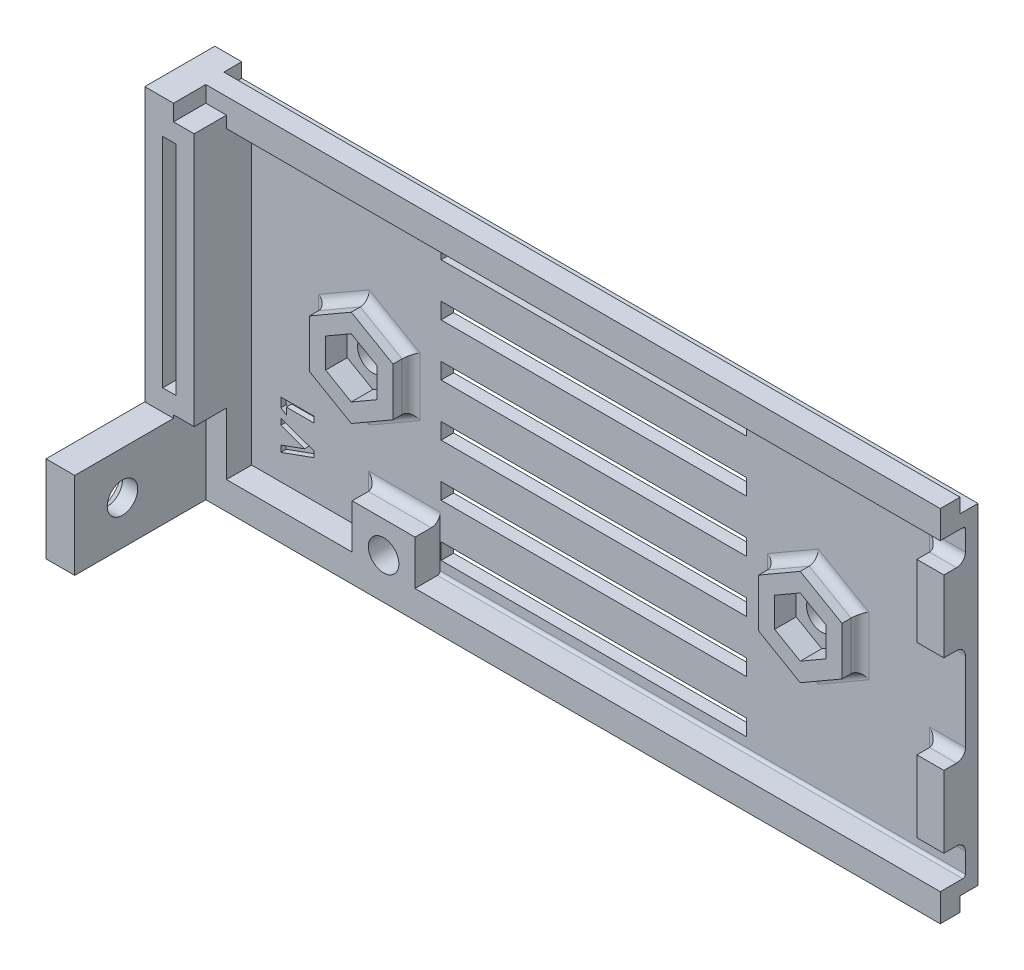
ISO-10303-21;
HEADER;
FILE_DESCRIPTION(('STEP AP214'),'2;1');
FILE_NAME('part.step','',(''),(''),'','','');
FILE_SCHEMA(('AUTOMOTIVE_DESIGN { 1 0 10303 214 1 1 1 1 }'));
ENDSEC;
DATA;
#1=APPLICATION_CONTEXT('core data for automotive mechanical design processes');
#2=APPLICATION_PROTOCOL_DEFINITION('international standard','automotive_design',2000,#1);
#3=PRODUCT_CONTEXT('',#1,'mechanical');
#4=PRODUCT('Part','Part','',(#3));
#5=PRODUCT_RELATED_PRODUCT_CATEGORY('part','',(#4));
#6=PRODUCT_DEFINITION_FORMATION('','',#4);
#7=PRODUCT_DEFINITION_CONTEXT('part definition',#1,'design');
#8=PRODUCT_DEFINITION('design','',#6,#7);
#9=PRODUCT_DEFINITION_SHAPE('','',#8);
#10=(LENGTH_UNIT() NAMED_UNIT(*) SI_UNIT(.MILLI.,.METRE.));
#11=(NAMED_UNIT(*) PLANE_ANGLE_UNIT() SI_UNIT($,.RADIAN.));
#12=(NAMED_UNIT(*) SI_UNIT($,.STERADIAN.) SOLID_ANGLE_UNIT());
#13=UNCERTAINTY_MEASURE_WITH_UNIT(LENGTH_MEASURE(1.E-05),#10,'distance_accuracy_value','');
#14=(GEOMETRIC_REPRESENTATION_CONTEXT(3) GLOBAL_UNCERTAINTY_ASSIGNED_CONTEXT((#13)) GLOBAL_UNIT_ASSIGNED_CONTEXT((#10,
#11,#12)) REPRESENTATION_CONTEXT('',''));
#15=CARTESIAN_POINT('',(0.,0.,0.));
#16=DIRECTION('',(0.,0.,1.));
#17=DIRECTION('',(1.,0.,0.));
#18=AXIS2_PLACEMENT_3D('',#15,#16,#17);
#19=CARTESIAN_POINT('',(0.,0.,1.4));
#20=DIRECTION('',(0.,0.,1.));
#21=DIRECTION('',(1.,0.,0.));
#22=AXIS2_PLACEMENT_3D('',#19,#20,#21);
#23=PLANE('',#22);
#24=DIRECTION('',(0.866025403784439,-0.5,0.));
#25=VECTOR('',#24,1.);
#26=CARTESIAN_POINT('',(45.5,-16.6507041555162,1.4));
#27=LINE('',#26,#25);
#28=CARTESIAN_POINT('',(50.65,-19.6240580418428,1.4));
#29=VERTEX_POINT('',#28);
#30=CARTESIAN_POINT('',(45.,-16.3620290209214,1.4));
#31=VERTEX_POINT('',#30);
#32=EDGE_CURVE('E1906',#29,#31,#27,.F.);
#33=ORIENTED_EDGE('',*,*,#32,.T.);
#34=DIRECTION('',(0.,-1.,0.));
#35=VECTOR('',#34,1.);
#36=CARTESIAN_POINT('',(45.,-10.4153212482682,1.4));
#37=LINE('',#36,#35);
#38=CARTESIAN_POINT('',(45.,-9.83797097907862,1.4));
#39=VERTEX_POINT('',#38);
#40=EDGE_CURVE('E1903',#31,#39,#37,.F.);
#41=ORIENTED_EDGE('',*,*,#40,.T.);
#42=DIRECTION('',(-0.866025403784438,-0.500000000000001,0.));
#43=VECTOR('',#42,1.);
#44=CARTESIAN_POINT('',(50.15,-6.86461709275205,1.4));
#45=LINE('',#44,#43);
#46=CARTESIAN_POINT('',(50.65,-6.57594195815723,1.4));
#47=VERTEX_POINT('',#46);
#48=EDGE_CURVE('E1912',#39,#47,#45,.F.);
#49=ORIENTED_EDGE('',*,*,#48,.T.);
#50=DIRECTION('',(-0.866025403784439,0.5,0.));
#51=VECTOR('',#50,1.);
#52=CARTESIAN_POINT('',(55.8,-9.54929584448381,1.4));
#53=LINE('',#52,#51);
#54=CARTESIAN_POINT('',(56.3,-9.83797097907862,1.4));
#55=VERTEX_POINT('',#54);
#56=EDGE_CURVE('E1914',#47,#55,#53,.F.);
#57=ORIENTED_EDGE('',*,*,#56,.T.);
#58=DIRECTION('',(0.,1.,0.));
#59=VECTOR('',#58,1.);
#60=CARTESIAN_POINT('',(56.3,-15.7846787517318,1.4));
#61=LINE('',#60,#59);
#62=CARTESIAN_POINT('',(56.3,-16.3620290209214,1.4));
#63=VERTEX_POINT('',#62);
#64=EDGE_CURVE('E1910',#55,#63,#61,.F.);
#65=ORIENTED_EDGE('',*,*,#64,.T.);
#66=DIRECTION('',(0.866025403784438,0.5,0.));
#67=VECTOR('',#66,1.);
#68=CARTESIAN_POINT('',(51.15,-19.335382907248,1.4));
#69=LINE('',#68,#67);
#70=EDGE_CURVE('E1908',#63,#29,#69,.F.);
#71=ORIENTED_EDGE('',*,*,#70,.T.);
#72=EDGE_LOOP('',(#33,#41,#49,#57,#65,#71));
#73=FACE_BOUND('',#72,.T.);
#74=DIRECTION('',(0.866025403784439,-0.5,0.));
#75=VECTOR('',#74,1.);
#76=CARTESIAN_POINT('',(-4.5,-16.6507041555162,1.4));
#77=LINE('',#76,#75);
#78=CARTESIAN_POINT('',(0.649999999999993,-19.6240580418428,1.4));
#79=VERTEX_POINT('',#78);
#80=CARTESIAN_POINT('',(-5.,-16.3620290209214,1.4));
#81=VERTEX_POINT('',#80);
#82=EDGE_CURVE('E1927',#79,#81,#77,.F.);
#83=ORIENTED_EDGE('',*,*,#82,.T.);
#84=DIRECTION('',(0.,-1.,0.));
#85=VECTOR('',#84,1.);
#86=CARTESIAN_POINT('',(-5.,-10.4153212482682,1.4));
#87=LINE('',#86,#85);
#88=CARTESIAN_POINT('',(-5.,-9.83797097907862,1.4));
#89=VERTEX_POINT('',#88);
#90=EDGE_CURVE('E1916',#81,#89,#87,.F.);
#91=ORIENTED_EDGE('',*,*,#90,.T.);
#92=DIRECTION('',(-0.866025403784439,-0.5,0.));
#93=VECTOR('',#92,1.);
#94=CARTESIAN_POINT('',(0.149999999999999,-6.86461709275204,1.4));
#95=LINE('',#94,#93);
#96=CARTESIAN_POINT('',(0.65,-6.57594195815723,1.4));
#97=VERTEX_POINT('',#96);
#98=EDGE_CURVE('E1919',#89,#97,#95,.F.);
#99=ORIENTED_EDGE('',*,*,#98,.T.);
#100=DIRECTION('',(-0.866025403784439,0.5,0.));
#101=VECTOR('',#100,1.);
#102=CARTESIAN_POINT('',(5.8,-9.5492958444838,1.4));
#103=LINE('',#102,#101);
#104=CARTESIAN_POINT('',(6.3,-9.83797097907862,1.4));
#105=VERTEX_POINT('',#104);
#106=EDGE_CURVE('E1921',#97,#105,#103,.F.);
#107=ORIENTED_EDGE('',*,*,#106,.T.);
#108=DIRECTION('',(0.,1.,0.));
#109=VECTOR('',#108,1.);
#110=CARTESIAN_POINT('',(6.3,-15.7846787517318,1.4));
#111=LINE('',#110,#109);
#112=CARTESIAN_POINT('',(6.3,-16.3620290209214,1.4));
#113=VERTEX_POINT('',#112);
#114=EDGE_CURVE('E1923',#105,#113,#111,.F.);
#115=ORIENTED_EDGE('',*,*,#114,.T.);
#116=DIRECTION('',(0.866025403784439,0.5,0.));
#117=VECTOR('',#116,1.);
#118=CARTESIAN_POINT('',(1.14999999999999,-19.335382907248,1.4));
#119=LINE('',#118,#117);
#120=EDGE_CURVE('E1925',#113,#79,#119,.F.);
#121=ORIENTED_EDGE('',*,*,#120,.T.);
#122=EDGE_LOOP('',(#83,#91,#99,#107,#115,#121));
#123=FACE_BOUND('',#122,.T.);
#124=DIRECTION('',(-1.,0.,0.));
#125=VECTOR('',#124,1.);
#126=CARTESIAN_POINT('',(0.,-5.475,1.4));
#127=LINE('',#126,#125);
#128=CARTESIAN_POINT('',(42.65,-5.475,1.4));
#129=VERTEX_POINT('',#128);
#130=CARTESIAN_POINT('',(8.65,-5.475,1.4));
#131=VERTEX_POINT('',#130);
#132=EDGE_CURVE('E1506',#129,#131,#127,.T.);
#133=ORIENTED_EDGE('',*,*,#132,.T.);
#134=DIRECTION('',(0.,1.,0.));
#135=VECTOR('',#134,1.);
#136=CARTESIAN_POINT('',(8.65,0.,1.4));
#137=LINE('',#136,#135);
#138=CARTESIAN_POINT('',(8.65,-3.675,1.4));
#139=VERTEX_POINT('',#138);
#140=EDGE_CURVE('E1509',#131,#139,#137,.T.);
#141=ORIENTED_EDGE('',*,*,#140,.T.);
#142=DIRECTION('',(1.,0.,0.));
#143=VECTOR('',#142,1.);
#144=CARTESIAN_POINT('',(0.,-3.675,1.4));
#145=LINE('',#144,#143);
#146=CARTESIAN_POINT('',(42.65,-3.675,1.4));
#147=VERTEX_POINT('',#146);
#148=EDGE_CURVE('E1500',#139,#147,#145,.T.);
#149=ORIENTED_EDGE('',*,*,#148,.T.);
#150=DIRECTION('',(0.,-1.,0.));
#151=VECTOR('',#150,1.);
#152=CARTESIAN_POINT('',(42.65,1.64413236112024E-13,1.4));
#153=LINE('',#152,#151);
#154=EDGE_CURVE('E1503',#147,#129,#153,.T.);
#155=ORIENTED_EDGE('',*,*,#154,.T.);
#156=EDGE_LOOP('',(#133,#141,#149,#155));
#157=FACE_BOUND('',#156,.T.);
#158=DIRECTION('',(1.,0.,0.));
#159=VECTOR('',#158,1.);
#160=CARTESIAN_POINT('',(0.,2.125,1.4));
#161=LINE('',#160,#159);
#162=CARTESIAN_POINT('',(8.65,2.125,1.4));
#163=VERTEX_POINT('',#162);
#164=CARTESIAN_POINT('',(42.65,2.125,1.4));
#165=VERTEX_POINT('',#164);
#166=EDGE_CURVE('E1425',#163,#165,#161,.T.);
#167=ORIENTED_EDGE('',*,*,#166,.T.);
#168=DIRECTION('',(0.,-1.,0.));
#169=VECTOR('',#168,1.);
#170=CARTESIAN_POINT('',(42.65,0.,1.4));
#171=LINE('',#170,#169);
#172=CARTESIAN_POINT('',(42.65,0.325000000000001,1.4));
#173=VERTEX_POINT('',#172);
#174=EDGE_CURVE('E1428',#165,#173,#171,.T.);
#175=ORIENTED_EDGE('',*,*,#174,.T.);
#176=DIRECTION('',(-1.,0.,0.));
#177=VECTOR('',#176,1.);
#178=CARTESIAN_POINT('',(0.,0.324999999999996,1.4));
#179=LINE('',#178,#177);
#180=CARTESIAN_POINT('',(8.65,0.324999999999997,1.4));
#181=VERTEX_POINT('',#180);
#182=EDGE_CURVE('E1400',#173,#181,#179,.T.);
#183=ORIENTED_EDGE('',*,*,#182,.T.);
#184=DIRECTION('',(0.,1.,0.));
#185=VECTOR('',#184,1.);
#186=CARTESIAN_POINT('',(8.65,0.,1.4));
#187=LINE('',#186,#185);
#188=EDGE_CURVE('E1422',#181,#163,#187,.T.);
#189=ORIENTED_EDGE('',*,*,#188,.T.);
#190=EDGE_LOOP('',(#167,#175,#183,#189));
#191=FACE_BOUND('',#190,.T.);
#192=DIRECTION('',(-1.,0.,0.));
#193=VECTOR('',#192,1.);
#194=CARTESIAN_POINT('',(0.,-22.875,1.4));
#195=LINE('',#194,#193);
#196=CARTESIAN_POINT('',(42.65,-22.875,1.4));
#197=VERTEX_POINT('',#196);
#198=CARTESIAN_POINT('',(8.65,-22.875,1.4));
#199=VERTEX_POINT('',#198);
#200=EDGE_CURVE('E1437',#197,#199,#195,.T.);
#201=ORIENTED_EDGE('',*,*,#200,.T.);
#202=DIRECTION('',(0.,1.,0.));
#203=VECTOR('',#202,1.);
#204=CARTESIAN_POINT('',(8.64999999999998,0.,1.4));
#205=LINE('',#204,#203);
#206=CARTESIAN_POINT('',(8.65,-21.075,1.4));
#207=VERTEX_POINT('',#206);
#208=EDGE_CURVE('E1440',#199,#207,#205,.T.);
#209=ORIENTED_EDGE('',*,*,#208,.T.);
#210=DIRECTION('',(1.,0.,0.));
#211=VECTOR('',#210,1.);
#212=CARTESIAN_POINT('',(0.,-21.075,1.4));
#213=LINE('',#212,#211);
#214=CARTESIAN_POINT('',(42.65,-21.075,1.4));
#215=VERTEX_POINT('',#214);
#216=EDGE_CURVE('E1431',#207,#215,#213,.T.);
#217=ORIENTED_EDGE('',*,*,#216,.T.);
#218=DIRECTION('',(0.,-1.,0.));
#219=VECTOR('',#218,1.);
#220=CARTESIAN_POINT('',(42.6500000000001,-1.64413236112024E-13,1.4));
#221=LINE('',#220,#219);
#222=EDGE_CURVE('E1434',#215,#197,#221,.T.);
#223=ORIENTED_EDGE('',*,*,#222,.T.);
#224=EDGE_LOOP('',(#201,#209,#217,#223));
#225=FACE_BOUND('',#224,.T.);
#226=DIRECTION('',(-1.,0.,0.));
#227=VECTOR('',#226,1.);
#228=CARTESIAN_POINT('',(0.,-11.275,1.4));
#229=LINE('',#228,#227);
#230=CARTESIAN_POINT('',(42.65,-11.275,1.4));
#231=VERTEX_POINT('',#230);
#232=CARTESIAN_POINT('',(8.65,-11.275,1.4));
#233=VERTEX_POINT('',#232);
#234=EDGE_CURVE('E1449',#231,#233,#229,.T.);
#235=ORIENTED_EDGE('',*,*,#234,.T.);
#236=DIRECTION('',(0.,1.,0.));
#237=VECTOR('',#236,1.);
#238=CARTESIAN_POINT('',(8.65,0.,1.4));
#239=LINE('',#238,#237);
#240=CARTESIAN_POINT('',(8.65,-9.475,1.4));
#241=VERTEX_POINT('',#240);
#242=EDGE_CURVE('E1452',#233,#241,#239,.T.);
#243=ORIENTED_EDGE('',*,*,#242,.T.);
#244=DIRECTION('',(1.,0.,0.));
#245=VECTOR('',#244,1.);
#246=CARTESIAN_POINT('',(0.,-9.475,1.4));
#247=LINE('',#246,#245);
#248=CARTESIAN_POINT('',(42.65,-9.475,1.4));
#249=VERTEX_POINT('',#248);
#250=EDGE_CURVE('E1443',#241,#249,#247,.T.);
#251=ORIENTED_EDGE('',*,*,#250,.T.);
#252=DIRECTION('',(0.,-1.,0.));
#253=VECTOR('',#252,1.);
#254=CARTESIAN_POINT('',(42.65,0.,1.4));
#255=LINE('',#254,#253);
#256=EDGE_CURVE('E1446',#249,#231,#255,.T.);
#257=ORIENTED_EDGE('',*,*,#256,.T.);
#258=EDGE_LOOP('',(#235,#243,#251,#257));
#259=FACE_BOUND('',#258,.T.);
#260=DIRECTION('',(-1.,0.,0.));
#261=VECTOR('',#260,1.);
#262=CARTESIAN_POINT('',(0.,-17.075,1.4));
#263=LINE('',#262,#261);
#264=CARTESIAN_POINT('',(42.65,-17.075,1.4));
#265=VERTEX_POINT('',#264);
#266=CARTESIAN_POINT('',(8.65,-17.075,1.4));
#267=VERTEX_POINT('',#266);
#268=EDGE_CURVE('E1461',#265,#267,#263,.T.);
#269=ORIENTED_EDGE('',*,*,#268,.T.);
#270=DIRECTION('',(0.,1.,0.));
#271=VECTOR('',#270,1.);
#272=CARTESIAN_POINT('',(8.65,0.,1.4));
#273=LINE('',#272,#271);
#274=CARTESIAN_POINT('',(8.65,-15.275,1.4));
#275=VERTEX_POINT('',#274);
#276=EDGE_CURVE('E1464',#267,#275,#273,.T.);
#277=ORIENTED_EDGE('',*,*,#276,.T.);
#278=DIRECTION('',(1.,0.,0.));
#279=VECTOR('',#278,1.);
#280=CARTESIAN_POINT('',(0.,-15.275,1.4));
#281=LINE('',#280,#279);
#282=CARTESIAN_POINT('',(42.65,-15.275,1.4));
#283=VERTEX_POINT('',#282);
#284=EDGE_CURVE('E1455',#275,#283,#281,.T.);
#285=ORIENTED_EDGE('',*,*,#284,.T.);
#286=DIRECTION('',(0.,-1.,0.));
#287=VECTOR('',#286,1.);
#288=CARTESIAN_POINT('',(42.65,0.,1.4));
#289=LINE('',#288,#287);
#290=EDGE_CURVE('E1458',#283,#265,#289,.T.);
#291=ORIENTED_EDGE('',*,*,#290,.T.);
#292=EDGE_LOOP('',(#269,#277,#285,#291));
#293=FACE_BOUND('',#292,.T.);
#294=DIRECTION('',(1.,0.,0.));
#295=VECTOR('',#294,1.);
#296=CARTESIAN_POINT('',(0.,-26.875,1.4));
#297=LINE('',#296,#295);
#298=CARTESIAN_POINT('',(8.65000000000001,-26.875,1.4));
#299=VERTEX_POINT('',#298);
#300=CARTESIAN_POINT('',(42.65,-26.875,1.4));
#301=VERTEX_POINT('',#300);
#302=EDGE_CURVE('E1473',#299,#301,#297,.T.);
#303=ORIENTED_EDGE('',*,*,#302,.T.);
#304=DIRECTION('',(0.,-1.,0.));
#305=VECTOR('',#304,1.);
#306=CARTESIAN_POINT('',(42.6499999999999,1.64413236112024E-13,1.4));
#307=LINE('',#306,#305);
#308=CARTESIAN_POINT('',(42.65,-28.675,1.4));
#309=VERTEX_POINT('',#308);
#310=EDGE_CURVE('E1476',#301,#309,#307,.T.);
#311=ORIENTED_EDGE('',*,*,#310,.T.);
#312=DIRECTION('',(-1.,0.,0.));
#313=VECTOR('',#312,1.);
#314=CARTESIAN_POINT('',(0.,-28.675,1.4));
#315=LINE('',#314,#313);
#316=CARTESIAN_POINT('',(8.65,-28.675,1.4));
#317=VERTEX_POINT('',#316);
#318=EDGE_CURVE('E1467',#309,#317,#315,.T.);
#319=ORIENTED_EDGE('',*,*,#318,.T.);
#320=DIRECTION('',(0.,1.,0.));
#321=VECTOR('',#320,1.);
#322=CARTESIAN_POINT('',(8.65000000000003,0.,1.4));
#323=LINE('',#322,#321);
#324=EDGE_CURVE('E1470',#317,#299,#323,.T.);
#325=ORIENTED_EDGE('',*,*,#324,.T.);
#326=EDGE_LOOP('',(#303,#311,#319,#325));
#327=FACE_BOUND('',#326,.T.);
#328=DIRECTION('',(0.,-1.,0.));
#329=VECTOR('',#328,1.);
#330=CARTESIAN_POINT('',(63.05,0.,1.4));
#331=LINE('',#330,#329);
#332=CARTESIAN_POINT('',(63.05,-8.675,1.4));
#333=VERTEX_POINT('',#332);
#334=CARTESIAN_POINT('',(63.05,1.325,1.4));
#335=VERTEX_POINT('',#334);
#336=EDGE_CURVE('E1828',#333,#335,#331,.F.);
#337=ORIENTED_EDGE('',*,*,#336,.T.);
#338=DIRECTION('',(-1.,0.,0.));
#339=VECTOR('',#338,1.);
#340=CARTESIAN_POINT('',(0.,1.325,1.4));
#341=LINE('',#340,#339);
#342=CARTESIAN_POINT('',(67.05,1.325,1.4));
#343=VERTEX_POINT('',#342);
#344=EDGE_CURVE('E1824',#335,#343,#341,.F.);
#345=ORIENTED_EDGE('',*,*,#344,.T.);
#346=DIRECTION('',(0.,1.,0.));
#347=VECTOR('',#346,1.);
#348=CARTESIAN_POINT('',(67.05,6.925,1.4));
#349=LINE('',#348,#347);
#350=CARTESIAN_POINT('',(67.05,3.525,1.4));
#351=VERTEX_POINT('',#350);
#352=EDGE_CURVE('E1529',#343,#351,#349,.T.);
#353=ORIENTED_EDGE('',*,*,#352,.T.);
#354=DIRECTION('',(1.,0.,0.));
#355=VECTOR('',#354,1.);
#356=CARTESIAN_POINT('',(0.,3.525,1.4));
#357=LINE('',#356,#355);
#358=CARTESIAN_POINT('',(-12.45,3.525,1.4));
#359=VERTEX_POINT('',#358);
#360=EDGE_CURVE('E1953',#351,#359,#357,.F.);
#361=ORIENTED_EDGE('',*,*,#360,.T.);
#362=DIRECTION('',(0.,1.,0.));
#363=VECTOR('',#362,1.);
#364=CARTESIAN_POINT('',(-12.45,-33.125,1.4));
#365=LINE('',#364,#363);
#366=CARTESIAN_POINT('',(-12.45,-30.025,1.4));
#367=VERTEX_POINT('',#366);
#368=EDGE_CURVE('E1241',#367,#359,#365,.T.);
#369=ORIENTED_EDGE('',*,*,#368,.F.);
#370=DIRECTION('',(-1.,0.,0.));
#371=VECTOR('',#370,1.);
#372=CARTESIAN_POINT('',(-17.95,-30.025,1.4));
#373=LINE('',#372,#371);
#374=CARTESIAN_POINT('',(0.550000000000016,-30.025,1.4));
#375=VERTEX_POINT('',#374);
#376=EDGE_CURVE('E1301',#375,#367,#373,.T.);
#377=ORIENTED_EDGE('',*,*,#376,.F.);
#378=DIRECTION('',(0.,-1.,0.));
#379=VECTOR('',#378,1.);
#380=CARTESIAN_POINT('',(0.550000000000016,0.,1.4));
#381=LINE('',#380,#379);
#382=CARTESIAN_POINT('',(0.550000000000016,-24.075,1.4));
#383=VERTEX_POINT('',#382);
#384=EDGE_CURVE('E1929',#375,#383,#381,.F.);
#385=ORIENTED_EDGE('',*,*,#384,.T.);
#386=DIRECTION('',(-1.,0.,0.));
#387=VECTOR('',#386,1.);
#388=CARTESIAN_POINT('',(0.,-24.075,1.4));
#389=LINE('',#388,#387);
#390=CARTESIAN_POINT('',(8.55000000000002,-24.075,1.4));
#391=VERTEX_POINT('',#390);
#392=EDGE_CURVE('E1931',#383,#391,#389,.F.);
#393=ORIENTED_EDGE('',*,*,#392,.T.);
#394=DIRECTION('',(0.,1.,0.));
#395=VECTOR('',#394,1.);
#396=CARTESIAN_POINT('',(8.55000000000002,-30.525,1.4));
#397=LINE('',#396,#395);
#398=CARTESIAN_POINT('',(8.55000000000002,-29.725,1.4));
#399=VERTEX_POINT('',#398);
#400=EDGE_CURVE('E1212',#399,#391,#397,.T.);
#401=ORIENTED_EDGE('',*,*,#400,.F.);
#402=DIRECTION('',(-1.,0.,0.));
#403=VECTOR('',#402,1.);
#404=CARTESIAN_POINT('',(0.,-29.725,1.4));
#405=LINE('',#404,#403);
#406=CARTESIAN_POINT('',(67.05,-29.725,1.4));
#407=VERTEX_POINT('',#406);
#408=EDGE_CURVE('E1954',#399,#407,#405,.F.);
#409=ORIENTED_EDGE('',*,*,#408,.T.);
#410=CARTESIAN_POINT('',(67.05,-27.525,1.4));
#411=VERTEX_POINT('',#410);
#412=EDGE_CURVE('E1524',#407,#411,#349,.T.);
#413=ORIENTED_EDGE('',*,*,#412,.T.);
#414=DIRECTION('',(1.,0.,0.));
#415=VECTOR('',#414,1.);
#416=CARTESIAN_POINT('',(0.,-27.525,1.4));
#417=LINE('',#416,#415);
#418=CARTESIAN_POINT('',(63.05,-27.525,1.4));
#419=VERTEX_POINT('',#418);
#420=EDGE_CURVE('E1833',#411,#419,#417,.F.);
#421=ORIENTED_EDGE('',*,*,#420,.T.);
#422=DIRECTION('',(0.,-1.,0.));
#423=VECTOR('',#422,1.);
#424=CARTESIAN_POINT('',(63.05,0.,1.4));
#425=LINE('',#424,#423);
#426=CARTESIAN_POINT('',(63.05,-17.525,1.4));
#427=VERTEX_POINT('',#426);
#428=EDGE_CURVE('E1801',#419,#427,#425,.F.);
#429=ORIENTED_EDGE('',*,*,#428,.T.);
#430=DIRECTION('',(-1.,0.,0.));
#431=VECTOR('',#430,1.);
#432=CARTESIAN_POINT('',(0.,-17.525,1.4));
#433=LINE('',#432,#431);
#434=CARTESIAN_POINT('',(67.05,-17.525,1.4));
#435=VERTEX_POINT('',#434);
#436=EDGE_CURVE('E1830',#427,#435,#433,.F.);
#437=ORIENTED_EDGE('',*,*,#436,.T.);
#438=CARTESIAN_POINT('',(67.05,-8.675,1.4));
#439=VERTEX_POINT('',#438);
#440=EDGE_CURVE('E1528',#435,#439,#349,.T.);
#441=ORIENTED_EDGE('',*,*,#440,.T.);
#442=DIRECTION('',(1.,0.,0.));
#443=VECTOR('',#442,1.);
#444=CARTESIAN_POINT('',(0.,-8.675,1.4));
#445=LINE('',#444,#443);
#446=EDGE_CURVE('E1826',#439,#333,#445,.F.);
#447=ORIENTED_EDGE('',*,*,#446,.T.);
#448=EDGE_LOOP('',(#337,#345,#353,#361,#369,#377,#385,#393,#401,#409,#413,#421,#429,#437,#441,#447));
#449=FACE_BOUND('',#448,.T.);
#450=DIRECTION('',(0.,-1.,0.));
#451=VECTOR('',#450,1.);
#452=CARTESIAN_POINT('',(-5.49308165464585,-25.1971693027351,1.4));
#453=LINE('',#452,#451);
#454=CARTESIAN_POINT('',(-5.49308165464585,-25.1971693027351,1.4));
#455=VERTEX_POINT('',#454);
#456=CARTESIAN_POINT('',(-5.49308165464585,-25.8375330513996,1.4));
#457=VERTEX_POINT('',#456);
#458=EDGE_CURVE('E839',#455,#457,#453,.T.);
#459=ORIENTED_EDGE('',*,*,#458,.T.);
#460=DIRECTION('',(-0.940292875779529,-0.340366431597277,0.));
#461=VECTOR('',#460,1.);
#462=CARTESIAN_POINT('',(-5.49308165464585,-25.8375330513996,1.4));
#463=LINE('',#462,#461);
#464=CARTESIAN_POINT('',(-9.19724832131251,-27.178364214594,1.4));
#465=VERTEX_POINT('',#464);
#466=EDGE_CURVE('E130',#457,#465,#463,.T.);
#467=ORIENTED_EDGE('',*,*,#466,.T.);
#468=DIRECTION('',(0.,1.,0.));
#469=VECTOR('',#468,1.);
#470=CARTESIAN_POINT('',(-9.19724832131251,-27.178364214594,1.4));
#471=LINE('',#470,#469);
#472=CARTESIAN_POINT('',(-9.19724832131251,-26.468250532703,1.4));
#473=VERTEX_POINT('',#472);
#474=EDGE_CURVE('E829',#465,#473,#471,.T.);
#475=ORIENTED_EDGE('',*,*,#474,.T.);
#476=DIRECTION('',(0.940341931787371,0.340230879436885,0.));
#477=VECTOR('',#476,1.);
#478=CARTESIAN_POINT('',(-9.19724832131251,-26.468250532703,1.4));
#479=LINE('',#478,#477);
#480=CARTESIAN_POINT('',(-6.5660433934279,-25.516238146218,1.4));
#481=VERTEX_POINT('',#480);
#482=EDGE_CURVE('E854',#473,#481,#479,.T.);
#483=ORIENTED_EDGE('',*,*,#482,.T.);
#484=DIRECTION('',(-0.940087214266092,0.340934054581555,0.));
#485=VECTOR('',#484,1.);
#486=CARTESIAN_POINT('',(-6.5660433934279,-25.516238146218,1.4));
#487=LINE('',#486,#485);
#488=CARTESIAN_POINT('',(-9.19724832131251,-24.5619996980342,1.4));
#489=VERTEX_POINT('',#488);
#490=EDGE_CURVE('E857',#481,#489,#487,.T.);
#491=ORIENTED_EDGE('',*,*,#490,.T.);
#492=DIRECTION('',(0.,1.,0.));
#493=VECTOR('',#492,1.);
#494=CARTESIAN_POINT('',(-9.19724832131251,-24.5619996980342,1.4));
#495=LINE('',#494,#493);
#496=CARTESIAN_POINT('',(-9.19724832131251,-23.8541120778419,1.4));
#497=VERTEX_POINT('',#496);
#498=EDGE_CURVE('E860',#489,#497,#495,.T.);
#499=ORIENTED_EDGE('',*,*,#498,.T.);
#500=DIRECTION('',(0.940111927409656,-0.340865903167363,0.));
#501=VECTOR('',#500,1.);
#502=CARTESIAN_POINT('',(-9.19724832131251,-23.8541120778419,1.4));
#503=LINE('',#502,#501);
#504=EDGE_CURVE('E863',#497,#455,#503,.T.);
#505=ORIENTED_EDGE('',*,*,#504,.T.);
#506=EDGE_LOOP('',(#459,#467,#475,#483,#491,#499,#505));
#507=FACE_BOUND('',#506,.T.);
#508=DIRECTION('',(0.,-1.,0.));
#509=VECTOR('',#508,1.);
#510=CARTESIAN_POINT('',(-8.5798872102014,-22.5006665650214,1.4));
#511=LINE('',#510,#509);
#512=CARTESIAN_POINT('',(-8.5798872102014,-22.5006665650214,1.4));
#513=VERTEX_POINT('',#512);
#514=CARTESIAN_POINT('',(-8.5798872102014,-23.2604956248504,1.4));
#515=VERTEX_POINT('',#514);
#516=EDGE_CURVE('E822',#513,#515,#511,.T.);
#517=ORIENTED_EDGE('',*,*,#516,.T.);
#518=DIRECTION('',(-0.84111277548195,0.540859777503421,0.));
#519=VECTOR('',#518,1.);
#520=CARTESIAN_POINT('',(-8.5798872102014,-23.2604956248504,1.4));
#521=LINE('',#520,#519);
#522=CARTESIAN_POINT('',(-9.19724832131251,-22.8635146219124,1.4));
#523=VERTEX_POINT('',#522);
#524=EDGE_CURVE('E122',#515,#523,#521,.T.);
#525=ORIENTED_EDGE('',*,*,#524,.T.);
#526=DIRECTION('',(0.,1.,0.));
#527=VECTOR('',#526,1.);
#528=CARTESIAN_POINT('',(-9.19724832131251,-22.8635146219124,1.4));
#529=LINE('',#528,#527);
#530=CARTESIAN_POINT('',(-9.19724832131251,-21.835816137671,1.4));
#531=VERTEX_POINT('',#530);
#532=EDGE_CURVE('E826',#523,#531,#529,.T.);
#533=ORIENTED_EDGE('',*,*,#532,.T.);
#534=DIRECTION('',(1.,0.,0.));
#535=VECTOR('',#534,1.);
#536=CARTESIAN_POINT('',(-9.19724832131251,-21.835816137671,1.4));
#537=LINE('',#536,#535);
#538=CARTESIAN_POINT('',(-5.49308165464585,-21.835816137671,1.4));
#539=VERTEX_POINT('',#538);
#540=EDGE_CURVE('E3295',#531,#539,#537,.T.);
#541=ORIENTED_EDGE('',*,*,#540,.T.);
#542=DIRECTION('',(0.,-1.,0.));
#543=VECTOR('',#542,1.);
#544=CARTESIAN_POINT('',(-5.49308165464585,-21.835816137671,1.4));
#545=LINE('',#544,#543);
#546=CARTESIAN_POINT('',(-5.49308165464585,-22.5006665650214,1.4));
#547=VERTEX_POINT('',#546);
#548=EDGE_CURVE('E3292',#539,#547,#545,.T.);
#549=ORIENTED_EDGE('',*,*,#548,.T.);
#550=DIRECTION('',(-1.,0.,0.));
#551=VECTOR('',#550,1.);
#552=CARTESIAN_POINT('',(-5.49308165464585,-22.5006665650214,1.4));
#553=LINE('',#552,#551);
#554=EDGE_CURVE('E3286',#547,#513,#553,.T.);
#555=ORIENTED_EDGE('',*,*,#554,.T.);
#556=EDGE_LOOP('',(#517,#525,#533,#541,#549,#555));
#557=FACE_BOUND('',#556,.T.);
#558=ADVANCED_FACE('F105',(#73,#123,#157,#191,#225,#259,#293,#327,#449,#507,#557),#23,.T.);
#559=CARTESIAN_POINT('',(0.,0.,7.8));
#560=DIRECTION('',(0.,0.,-1.));
#561=DIRECTION('',(-1.,0.,0.));
#562=AXIS2_PLACEMENT_3D('',#559,#560,#561);
#563=PLANE('',#562);
#564=DIRECTION('',(1.,0.,0.));
#565=VECTOR('',#564,1.);
#566=CARTESIAN_POINT('',(-15.95,-21.125,7.8));
#567=LINE('',#566,#565);
#568=CARTESIAN_POINT('',(-15.95,-21.125,7.8));
#569=VERTEX_POINT('',#568);
#570=CARTESIAN_POINT('',(-14.45,-21.125,7.8));
#571=VERTEX_POINT('',#570);
#572=EDGE_CURVE('E1169',#569,#571,#567,.T.);
#573=ORIENTED_EDGE('',*,*,#572,.F.);
#574=DIRECTION('',(0.,-1.,0.));
#575=VECTOR('',#574,1.);
#576=CARTESIAN_POINT('',(-15.95,3.125,7.8));
#577=LINE('',#576,#575);
#578=CARTESIAN_POINT('',(-15.95,3.125,7.8));
#579=VERTEX_POINT('',#578);
#580=EDGE_CURVE('E1159',#579,#569,#577,.T.);
#581=ORIENTED_EDGE('',*,*,#580,.F.);
#582=DIRECTION('',(-1.,0.,0.));
#583=VECTOR('',#582,1.);
#584=CARTESIAN_POINT('',(-15.95,3.125,7.8));
#585=LINE('',#584,#583);
#586=CARTESIAN_POINT('',(-14.45,3.125,7.8));
#587=VERTEX_POINT('',#586);
#588=EDGE_CURVE('E1175',#587,#579,#585,.T.);
#589=ORIENTED_EDGE('',*,*,#588,.F.);
#590=DIRECTION('',(0.,1.,0.));
#591=VECTOR('',#590,1.);
#592=CARTESIAN_POINT('',(-14.45,3.125,7.8));
#593=LINE('',#592,#591);
#594=EDGE_CURVE('E1172',#571,#587,#593,.T.);
#595=ORIENTED_EDGE('',*,*,#594,.F.);
#596=EDGE_LOOP('',(#573,#581,#589,#595));
#597=FACE_BOUND('',#596,.T.);
#598=DIRECTION('',(-1.,0.,0.));
#599=VECTOR('',#598,1.);
#600=CARTESIAN_POINT('',(-14.75,-23.475,7.8));
#601=LINE('',#600,#599);
#602=CARTESIAN_POINT('',(-14.75,-23.475,7.8));
#603=VERTEX_POINT('',#602);
#604=CARTESIAN_POINT('',(-17.95,-23.475,7.8));
#605=VERTEX_POINT('',#604);
#606=EDGE_CURVE('E891',#603,#605,#601,.T.);
#607=ORIENTED_EDGE('',*,*,#606,.F.);
#608=DIRECTION('',(0.,-1.,0.));
#609=VECTOR('',#608,1.);
#610=CARTESIAN_POINT('',(-14.75,-33.125,7.8));
#611=LINE('',#610,#609);
#612=CARTESIAN_POINT('',(-14.75,-23.125,7.8));
#613=VERTEX_POINT('',#612);
#614=EDGE_CURVE('E1196',#613,#603,#611,.T.);
#615=ORIENTED_EDGE('',*,*,#614,.F.);
#616=DIRECTION('',(-1.,0.,0.));
#617=VECTOR('',#616,1.);
#618=CARTESIAN_POINT('',(-12.45,-23.125,7.8));
#619=LINE('',#618,#617);
#620=CARTESIAN_POINT('',(-12.45,-23.125,7.8));
#621=VERTEX_POINT('',#620);
#622=EDGE_CURVE('E1187',#621,#613,#619,.T.);
#623=ORIENTED_EDGE('',*,*,#622,.F.);
#624=DIRECTION('',(0.,-1.,0.));
#625=VECTOR('',#624,1.);
#626=CARTESIAN_POINT('',(-12.45,-33.125,7.8));
#627=LINE('',#626,#625);
#628=CARTESIAN_POINT('',(-12.45,5.125,7.8));
#629=VERTEX_POINT('',#628);
#630=EDGE_CURVE('E1242',#629,#621,#627,.T.);
#631=ORIENTED_EDGE('',*,*,#630,.F.);
#632=DIRECTION('',(1.,0.,0.));
#633=VECTOR('',#632,1.);
#634=CARTESIAN_POINT('',(-12.45,5.125,7.8));
#635=LINE('',#634,#633);
#636=CARTESIAN_POINT('',(-14.75,5.125,7.8));
#637=VERTEX_POINT('',#636);
#638=EDGE_CURVE('E1215',#637,#629,#635,.T.);
#639=ORIENTED_EDGE('',*,*,#638,.F.);
#640=DIRECTION('',(0.,-1.,0.));
#641=VECTOR('',#640,1.);
#642=CARTESIAN_POINT('',(-14.75,5.125,7.8));
#643=LINE('',#642,#641);
#644=CARTESIAN_POINT('',(-14.75,6.925,7.8));
#645=VERTEX_POINT('',#644);
#646=EDGE_CURVE('E1205',#645,#637,#643,.T.);
#647=ORIENTED_EDGE('',*,*,#646,.F.);
#648=DIRECTION('',(-1.,0.,0.));
#649=VECTOR('',#648,1.);
#650=CARTESIAN_POINT('',(-15.75,6.925,7.8));
#651=LINE('',#650,#649);
#652=CARTESIAN_POINT('',(-17.95,6.925,7.8));
#653=VERTEX_POINT('',#652);
#654=EDGE_CURVE('E1513',#645,#653,#651,.T.);
#655=ORIENTED_EDGE('',*,*,#654,.T.);
#656=DIRECTION('',(0.,-1.,0.));
#657=VECTOR('',#656,1.);
#658=CARTESIAN_POINT('',(-17.95,6.925,7.8));
#659=LINE('',#658,#657);
#660=EDGE_CURVE('E1515',#653,#605,#659,.T.);
#661=ORIENTED_EDGE('',*,*,#660,.T.);
#662=EDGE_LOOP('',(#607,#615,#623,#631,#639,#647,#655,#661));
#663=FACE_BOUND('',#662,.T.);
#664=ADVANCED_FACE('F1556',(#597,#663),#563,.F.);
#665=CARTESIAN_POINT('',(-17.95,-31.525,2.));
#666=DIRECTION('',(0.,-1.,0.));
#667=DIRECTION('',(0.,0.,-1.));
#668=AXIS2_PLACEMENT_3D('',#665,#666,#667);
#669=PLANE('',#668);
#670=DIRECTION('',(-1.,0.,0.));
#671=VECTOR('',#670,1.);
#672=CARTESIAN_POINT('',(-17.95,-31.525,2.));
#673=LINE('',#672,#671);
#674=CARTESIAN_POINT('',(67.05,-31.525,2.));
#675=VERTEX_POINT('',#674);
#676=CARTESIAN_POINT('',(-14.95,-31.525,2.));
#677=VERTEX_POINT('',#676);
#678=EDGE_CURVE('E1283',#675,#677,#673,.T.);
#679=ORIENTED_EDGE('',*,*,#678,.T.);
#680=DIRECTION('',(0.,0.,-1.));
#681=VECTOR('',#680,1.);
#682=CARTESIAN_POINT('',(-14.95,-31.525,0.));
#683=LINE('',#682,#681);
#684=CARTESIAN_POINT('',(-14.95,-31.525,0.));
#685=VERTEX_POINT('',#684);
#686=EDGE_CURVE('E916',#677,#685,#683,.T.);
#687=ORIENTED_EDGE('',*,*,#686,.T.);
#688=DIRECTION('',(-1.,0.,0.));
#689=VECTOR('',#688,1.);
#690=CARTESIAN_POINT('',(-17.95,-31.525,0.));
#691=LINE('',#690,#689);
#692=CARTESIAN_POINT('',(4.50456439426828,-31.525,0.));
#693=VERTEX_POINT('',#692);
#694=EDGE_CURVE('E1276',#693,#685,#691,.T.);
#695=ORIENTED_EDGE('',*,*,#694,.F.);
#696=CARTESIAN_POINT('',(0.715124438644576,-31.525,-2.24343838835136));
#697=CARTESIAN_POINT('',(0.80068843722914,-31.525,-2.17270619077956));
#698=CARTESIAN_POINT('',(0.886572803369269,-31.525,-2.10236017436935));
#699=CARTESIAN_POINT('',(1.05909435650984,-31.525,-1.96258612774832));
#700=CARTESIAN_POINT('',(1.14573159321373,-31.525,-1.89315815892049));
#701=CARTESIAN_POINT('',(1.40730990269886,-31.525,-1.68617819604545));
#702=CARTESIAN_POINT('',(1.5835388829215,-31.525,-1.55024532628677));
#703=CARTESIAN_POINT('',(1.94741052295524,-31.525,-1.27938648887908));
#704=CARTESIAN_POINT('',(2.13523199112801,-31.525,-1.14469753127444));
#705=CARTESIAN_POINT('',(2.42198052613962,-31.525,-0.950204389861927));
#706=CARTESIAN_POINT('',(2.5183603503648,-31.525,-0.886653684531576));
#707=CARTESIAN_POINT('',(2.71311334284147,-31.525,-0.762695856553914));
#708=CARTESIAN_POINT('',(2.81148636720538,-31.525,-0.702288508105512));
#709=CARTESIAN_POINT('',(3.02294926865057,-31.525,-0.57816072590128));
#710=CARTESIAN_POINT('',(3.13635026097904,-31.525,-0.514959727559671));
#711=CARTESIAN_POINT('',(3.36653181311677,-31.525,-0.395124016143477));
#712=CARTESIAN_POINT('',(3.48331324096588,-31.525,-0.33849100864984));
#713=CARTESIAN_POINT('',(3.83717259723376,-31.525,-0.182630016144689));
#714=CARTESIAN_POINT('',(4.08040178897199,-31.525,-0.0957860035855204));
#715=CARTESIAN_POINT('',(4.39959256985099,-31.525,-0.0200895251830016));
#716=CARTESIAN_POINT('',(4.46966253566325,-31.525,-0.00573781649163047));
#717=CARTESIAN_POINT('',(4.61059049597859,-31.525,0.0182605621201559));
#718=CARTESIAN_POINT('',(4.68144815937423,-31.525,0.02790913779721));
#719=CARTESIAN_POINT('',(4.82563146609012,-31.525,0.0423732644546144));
#720=CARTESIAN_POINT('',(4.89897132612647,-31.525,0.0470483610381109));
#721=CARTESIAN_POINT('',(5.04579590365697,-31.525,0.0509098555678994));
#722=CARTESIAN_POINT('',(5.1192806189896,-31.525,0.0500963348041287));
#723=CARTESIAN_POINT('',(5.26594781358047,-31.525,0.0430131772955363));
#724=CARTESIAN_POINT('',(5.33913042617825,-31.525,0.0367462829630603));
#725=CARTESIAN_POINT('',(5.48485904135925,-31.525,0.0189992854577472));
#726=CARTESIAN_POINT('',(5.55740495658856,-31.525,0.00751847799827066));
#727=CARTESIAN_POINT('',(5.74385761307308,-31.525,-0.0284256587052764));
#728=CARTESIAN_POINT('',(5.85706559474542,-31.525,-0.0565540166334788));
#729=CARTESIAN_POINT('',(6.08045882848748,-31.525,-0.122968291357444));
#730=CARTESIAN_POINT('',(6.19064198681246,-31.525,-0.161261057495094));
#731=CARTESIAN_POINT('',(6.40920960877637,-31.525,-0.246488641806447));
#732=CARTESIAN_POINT('',(6.51755282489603,-31.525,-0.293528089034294));
#733=CARTESIAN_POINT('',(6.6777179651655,-31.525,-0.368939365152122));
#734=CARTESIAN_POINT('',(6.73070844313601,-31.525,-0.394881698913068));
#735=CARTESIAN_POINT('',(6.83596125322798,-31.525,-0.448202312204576));
#736=CARTESIAN_POINT('',(6.88822360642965,-31.525,-0.475580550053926));
#737=CARTESIAN_POINT('',(7.04020583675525,-31.525,-0.557570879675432));
#738=CARTESIAN_POINT('',(7.13900126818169,-31.525,-0.613898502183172));
#739=CARTESIAN_POINT('',(7.33439645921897,-31.525,-0.730256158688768));
#740=CARTESIAN_POINT('',(7.43099573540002,-31.525,-0.790286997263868));
#741=CARTESIAN_POINT('',(7.62236864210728,-31.525,-0.913336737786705));
#742=CARTESIAN_POINT('',(7.71714083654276,-31.525,-0.97635786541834));
#743=CARTESIAN_POINT('',(7.90506434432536,-31.525,-1.10477757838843));
#744=CARTESIAN_POINT('',(7.99821553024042,-31.525,-1.17017634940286));
#745=CARTESIAN_POINT('',(8.27631813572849,-31.525,-1.3697634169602));
#746=CARTESIAN_POINT('',(8.45918189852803,-31.525,-1.50685881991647));
#747=CARTESIAN_POINT('',(8.82084841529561,-31.525,-1.78630185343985));
#748=CARTESIAN_POINT('',(8.99965060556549,-31.525,-1.92865020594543));
#749=CARTESIAN_POINT('',(9.33767352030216,-31.525,-2.20364531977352));
#750=CARTESIAN_POINT('',(9.49716576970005,-31.525,-2.3359593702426));
#751=CARTESIAN_POINT('',(9.81420399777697,-31.525,-2.60293147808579));
#752=CARTESIAN_POINT('',(9.97174973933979,-31.525,-2.73758981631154));
#753=CARTESIAN_POINT('',(10.2838417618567,-31.525,-3.0074533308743));
#754=CARTESIAN_POINT('',(10.43840230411,-31.525,-3.14264205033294));
#755=CARTESIAN_POINT('',(10.7462464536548,-31.525,-3.41440529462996));
#756=CARTESIAN_POINT('',(10.8995303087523,-31.525,-3.55097953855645));
#757=CARTESIAN_POINT('',(11.052331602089,-31.525,-3.68808527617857));
#758=B_SPLINE_CURVE_WITH_KNOTS('',3,(#696,#697,#698,#699,#700,#701,#702,#703,#704,#705,#706,
#707,#708,#709,#710,#711,#712,#713,#714,#715,#716,#717,#718,#719,#720,#721,#722,#723,#724,#725,
#726,#727,#728,#729,#730,#731,#732,#733,#734,#735,#736,#737,#738,#739,#740,#741,#742,#743,#744,
#745,#746,#747,#748,#749,#750,#751,#752,#753,#754,#755,#756,#757),.UNSPECIFIED.,.F.,.F.,(4,2,2,
2,2,2,2,2,2,2,2,2,2,2,2,2,2,2,2,2,2,2,2,2,2,2,2,2,2,2,4),(0.,0.333043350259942,
0.666108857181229,1.33371757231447,2.02683993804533,2.37312754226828,2.71939023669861,
3.10863205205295,3.49797472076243,4.26736983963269,4.48181703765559,4.69617726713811,
4.91644237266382,5.13670421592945,5.35685535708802,5.57703624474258,5.9263651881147,
6.2759301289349,6.62998249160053,6.80696572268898,6.98394381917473,7.32500571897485,
7.66614198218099,8.0075362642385,8.34895726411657,9.03444071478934,9.72001872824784,
10.3416834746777,10.9634232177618,11.5794371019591,12.1953284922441),.UNSPECIFIED.);
#759=CARTESIAN_POINT('',(5.59543560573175,-31.525,0.));
#760=VERTEX_POINT('',#759);
#761=EDGE_CURVE('E1537',#760,#693,#758,.F.);
#762=ORIENTED_EDGE('',*,*,#761,.F.);
#763=CARTESIAN_POINT('',(67.05,-31.525,0.));
#764=VERTEX_POINT('',#763);
#765=EDGE_CURVE('E1280',#764,#760,#691,.T.);
#766=ORIENTED_EDGE('',*,*,#765,.F.);
#767=DIRECTION('',(0.,0.,-1.));
#768=VECTOR('',#767,1.);
#769=CARTESIAN_POINT('',(67.05,-31.525,2.));
#770=LINE('',#769,#768);
#771=EDGE_CURVE('E1286',#675,#764,#770,.T.);
#772=ORIENTED_EDGE('',*,*,#771,.F.);
#773=EDGE_LOOP('',(#679,#687,#695,#762,#766,#772));
#774=FACE_BOUND('',#773,.T.);
#775=ADVANCED_FACE('F1550',(#774),#669,.T.);
#776=CARTESIAN_POINT('',(0.,0.,2.));
#777=DIRECTION('',(0.,0.,-1.));
#778=DIRECTION('',(-1.,0.,0.));
#779=AXIS2_PLACEMENT_3D('',#776,#777,#778);
#780=PLANE('',#779);
#781=DIRECTION('',(1.,0.,0.));
#782=VECTOR('',#781,1.);
#783=CARTESIAN_POINT('',(-17.95,-33.125,2.));
#784=LINE('',#783,#782);
#785=CARTESIAN_POINT('',(-14.95,-33.125,2.));
#786=VERTEX_POINT('',#785);
#787=CARTESIAN_POINT('',(67.05,-33.125,2.));
#788=VERTEX_POINT('',#787);
#789=EDGE_CURVE('E1277',#786,#788,#784,.T.);
#790=ORIENTED_EDGE('',*,*,#789,.F.);
#791=DIRECTION('',(0.,1.,0.));
#792=VECTOR('',#791,1.);
#793=CARTESIAN_POINT('',(-14.95,-31.525,2.));
#794=LINE('',#793,#792);
#795=EDGE_CURVE('E913',#786,#677,#794,.T.);
#796=ORIENTED_EDGE('',*,*,#795,.T.);
#797=ORIENTED_EDGE('',*,*,#678,.F.);
#798=DIRECTION('',(0.,1.,0.));
#799=VECTOR('',#798,1.);
#800=CARTESIAN_POINT('',(67.05,-33.125,2.));
#801=LINE('',#800,#799);
#802=EDGE_CURVE('E1279',#788,#675,#801,.T.);
#803=ORIENTED_EDGE('',*,*,#802,.F.);
#804=EDGE_LOOP('',(#790,#796,#797,#803));
#805=FACE_BOUND('',#804,.T.);
#806=ADVANCED_FACE('F1555',(#805),#780,.T.);
#807=CARTESIAN_POINT('',(-15.75,-33.125,1.4));
#808=DIRECTION('',(0.,1.,0.));
#809=DIRECTION('',(0.,0.,1.));
#810=AXIS2_PLACEMENT_3D('',#807,#808,#809);
#811=PLANE('',#810);
#812=DIRECTION('',(0.,0.,-1.));
#813=VECTOR('',#812,1.);
#814=CARTESIAN_POINT('',(-17.95,-33.125,7.8));
#815=LINE('',#814,#813);
#816=CARTESIAN_POINT('',(-17.95,-33.125,18.8));
#817=VERTEX_POINT('',#816);
#818=CARTESIAN_POINT('',(-17.95,-33.125,0.));
#819=VERTEX_POINT('',#818);
#820=EDGE_CURVE('E1517',#817,#819,#815,.T.);
#821=ORIENTED_EDGE('',*,*,#820,.T.);
#822=DIRECTION('',(-1.,0.,0.));
#823=VECTOR('',#822,1.);
#824=CARTESIAN_POINT('',(-14.95,-33.125,0.));
#825=LINE('',#824,#823);
#826=CARTESIAN_POINT('',(-14.95,-33.125,0.));
#827=VERTEX_POINT('',#826);
#828=EDGE_CURVE('E919',#827,#819,#825,.T.);
#829=ORIENTED_EDGE('',*,*,#828,.F.);
#830=DIRECTION('',(0.,0.,1.));
#831=VECTOR('',#830,1.);
#832=CARTESIAN_POINT('',(-14.95,-33.125,0.));
#833=LINE('',#832,#831);
#834=EDGE_CURVE('E910',#827,#786,#833,.T.);
#835=ORIENTED_EDGE('',*,*,#834,.T.);
#836=ORIENTED_EDGE('',*,*,#789,.T.);
#837=DIRECTION('',(0.,0.,-1.));
#838=VECTOR('',#837,1.);
#839=CARTESIAN_POINT('',(67.05,-33.125,1.4));
#840=LINE('',#839,#838);
#841=CARTESIAN_POINT('',(67.05,-33.125,4.2));
#842=VERTEX_POINT('',#841);
#843=EDGE_CURVE('E1534',#842,#788,#840,.T.);
#844=ORIENTED_EDGE('',*,*,#843,.F.);
#845=DIRECTION('',(1.,0.,0.));
#846=VECTOR('',#845,1.);
#847=CARTESIAN_POINT('',(-17.95,-33.125,4.2));
#848=LINE('',#847,#846);
#849=CARTESIAN_POINT('',(-14.75,-33.125,4.2));
#850=VERTEX_POINT('',#849);
#851=EDGE_CURVE('E1302',#850,#842,#848,.T.);
#852=ORIENTED_EDGE('',*,*,#851,.F.);
#853=DIRECTION('',(0.,0.,1.));
#854=VECTOR('',#853,1.);
#855=CARTESIAN_POINT('',(-14.75,-33.125,-6.06109155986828));
#856=LINE('',#855,#854);
#857=CARTESIAN_POINT('',(-14.75,-33.125,18.8));
#858=VERTEX_POINT('',#857);
#859=EDGE_CURVE('E1191',#850,#858,#856,.T.);
#860=ORIENTED_EDGE('',*,*,#859,.T.);
#861=DIRECTION('',(1.,0.,0.));
#862=VECTOR('',#861,1.);
#863=CARTESIAN_POINT('',(-14.75,-33.125,18.8));
#864=LINE('',#863,#862);
#865=EDGE_CURVE('E896',#817,#858,#864,.T.);
#866=ORIENTED_EDGE('',*,*,#865,.F.);
#867=EDGE_LOOP('',(#821,#829,#835,#836,#844,#852,#860,#866));
#868=FACE_BOUND('',#867,.T.);
#869=ADVANCED_FACE('F1694',(#868),#811,.F.);
#870=CARTESIAN_POINT('',(-15.75,6.925,1.4));
#871=DIRECTION('',(0.,-1.,0.));
#872=DIRECTION('',(0.,0.,-1.));
#873=AXIS2_PLACEMENT_3D('',#870,#871,#872);
#874=PLANE('',#873);
#875=DIRECTION('',(-1.,0.,0.));
#876=VECTOR('',#875,1.);
#877=CARTESIAN_POINT('',(67.05,6.925,2.));
#878=LINE('',#877,#876);
#879=CARTESIAN_POINT('',(67.05,6.925,2.));
#880=VERTEX_POINT('',#879);
#881=CARTESIAN_POINT('',(-14.95,6.925,2.));
#882=VERTEX_POINT('',#881);
#883=EDGE_CURVE('E1267',#880,#882,#878,.T.);
#884=ORIENTED_EDGE('',*,*,#883,.T.);
#885=DIRECTION('',(0.,0.,-1.));
#886=VECTOR('',#885,1.);
#887=CARTESIAN_POINT('',(-14.95,6.925,0.));
#888=LINE('',#887,#886);
#889=CARTESIAN_POINT('',(-14.95,6.925,0.));
#890=VERTEX_POINT('',#889);
#891=EDGE_CURVE('E931',#882,#890,#888,.T.);
#892=ORIENTED_EDGE('',*,*,#891,.T.);
#893=DIRECTION('',(-1.,0.,0.));
#894=VECTOR('',#893,1.);
#895=CARTESIAN_POINT('',(-14.95,6.925,0.));
#896=LINE('',#895,#894);
#897=CARTESIAN_POINT('',(-17.95,6.925,0.));
#898=VERTEX_POINT('',#897);
#899=EDGE_CURVE('E934',#890,#898,#896,.T.);
#900=ORIENTED_EDGE('',*,*,#899,.T.);
#901=DIRECTION('',(0.,0.,-1.));
#902=VECTOR('',#901,1.);
#903=CARTESIAN_POINT('',(-17.95,6.925,7.8));
#904=LINE('',#903,#902);
#905=EDGE_CURVE('E1521',#653,#898,#904,.T.);
#906=ORIENTED_EDGE('',*,*,#905,.F.);
#907=ORIENTED_EDGE('',*,*,#654,.F.);
#908=DIRECTION('',(0.,0.,1.));
#909=VECTOR('',#908,1.);
#910=CARTESIAN_POINT('',(-14.75,6.925,-6.06109155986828));
#911=LINE('',#910,#909);
#912=CARTESIAN_POINT('',(-14.75,6.925,4.2));
#913=VERTEX_POINT('',#912);
#914=EDGE_CURVE('E1217',#913,#645,#911,.T.);
#915=ORIENTED_EDGE('',*,*,#914,.F.);
#916=DIRECTION('',(-1.,0.,0.));
#917=VECTOR('',#916,1.);
#918=CARTESIAN_POINT('',(-17.95,6.925,4.2));
#919=LINE('',#918,#917);
#920=CARTESIAN_POINT('',(67.05,6.925,4.2));
#921=VERTEX_POINT('',#920);
#922=EDGE_CURVE('E1296',#921,#913,#919,.T.);
#923=ORIENTED_EDGE('',*,*,#922,.F.);
#924=DIRECTION('',(0.,0.,-1.));
#925=VECTOR('',#924,1.);
#926=CARTESIAN_POINT('',(67.05,6.925,1.4));
#927=LINE('',#926,#925);
#928=EDGE_CURVE('E1527',#921,#880,#927,.T.);
#929=ORIENTED_EDGE('',*,*,#928,.T.);
#930=EDGE_LOOP('',(#884,#892,#900,#906,#907,#915,#923,#929));
#931=FACE_BOUND('',#930,.T.);
#932=ADVANCED_FACE('F1577',(#931),#874,.F.);
#933=CARTESIAN_POINT('',(-17.95,-30.025,4.2));
#934=DIRECTION('',(0.,-1.,0.));
#935=DIRECTION('',(0.,0.,-1.));
#936=AXIS2_PLACEMENT_3D('',#933,#934,#935);
#937=PLANE('',#936);
#938=DIRECTION('',(0.,0.,1.));
#939=VECTOR('',#938,1.);
#940=CARTESIAN_POINT('',(1.55000000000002,-30.025,4.2));
#941=LINE('',#940,#939);
#942=CARTESIAN_POINT('',(1.55000000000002,-30.025,2.4));
#943=VERTEX_POINT('',#942);
#944=CARTESIAN_POINT('',(1.55000000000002,-30.025,4.2));
#945=VERTEX_POINT('',#944);
#946=EDGE_CURVE('E1239',#943,#945,#941,.T.);
#947=ORIENTED_EDGE('',*,*,#946,.F.);
#948=CARTESIAN_POINT('',(0.550000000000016,-30.025,2.4));
#949=DIRECTION('',(0.,-1.,0.));
#950=DIRECTION('',(0.,0.,-1.));
#951=AXIS2_PLACEMENT_3D('',#948,#949,#950);
#952=CIRCLE('',#951,1.);
#953=EDGE_CURVE('E1875',#943,#375,#952,.F.);
#954=ORIENTED_EDGE('',*,*,#953,.T.);
#955=ORIENTED_EDGE('',*,*,#376,.T.);
#956=DIRECTION('',(0.,0.,-1.));
#957=VECTOR('',#956,1.);
#958=CARTESIAN_POINT('',(-12.45,-30.025,4.2));
#959=LINE('',#958,#957);
#960=CARTESIAN_POINT('',(-12.45,-30.025,4.2));
#961=VERTEX_POINT('',#960);
#962=EDGE_CURVE('E1252',#961,#367,#959,.T.);
#963=ORIENTED_EDGE('',*,*,#962,.F.);
#964=DIRECTION('',(-1.,0.,0.));
#965=VECTOR('',#964,1.);
#966=CARTESIAN_POINT('',(-17.95,-30.025,4.2));
#967=LINE('',#966,#965);
#968=EDGE_CURVE('E1306',#945,#961,#967,.T.);
#969=ORIENTED_EDGE('',*,*,#968,.F.);
#970=EDGE_LOOP('',(#947,#954,#955,#963,#969));
#971=FACE_BOUND('',#970,.T.);
#972=ADVANCED_FACE('F1573',(#971),#937,.F.);
#973=DIRECTION('',(0.,0.,-1.));
#974=VECTOR('',#973,1.);
#975=CARTESIAN_POINT('',(8.55000000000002,-30.025,4.2));
#976=LINE('',#975,#974);
#977=CARTESIAN_POINT('',(8.55000000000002,-30.025,4.2));
#978=VERTEX_POINT('',#977);
#979=CARTESIAN_POINT('',(8.55000000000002,-30.025,1.7));
#980=VERTEX_POINT('',#979);
#981=EDGE_CURVE('E1237',#978,#980,#976,.T.);
#982=ORIENTED_EDGE('',*,*,#981,.F.);
#983=CARTESIAN_POINT('',(67.05,-30.025,4.2));
#984=VERTEX_POINT('',#983);
#985=EDGE_CURVE('E1307',#984,#978,#967,.T.);
#986=ORIENTED_EDGE('',*,*,#985,.F.);
#987=DIRECTION('',(0.,0.,-1.));
#988=VECTOR('',#987,1.);
#989=CARTESIAN_POINT('',(67.05,-30.025,4.2));
#990=LINE('',#989,#988);
#991=CARTESIAN_POINT('',(67.05,-30.025,1.7));
#992=VERTEX_POINT('',#991);
#993=EDGE_CURVE('E1310',#984,#992,#990,.T.);
#994=ORIENTED_EDGE('',*,*,#993,.T.);
#995=DIRECTION('',(-1.,0.,0.));
#996=VECTOR('',#995,1.);
#997=CARTESIAN_POINT('',(-17.95,-30.025,1.7));
#998=LINE('',#997,#996);
#999=EDGE_CURVE('E1948',#992,#980,#998,.T.);
#1000=ORIENTED_EDGE('',*,*,#999,.T.);
#1001=EDGE_LOOP('',(#982,#986,#994,#1000));
#1002=FACE_BOUND('',#1001,.T.);
#1003=ADVANCED_FACE('F1576',(#1002),#937,.F.);
#1004=CARTESIAN_POINT('',(-17.95,-29.725,1.7));
#1005=DIRECTION('',(-1.,0.,0.));
#1006=DIRECTION('',(0.,0.,1.));
#1007=AXIS2_PLACEMENT_3D('',#1004,#1005,#1006);
#1008=CYLINDRICAL_SURFACE('',#1007,0.3);
#1009=CARTESIAN_POINT('',(8.55000000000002,-29.725,1.7));
#1010=DIRECTION('',(-1.,0.,0.));
#1011=DIRECTION('',(0.,0.,1.));
#1012=AXIS2_PLACEMENT_3D('',#1009,#1010,#1011);
#1013=CIRCLE('',#1012,0.3);
#1014=EDGE_CURVE('E1937',#980,#399,#1013,.F.);
#1015=ORIENTED_EDGE('',*,*,#1014,.F.);
#1016=ORIENTED_EDGE('',*,*,#999,.F.);
#1017=CARTESIAN_POINT('',(67.05,-29.725,1.7));
#1018=DIRECTION('',(-1.,0.,0.));
#1019=DIRECTION('',(0.,0.,1.));
#1020=AXIS2_PLACEMENT_3D('',#1017,#1018,#1019);
#1021=CIRCLE('',#1020,0.3);
#1022=EDGE_CURVE('E1943',#407,#992,#1021,.T.);
#1023=ORIENTED_EDGE('',*,*,#1022,.F.);
#1024=ORIENTED_EDGE('',*,*,#408,.F.);
#1025=EDGE_LOOP('',(#1015,#1016,#1023,#1024));
#1026=FACE_BOUND('',#1025,.T.);
#1027=ADVANCED_FACE('F1571',(#1026),#1008,.F.);
#1028=CARTESIAN_POINT('',(0.,0.,4.2));
#1029=DIRECTION('',(0.,0.,-1.));
#1030=DIRECTION('',(-1.,0.,0.));
#1031=AXIS2_PLACEMENT_3D('',#1028,#1029,#1030);
#1032=PLANE('',#1031);
#1033=DIRECTION('',(0.,-1.,0.));
#1034=VECTOR('',#1033,1.);
#1035=CARTESIAN_POINT('',(1.55000000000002,-30.525,4.2));
#1036=LINE('',#1035,#1034);
#1037=CARTESIAN_POINT('',(1.55000000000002,-25.075,4.2));
#1038=VERTEX_POINT('',#1037);
#1039=EDGE_CURVE('E1223',#1038,#945,#1036,.T.);
#1040=ORIENTED_EDGE('',*,*,#1039,.T.);
#1041=ORIENTED_EDGE('',*,*,#968,.T.);
#1042=DIRECTION('',(0.,-1.,0.));
#1043=VECTOR('',#1042,1.);
#1044=CARTESIAN_POINT('',(-12.45,-33.125,4.2));
#1045=LINE('',#1044,#1043);
#1046=CARTESIAN_POINT('',(-12.45,-23.125,4.2));
#1047=VERTEX_POINT('',#1046);
#1048=EDGE_CURVE('E1190',#1047,#961,#1045,.T.);
#1049=ORIENTED_EDGE('',*,*,#1048,.F.);
#1050=DIRECTION('',(1.,0.,0.));
#1051=VECTOR('',#1050,1.);
#1052=CARTESIAN_POINT('',(-12.45,-23.125,4.2));
#1053=LINE('',#1052,#1051);
#1054=CARTESIAN_POINT('',(-14.75,-23.125,4.2));
#1055=VERTEX_POINT('',#1054);
#1056=EDGE_CURVE('E1193',#1055,#1047,#1053,.T.);
#1057=ORIENTED_EDGE('',*,*,#1056,.F.);
#1058=DIRECTION('',(0.,1.,0.));
#1059=VECTOR('',#1058,1.);
#1060=CARTESIAN_POINT('',(-14.75,-33.125,4.2));
#1061=LINE('',#1060,#1059);
#1062=EDGE_CURVE('E1188',#850,#1055,#1061,.T.);
#1063=ORIENTED_EDGE('',*,*,#1062,.F.);
#1064=ORIENTED_EDGE('',*,*,#851,.T.);
#1065=DIRECTION('',(0.,1.,0.));
#1066=VECTOR('',#1065,1.);
#1067=CARTESIAN_POINT('',(67.05,-33.125,4.2));
#1068=LINE('',#1067,#1066);
#1069=EDGE_CURVE('E1304',#842,#984,#1068,.T.);
#1070=ORIENTED_EDGE('',*,*,#1069,.T.);
#1071=ORIENTED_EDGE('',*,*,#985,.T.);
#1072=DIRECTION('',(0.,1.,0.));
#1073=VECTOR('',#1072,1.);
#1074=CARTESIAN_POINT('',(8.55000000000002,-30.525,4.2));
#1075=LINE('',#1074,#1073);
#1076=CARTESIAN_POINT('',(8.55000000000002,-25.075,4.2));
#1077=VERTEX_POINT('',#1076);
#1078=EDGE_CURVE('E1226',#978,#1077,#1075,.T.);
#1079=ORIENTED_EDGE('',*,*,#1078,.T.);
#1080=DIRECTION('',(-1.,0.,0.));
#1081=VECTOR('',#1080,1.);
#1082=CARTESIAN_POINT('',(1.55000000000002,-25.075,4.2));
#1083=LINE('',#1082,#1081);
#1084=EDGE_CURVE('E1228',#1077,#1038,#1083,.T.);
#1085=ORIENTED_EDGE('',*,*,#1084,.T.);
#1086=EDGE_LOOP('',(#1040,#1041,#1049,#1057,#1063,#1064,#1070,#1071,#1079,#1085));
#1087=FACE_BOUND('',#1086,.T.);
#1088=CARTESIAN_POINT('',(5.05000000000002,-28.575,4.2));
#1089=DIRECTION('',(0.,0.,-1.));
#1090=DIRECTION('',(-1.,0.,0.));
#1091=AXIS2_PLACEMENT_3D('',#1088,#1089,#1090);
#1092=CIRCLE('',#1091,1.7);
#1093=CARTESIAN_POINT('',(3.35000000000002,-28.575,4.2));
#1094=VERTEX_POINT('',#1093);
#1095=EDGE_CURVE('E1260',#1094,#1094,#1092,.T.);
#1096=ORIENTED_EDGE('',*,*,#1095,.T.);
#1097=EDGE_LOOP('',(#1096));
#1098=FACE_BOUND('',#1097,.T.);
#1099=ADVANCED_FACE('F1567',(#1087,#1098),#1032,.F.);
#1100=CARTESIAN_POINT('',(-17.95,3.825,4.2));
#1101=DIRECTION('',(0.,1.,0.));
#1102=DIRECTION('',(0.,0.,1.));
#1103=AXIS2_PLACEMENT_3D('',#1100,#1101,#1102);
#1104=PLANE('',#1103);
#1105=DIRECTION('',(0.,0.,1.));
#1106=VECTOR('',#1105,1.);
#1107=CARTESIAN_POINT('',(-12.45,3.825,4.2));
#1108=LINE('',#1107,#1106);
#1109=CARTESIAN_POINT('',(-12.45,3.825,1.7));
#1110=VERTEX_POINT('',#1109);
#1111=CARTESIAN_POINT('',(-12.45,3.825,4.2));
#1112=VERTEX_POINT('',#1111);
#1113=EDGE_CURVE('E1249',#1110,#1112,#1108,.T.);
#1114=ORIENTED_EDGE('',*,*,#1113,.F.);
#1115=DIRECTION('',(1.,0.,0.));
#1116=VECTOR('',#1115,1.);
#1117=CARTESIAN_POINT('',(-17.95,3.825,1.7));
#1118=LINE('',#1117,#1116);
#1119=CARTESIAN_POINT('',(67.05,3.825,1.7));
#1120=VERTEX_POINT('',#1119);
#1121=EDGE_CURVE('E1544',#1110,#1120,#1118,.T.);
#1122=ORIENTED_EDGE('',*,*,#1121,.T.);
#1123=DIRECTION('',(0.,0.,-1.));
#1124=VECTOR('',#1123,1.);
#1125=CARTESIAN_POINT('',(67.05,3.825,4.2));
#1126=LINE('',#1125,#1124);
#1127=CARTESIAN_POINT('',(67.05,3.825,4.2));
#1128=VERTEX_POINT('',#1127);
#1129=EDGE_CURVE('E1298',#1128,#1120,#1126,.T.);
#1130=ORIENTED_EDGE('',*,*,#1129,.F.);
#1131=DIRECTION('',(1.,0.,0.));
#1132=VECTOR('',#1131,1.);
#1133=CARTESIAN_POINT('',(-17.95,3.825,4.2));
#1134=LINE('',#1133,#1132);
#1135=EDGE_CURVE('E1291',#1112,#1128,#1134,.T.);
#1136=ORIENTED_EDGE('',*,*,#1135,.F.);
#1137=EDGE_LOOP('',(#1114,#1122,#1130,#1136));
#1138=FACE_BOUND('',#1137,.T.);
#1139=ADVANCED_FACE('F1563',(#1138),#1104,.F.);
#1140=CARTESIAN_POINT('',(0.,0.,4.2));
#1141=DIRECTION('',(0.,0.,1.));
#1142=DIRECTION('',(1.,0.,0.));
#1143=AXIS2_PLACEMENT_3D('',#1140,#1141,#1142);
#1144=PLANE('',#1143);
#1145=ORIENTED_EDGE('',*,*,#922,.T.);
#1146=DIRECTION('',(0.,1.,0.));
#1147=VECTOR('',#1146,1.);
#1148=CARTESIAN_POINT('',(-14.75,5.125,4.2));
#1149=LINE('',#1148,#1147);
#1150=CARTESIAN_POINT('',(-14.75,5.125,4.2));
#1151=VERTEX_POINT('',#1150);
#1152=EDGE_CURVE('E1206',#1151,#913,#1149,.T.);
#1153=ORIENTED_EDGE('',*,*,#1152,.F.);
#1154=DIRECTION('',(-1.,0.,0.));
#1155=VECTOR('',#1154,1.);
#1156=CARTESIAN_POINT('',(-12.45,5.125,4.2));
#1157=LINE('',#1156,#1155);
#1158=CARTESIAN_POINT('',(-12.45,5.125,4.2));
#1159=VERTEX_POINT('',#1158);
#1160=EDGE_CURVE('E1209',#1159,#1151,#1157,.T.);
#1161=ORIENTED_EDGE('',*,*,#1160,.F.);
#1162=DIRECTION('',(0.,-1.,0.));
#1163=VECTOR('',#1162,1.);
#1164=CARTESIAN_POINT('',(-12.45,0.,4.2));
#1165=LINE('',#1164,#1163);
#1166=EDGE_CURVE('E1245',#1159,#1112,#1165,.T.);
#1167=ORIENTED_EDGE('',*,*,#1166,.T.);
#1168=ORIENTED_EDGE('',*,*,#1135,.T.);
#1169=DIRECTION('',(0.,1.,0.));
#1170=VECTOR('',#1169,1.);
#1171=CARTESIAN_POINT('',(67.05,6.925,4.2));
#1172=LINE('',#1171,#1170);
#1173=EDGE_CURVE('E1293',#1128,#921,#1172,.T.);
#1174=ORIENTED_EDGE('',*,*,#1173,.T.);
#1175=EDGE_LOOP('',(#1145,#1153,#1161,#1167,#1168,#1174));
#1176=FACE_BOUND('',#1175,.T.);
#1177=ADVANCED_FACE('F1559',(#1176),#1144,.T.);
#1178=CARTESIAN_POINT('',(67.05,5.325,2.));
#1179=DIRECTION('',(0.,1.,0.));
#1180=DIRECTION('',(-1.,0.,0.));
#1181=AXIS2_PLACEMENT_3D('',#1178,#1179,#1180);
#1182=PLANE('',#1181);
#1183=DIRECTION('',(0.,0.,1.));
#1184=VECTOR('',#1183,1.);
#1185=CARTESIAN_POINT('',(-14.95,5.32499999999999,0.));
#1186=LINE('',#1185,#1184);
#1187=CARTESIAN_POINT('',(-14.95,5.32499999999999,0.));
#1188=VERTEX_POINT('',#1187);
#1189=CARTESIAN_POINT('',(-14.95,5.32499999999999,2.));
#1190=VERTEX_POINT('',#1189);
#1191=EDGE_CURVE('E925',#1188,#1190,#1186,.T.);
#1192=ORIENTED_EDGE('',*,*,#1191,.T.);
#1193=DIRECTION('',(1.,0.,0.));
#1194=VECTOR('',#1193,1.);
#1195=CARTESIAN_POINT('',(67.05,5.325,2.));
#1196=LINE('',#1195,#1194);
#1197=CARTESIAN_POINT('',(67.05,5.325,2.));
#1198=VERTEX_POINT('',#1197);
#1199=EDGE_CURVE('E1270',#1190,#1198,#1196,.T.);
#1200=ORIENTED_EDGE('',*,*,#1199,.T.);
#1201=DIRECTION('',(0.,0.,-1.));
#1202=VECTOR('',#1201,1.);
#1203=CARTESIAN_POINT('',(67.05,5.325,2.));
#1204=LINE('',#1203,#1202);
#1205=CARTESIAN_POINT('',(67.05,5.325,0.));
#1206=VERTEX_POINT('',#1205);
#1207=EDGE_CURVE('E1272',#1198,#1206,#1204,.T.);
#1208=ORIENTED_EDGE('',*,*,#1207,.T.);
#1209=DIRECTION('',(1.,0.,0.));
#1210=VECTOR('',#1209,1.);
#1211=CARTESIAN_POINT('',(67.05,5.325,0.));
#1212=LINE('',#1211,#1210);
#1213=EDGE_CURVE('E1263',#1188,#1206,#1212,.T.);
#1214=ORIENTED_EDGE('',*,*,#1213,.F.);
#1215=EDGE_LOOP('',(#1192,#1200,#1208,#1214));
#1216=FACE_BOUND('',#1215,.T.);
#1217=ADVANCED_FACE('F1562',(#1216),#1182,.T.);
#1218=CARTESIAN_POINT('',(0.,0.,2.));
#1219=DIRECTION('',(0.,0.,-1.));
#1220=DIRECTION('',(-1.,0.,0.));
#1221=AXIS2_PLACEMENT_3D('',#1218,#1219,#1220);
#1222=PLANE('',#1221);
#1223=DIRECTION('',(0.,1.,0.));
#1224=VECTOR('',#1223,1.);
#1225=CARTESIAN_POINT('',(-14.95,5.32499999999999,2.));
#1226=LINE('',#1225,#1224);
#1227=EDGE_CURVE('E928',#1190,#882,#1226,.T.);
#1228=ORIENTED_EDGE('',*,*,#1227,.T.);
#1229=ORIENTED_EDGE('',*,*,#883,.F.);
#1230=DIRECTION('',(0.,1.,0.));
#1231=VECTOR('',#1230,1.);
#1232=CARTESIAN_POINT('',(67.05,6.925,2.));
#1233=LINE('',#1232,#1231);
#1234=EDGE_CURVE('E1264',#1198,#880,#1233,.T.);
#1235=ORIENTED_EDGE('',*,*,#1234,.F.);
#1236=ORIENTED_EDGE('',*,*,#1199,.F.);
#1237=EDGE_LOOP('',(#1228,#1229,#1235,#1236));
#1238=FACE_BOUND('',#1237,.T.);
#1239=ADVANCED_FACE('F1690',(#1238),#1222,.T.);
#1240=CARTESIAN_POINT('',(0.,0.,0.));
#1241=DIRECTION('',(0.,0.,1.));
#1242=DIRECTION('',(1.,0.,0.));
#1243=AXIS2_PLACEMENT_3D('',#1240,#1241,#1242);
#1244=PLANE('',#1243);
#1245=CARTESIAN_POINT('',(50.65,-13.1,0.));
#1246=DIRECTION('',(0.,0.,1.));
#1247=DIRECTION('',(1.,0.,0.));
#1248=AXIS2_PLACEMENT_3D('',#1245,#1246,#1247);
#1249=CIRCLE('',#1248,1.7);
#1250=CARTESIAN_POINT('',(52.35,-13.1,0.));
#1251=VERTEX_POINT('',#1250);
#1252=EDGE_CURVE('E1153',#1251,#1251,#1249,.T.);
#1253=ORIENTED_EDGE('',*,*,#1252,.T.);
#1254=EDGE_LOOP('',(#1253));
#1255=FACE_BOUND('',#1254,.T.);
#1256=CARTESIAN_POINT('',(0.649999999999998,-13.1,0.));
#1257=DIRECTION('',(0.,0.,1.));
#1258=DIRECTION('',(1.,0.,0.));
#1259=AXIS2_PLACEMENT_3D('',#1256,#1257,#1258);
#1260=CIRCLE('',#1259,1.7);
#1261=CARTESIAN_POINT('',(2.35,-13.1,0.));
#1262=VERTEX_POINT('',#1261);
#1263=EDGE_CURVE('E1156',#1262,#1262,#1260,.T.);
#1264=ORIENTED_EDGE('',*,*,#1263,.T.);
#1265=EDGE_LOOP('',(#1264));
#1266=FACE_BOUND('',#1265,.T.);
#1267=DIRECTION('',(0.,-1.,0.));
#1268=VECTOR('',#1267,1.);
#1269=CARTESIAN_POINT('',(8.65,-15.275,0.));
#1270=LINE('',#1269,#1268);
#1271=CARTESIAN_POINT('',(8.65,-15.275,0.));
#1272=VERTEX_POINT('',#1271);
#1273=CARTESIAN_POINT('',(8.65,-17.075,0.));
#1274=VERTEX_POINT('',#1273);
#1275=EDGE_CURVE('E1338',#1272,#1274,#1270,.T.);
#1276=ORIENTED_EDGE('',*,*,#1275,.T.);
#1277=DIRECTION('',(1.,0.,0.));
#1278=VECTOR('',#1277,1.);
#1279=CARTESIAN_POINT('',(8.65,-17.075,0.));
#1280=LINE('',#1279,#1278);
#1281=CARTESIAN_POINT('',(42.65,-17.075,0.));
#1282=VERTEX_POINT('',#1281);
#1283=EDGE_CURVE('E1341',#1274,#1282,#1280,.T.);
#1284=ORIENTED_EDGE('',*,*,#1283,.T.);
#1285=DIRECTION('',(0.,1.,0.));
#1286=VECTOR('',#1285,1.);
#1287=CARTESIAN_POINT('',(42.65,-15.275,0.));
#1288=LINE('',#1287,#1286);
#1289=CARTESIAN_POINT('',(42.65,-15.275,0.));
#1290=VERTEX_POINT('',#1289);
#1291=EDGE_CURVE('E1345',#1282,#1290,#1288,.T.);
#1292=ORIENTED_EDGE('',*,*,#1291,.T.);
#1293=DIRECTION('',(-1.,0.,0.));
#1294=VECTOR('',#1293,1.);
#1295=CARTESIAN_POINT('',(8.65,-15.275,0.));
#1296=LINE('',#1295,#1294);
#1297=EDGE_CURVE('E1348',#1290,#1272,#1296,.T.);
#1298=ORIENTED_EDGE('',*,*,#1297,.T.);
#1299=EDGE_LOOP('',(#1276,#1284,#1292,#1298));
#1300=FACE_BOUND('',#1299,.T.);
#1301=DIRECTION('',(0.,-1.,0.));
#1302=VECTOR('',#1301,1.);
#1303=CARTESIAN_POINT('',(8.65,-21.075,0.));
#1304=LINE('',#1303,#1302);
#1305=CARTESIAN_POINT('',(8.65,-21.075,0.));
#1306=VERTEX_POINT('',#1305);
#1307=CARTESIAN_POINT('',(8.65,-22.875,0.));
#1308=VERTEX_POINT('',#1307);
#1309=EDGE_CURVE('E1337',#1306,#1308,#1304,.T.);
#1310=ORIENTED_EDGE('',*,*,#1309,.T.);
#1311=DIRECTION('',(1.,0.,0.));
#1312=VECTOR('',#1311,1.);
#1313=CARTESIAN_POINT('',(8.65,-22.875,0.));
#1314=LINE('',#1313,#1312);
#1315=CARTESIAN_POINT('',(42.65,-22.875,0.));
#1316=VERTEX_POINT('',#1315);
#1317=EDGE_CURVE('E1403',#1308,#1316,#1314,.T.);
#1318=ORIENTED_EDGE('',*,*,#1317,.T.);
#1319=DIRECTION('',(0.,1.,0.));
#1320=VECTOR('',#1319,1.);
#1321=CARTESIAN_POINT('',(42.65,-21.075,0.));
#1322=LINE('',#1321,#1320);
#1323=CARTESIAN_POINT('',(42.65,-21.075,0.));
#1324=VERTEX_POINT('',#1323);
#1325=EDGE_CURVE('E1406',#1316,#1324,#1322,.T.);
#1326=ORIENTED_EDGE('',*,*,#1325,.T.);
#1327=DIRECTION('',(-1.,0.,0.));
#1328=VECTOR('',#1327,1.);
#1329=CARTESIAN_POINT('',(8.65,-21.075,0.));
#1330=LINE('',#1329,#1328);
#1331=EDGE_CURVE('E1409',#1324,#1306,#1330,.T.);
#1332=ORIENTED_EDGE('',*,*,#1331,.T.);
#1333=EDGE_LOOP('',(#1310,#1318,#1326,#1332));
#1334=FACE_BOUND('',#1333,.T.);
#1335=DIRECTION('',(0.,-1.,0.));
#1336=VECTOR('',#1335,1.);
#1337=CARTESIAN_POINT('',(8.65,-3.675,0.));
#1338=LINE('',#1337,#1336);
#1339=CARTESIAN_POINT('',(8.65,-3.675,0.));
#1340=VERTEX_POINT('',#1339);
#1341=CARTESIAN_POINT('',(8.65,-5.475,0.));
#1342=VERTEX_POINT('',#1341);
#1343=EDGE_CURVE('E1479',#1340,#1342,#1338,.T.);
#1344=ORIENTED_EDGE('',*,*,#1343,.T.);
#1345=DIRECTION('',(1.,0.,0.));
#1346=VECTOR('',#1345,1.);
#1347=CARTESIAN_POINT('',(8.65,-5.475,0.));
#1348=LINE('',#1347,#1346);
#1349=CARTESIAN_POINT('',(42.65,-5.475,0.));
#1350=VERTEX_POINT('',#1349);
#1351=EDGE_CURVE('E1482',#1342,#1350,#1348,.T.);
#1352=ORIENTED_EDGE('',*,*,#1351,.T.);
#1353=DIRECTION('',(0.,1.,0.));
#1354=VECTOR('',#1353,1.);
#1355=CARTESIAN_POINT('',(42.65,-3.675,0.));
#1356=LINE('',#1355,#1354);
#1357=CARTESIAN_POINT('',(42.65,-3.675,0.));
#1358=VERTEX_POINT('',#1357);
#1359=EDGE_CURVE('E1485',#1350,#1358,#1356,.T.);
#1360=ORIENTED_EDGE('',*,*,#1359,.T.);
#1361=DIRECTION('',(-1.,0.,0.));
#1362=VECTOR('',#1361,1.);
#1363=CARTESIAN_POINT('',(8.65,-3.675,0.));
#1364=LINE('',#1363,#1362);
#1365=EDGE_CURVE('E1488',#1358,#1340,#1364,.T.);
#1366=ORIENTED_EDGE('',*,*,#1365,.T.);
#1367=EDGE_LOOP('',(#1344,#1352,#1360,#1366));
#1368=FACE_BOUND('',#1367,.T.);
#1369=DIRECTION('',(0.,1.,0.));
#1370=VECTOR('',#1369,1.);
#1371=CARTESIAN_POINT('',(42.65,2.125,0.));
#1372=LINE('',#1371,#1370);
#1373=CARTESIAN_POINT('',(42.65,0.325000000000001,0.));
#1374=VERTEX_POINT('',#1373);
#1375=CARTESIAN_POINT('',(42.65,2.125,0.));
#1376=VERTEX_POINT('',#1375);
#1377=EDGE_CURVE('E1378',#1374,#1376,#1372,.T.);
#1378=ORIENTED_EDGE('',*,*,#1377,.T.);
#1379=DIRECTION('',(-1.,0.,0.));
#1380=VECTOR('',#1379,1.);
#1381=CARTESIAN_POINT('',(42.65,2.125,0.));
#1382=LINE('',#1381,#1380);
#1383=CARTESIAN_POINT('',(8.65,2.125,0.));
#1384=VERTEX_POINT('',#1383);
#1385=EDGE_CURVE('E1381',#1376,#1384,#1382,.T.);
#1386=ORIENTED_EDGE('',*,*,#1385,.T.);
#1387=DIRECTION('',(0.,-1.,0.));
#1388=VECTOR('',#1387,1.);
#1389=CARTESIAN_POINT('',(8.65,2.125,0.));
#1390=LINE('',#1389,#1388);
#1391=CARTESIAN_POINT('',(8.65,0.324999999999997,0.));
#1392=VERTEX_POINT('',#1391);
#1393=EDGE_CURVE('E1385',#1384,#1392,#1390,.T.);
#1394=ORIENTED_EDGE('',*,*,#1393,.T.);
#1395=DIRECTION('',(1.,0.,0.));
#1396=VECTOR('',#1395,1.);
#1397=CARTESIAN_POINT('',(42.65,0.325000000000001,0.));
#1398=LINE('',#1397,#1396);
#1399=EDGE_CURVE('E1388',#1392,#1374,#1398,.T.);
#1400=ORIENTED_EDGE('',*,*,#1399,.T.);
#1401=EDGE_LOOP('',(#1378,#1386,#1394,#1400));
#1402=FACE_BOUND('',#1401,.T.);
#1403=DIRECTION('',(0.,-1.,0.));
#1404=VECTOR('',#1403,1.);
#1405=CARTESIAN_POINT('',(8.65,-9.475,0.));
#1406=LINE('',#1405,#1404);
#1407=CARTESIAN_POINT('',(8.65,-9.475,0.));
#1408=VERTEX_POINT('',#1407);
#1409=CARTESIAN_POINT('',(8.65,-11.275,0.));
#1410=VERTEX_POINT('',#1409);
#1411=EDGE_CURVE('E1315',#1408,#1410,#1406,.T.);
#1412=ORIENTED_EDGE('',*,*,#1411,.T.);
#1413=DIRECTION('',(1.,0.,0.));
#1414=VECTOR('',#1413,1.);
#1415=CARTESIAN_POINT('',(8.65,-11.275,0.));
#1416=LINE('',#1415,#1414);
#1417=CARTESIAN_POINT('',(42.65,-11.275,0.));
#1418=VERTEX_POINT('',#1417);
#1419=EDGE_CURVE('E1318',#1410,#1418,#1416,.T.);
#1420=ORIENTED_EDGE('',*,*,#1419,.T.);
#1421=DIRECTION('',(0.,1.,0.));
#1422=VECTOR('',#1421,1.);
#1423=CARTESIAN_POINT('',(42.65,-9.475,0.));
#1424=LINE('',#1423,#1422);
#1425=CARTESIAN_POINT('',(42.65,-9.475,0.));
#1426=VERTEX_POINT('',#1425);
#1427=EDGE_CURVE('E1322',#1418,#1426,#1424,.T.);
#1428=ORIENTED_EDGE('',*,*,#1427,.T.);
#1429=DIRECTION('',(-1.,0.,0.));
#1430=VECTOR('',#1429,1.);
#1431=CARTESIAN_POINT('',(8.65,-9.475,0.));
#1432=LINE('',#1431,#1430);
#1433=EDGE_CURVE('E1325',#1426,#1408,#1432,.T.);
#1434=ORIENTED_EDGE('',*,*,#1433,.T.);
#1435=EDGE_LOOP('',(#1412,#1420,#1428,#1434));
#1436=FACE_BOUND('',#1435,.T.);
#1437=DIRECTION('',(0.,1.,0.));
#1438=VECTOR('',#1437,1.);
#1439=CARTESIAN_POINT('',(42.65,-26.875,0.));
#1440=LINE('',#1439,#1438);
#1441=CARTESIAN_POINT('',(42.65,-28.675,0.));
#1442=VERTEX_POINT('',#1441);
#1443=CARTESIAN_POINT('',(42.65,-26.875,0.));
#1444=VERTEX_POINT('',#1443);
#1445=EDGE_CURVE('E1314',#1442,#1444,#1440,.T.);
#1446=ORIENTED_EDGE('',*,*,#1445,.T.);
#1447=DIRECTION('',(-1.,0.,0.));
#1448=VECTOR('',#1447,1.);
#1449=CARTESIAN_POINT('',(42.65,-26.875,0.));
#1450=LINE('',#1449,#1448);
#1451=CARTESIAN_POINT('',(8.65000000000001,-26.875,0.));
#1452=VERTEX_POINT('',#1451);
#1453=EDGE_CURVE('E1361',#1444,#1452,#1450,.T.);
#1454=ORIENTED_EDGE('',*,*,#1453,.T.);
#1455=DIRECTION('',(0.,-1.,0.));
#1456=VECTOR('',#1455,1.);
#1457=CARTESIAN_POINT('',(8.65000000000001,-26.875,0.));
#1458=LINE('',#1457,#1456);
#1459=CARTESIAN_POINT('',(8.65,-28.675,0.));
#1460=VERTEX_POINT('',#1459);
#1461=EDGE_CURVE('E1364',#1452,#1460,#1458,.T.);
#1462=ORIENTED_EDGE('',*,*,#1461,.T.);
#1463=DIRECTION('',(1.,0.,0.));
#1464=VECTOR('',#1463,1.);
#1465=CARTESIAN_POINT('',(42.65,-28.675,0.));
#1466=LINE('',#1465,#1464);
#1467=EDGE_CURVE('E1367',#1460,#1442,#1466,.T.);
#1468=ORIENTED_EDGE('',*,*,#1467,.T.);
#1469=EDGE_LOOP('',(#1446,#1454,#1462,#1468));
#1470=FACE_BOUND('',#1469,.T.);
#1471=ORIENTED_EDGE('',*,*,#765,.T.);
#1472=CARTESIAN_POINT('',(5.05000000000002,-28.575,0.));
#1473=DIRECTION('',(0.,0.,-1.));
#1474=DIRECTION('',(-1.,0.,0.));
#1475=AXIS2_PLACEMENT_3D('',#1472,#1473,#1474);
#1476=CIRCLE('',#1475,3.);
#1477=EDGE_CURVE('E1255',#693,#760,#1476,.T.);
#1478=ORIENTED_EDGE('',*,*,#1477,.F.);
#1479=ORIENTED_EDGE('',*,*,#694,.T.);
#1480=DIRECTION('',(0.,-1.,0.));
#1481=VECTOR('',#1480,1.);
#1482=CARTESIAN_POINT('',(-14.95,-31.525,0.));
#1483=LINE('',#1482,#1481);
#1484=EDGE_CURVE('E907',#685,#827,#1483,.T.);
#1485=ORIENTED_EDGE('',*,*,#1484,.T.);
#1486=ORIENTED_EDGE('',*,*,#828,.T.);
#1487=DIRECTION('',(0.,-1.,0.));
#1488=VECTOR('',#1487,1.);
#1489=CARTESIAN_POINT('',(-17.95,6.925,0.));
#1490=LINE('',#1489,#1488);
#1491=EDGE_CURVE('E1512',#898,#819,#1490,.T.);
#1492=ORIENTED_EDGE('',*,*,#1491,.F.);
#1493=ORIENTED_EDGE('',*,*,#899,.F.);
#1494=DIRECTION('',(0.,-1.,0.));
#1495=VECTOR('',#1494,1.);
#1496=CARTESIAN_POINT('',(-14.95,5.32499999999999,0.));
#1497=LINE('',#1496,#1495);
#1498=EDGE_CURVE('E922',#890,#1188,#1497,.T.);
#1499=ORIENTED_EDGE('',*,*,#1498,.T.);
#1500=ORIENTED_EDGE('',*,*,#1213,.T.);
#1501=DIRECTION('',(0.,1.,0.));
#1502=VECTOR('',#1501,1.);
#1503=CARTESIAN_POINT('',(67.05,6.925,0.));
#1504=LINE('',#1503,#1502);
#1505=EDGE_CURVE('E1523',#764,#1206,#1504,.T.);
#1506=ORIENTED_EDGE('',*,*,#1505,.F.);
#1507=EDGE_LOOP('',(#1471,#1478,#1479,#1485,#1486,#1492,#1493,#1499,#1500,#1506));
#1508=FACE_BOUND('',#1507,.T.);
#1509=ADVANCED_FACE('F1687',(#1255,#1266,#1300,#1334,#1368,#1402,#1436,#1470,#1508),#1244,.F.);
#1510=CARTESIAN_POINT('',(67.05,6.925,1.4));
#1511=DIRECTION('',(-1.,0.,0.));
#1512=DIRECTION('',(0.,0.,1.));
#1513=AXIS2_PLACEMENT_3D('',#1510,#1511,#1512);
#1514=PLANE('',#1513);
#1515=ORIENTED_EDGE('',*,*,#1207,.F.);
#1516=ORIENTED_EDGE('',*,*,#1234,.T.);
#1517=ORIENTED_EDGE('',*,*,#928,.F.);
#1518=ORIENTED_EDGE('',*,*,#1173,.F.);
#1519=ORIENTED_EDGE('',*,*,#1129,.T.);
#1520=CARTESIAN_POINT('',(67.05,3.525,1.7));
#1521=DIRECTION('',(-1.,0.,0.));
#1522=DIRECTION('',(0.,0.,1.));
#1523=AXIS2_PLACEMENT_3D('',#1520,#1521,#1522);
#1524=CIRCLE('',#1523,0.3);
#1525=EDGE_CURVE('E1945',#1120,#351,#1524,.T.);
#1526=ORIENTED_EDGE('',*,*,#1525,.T.);
#1527=ORIENTED_EDGE('',*,*,#352,.F.);
#1528=CARTESIAN_POINT('',(67.05,1.325,2.4));
#1529=DIRECTION('',(-1.,0.,0.));
#1530=DIRECTION('',(0.,0.,1.));
#1531=AXIS2_PLACEMENT_3D('',#1528,#1529,#1530);
#1532=CIRCLE('',#1531,1.);
#1533=CARTESIAN_POINT('',(67.05,0.325000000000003,2.4));
#1534=VERTEX_POINT('',#1533);
#1535=EDGE_CURVE('E1813',#343,#1534,#1532,.T.);
#1536=ORIENTED_EDGE('',*,*,#1535,.T.);
#1537=DIRECTION('',(0.,0.,-1.));
#1538=VECTOR('',#1537,1.);
#1539=CARTESIAN_POINT('',(67.05,0.325000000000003,3.8));
#1540=LINE('',#1539,#1538);
#1541=CARTESIAN_POINT('',(67.05,0.325000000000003,3.8));
#1542=VERTEX_POINT('',#1541);
#1543=EDGE_CURVE('E957',#1542,#1534,#1540,.T.);
#1544=ORIENTED_EDGE('',*,*,#1543,.F.);
#1545=DIRECTION('',(0.,1.,0.));
#1546=VECTOR('',#1545,1.);
#1547=CARTESIAN_POINT('',(67.05,-7.675,3.8));
#1548=LINE('',#1547,#1546);
#1549=CARTESIAN_POINT('',(67.05,-7.675,3.8));
#1550=VERTEX_POINT('',#1549);
#1551=EDGE_CURVE('E938',#1550,#1542,#1548,.T.);
#1552=ORIENTED_EDGE('',*,*,#1551,.F.);
#1553=DIRECTION('',(0.,0.,-1.));
#1554=VECTOR('',#1553,1.);
#1555=CARTESIAN_POINT('',(67.05,-7.675,3.8));
#1556=LINE('',#1555,#1554);
#1557=CARTESIAN_POINT('',(67.05,-7.675,2.4));
#1558=VERTEX_POINT('',#1557);
#1559=EDGE_CURVE('E948',#1550,#1558,#1556,.T.);
#1560=ORIENTED_EDGE('',*,*,#1559,.T.);
#1561=CARTESIAN_POINT('',(67.05,-8.675,2.4));
#1562=DIRECTION('',(-1.,0.,0.));
#1563=DIRECTION('',(0.,0.,1.));
#1564=AXIS2_PLACEMENT_3D('',#1561,#1562,#1563);
#1565=CIRCLE('',#1564,1.);
#1566=EDGE_CURVE('E1811',#1558,#439,#1565,.T.);
#1567=ORIENTED_EDGE('',*,*,#1566,.T.);
#1568=ORIENTED_EDGE('',*,*,#440,.F.);
#1569=CARTESIAN_POINT('',(67.05,-17.525,2.4));
#1570=DIRECTION('',(-1.,0.,0.));
#1571=DIRECTION('',(0.,0.,1.));
#1572=AXIS2_PLACEMENT_3D('',#1569,#1570,#1571);
#1573=CIRCLE('',#1572,1.);
#1574=CARTESIAN_POINT('',(67.05,-18.525,2.4));
#1575=VERTEX_POINT('',#1574);
#1576=EDGE_CURVE('E114',#435,#1575,#1573,.T.);
#1577=ORIENTED_EDGE('',*,*,#1576,.T.);
#1578=DIRECTION('',(0.,0.,-1.));
#1579=VECTOR('',#1578,1.);
#1580=CARTESIAN_POINT('',(67.05,-18.525,3.8));
#1581=LINE('',#1580,#1579);
#1582=CARTESIAN_POINT('',(67.05,-18.525,3.8));
#1583=VERTEX_POINT('',#1582);
#1584=EDGE_CURVE('E978',#1583,#1575,#1581,.T.);
#1585=ORIENTED_EDGE('',*,*,#1584,.F.);
#1586=DIRECTION('',(0.,1.,0.));
#1587=VECTOR('',#1586,1.);
#1588=CARTESIAN_POINT('',(67.05,-26.525,3.8));
#1589=LINE('',#1588,#1587);
#1590=CARTESIAN_POINT('',(67.05,-26.525,3.8));
#1591=VERTEX_POINT('',#1590);
#1592=EDGE_CURVE('E960',#1591,#1583,#1589,.T.);
#1593=ORIENTED_EDGE('',*,*,#1592,.F.);
#1594=DIRECTION('',(0.,0.,-1.));
#1595=VECTOR('',#1594,1.);
#1596=CARTESIAN_POINT('',(67.05,-26.525,3.8));
#1597=LINE('',#1596,#1595);
#1598=CARTESIAN_POINT('',(67.05,-26.525,2.4));
#1599=VERTEX_POINT('',#1598);
#1600=EDGE_CURVE('E969',#1591,#1599,#1597,.T.);
#1601=ORIENTED_EDGE('',*,*,#1600,.T.);
#1602=CARTESIAN_POINT('',(67.05,-27.525,2.4));
#1603=DIRECTION('',(-1.,0.,0.));
#1604=DIRECTION('',(0.,0.,1.));
#1605=AXIS2_PLACEMENT_3D('',#1602,#1603,#1604);
#1606=CIRCLE('',#1605,1.);
#1607=EDGE_CURVE('E12',#1599,#411,#1606,.T.);
#1608=ORIENTED_EDGE('',*,*,#1607,.T.);
#1609=ORIENTED_EDGE('',*,*,#412,.F.);
#1610=ORIENTED_EDGE('',*,*,#1022,.T.);
#1611=ORIENTED_EDGE('',*,*,#993,.F.);
#1612=ORIENTED_EDGE('',*,*,#1069,.F.);
#1613=ORIENTED_EDGE('',*,*,#843,.T.);
#1614=ORIENTED_EDGE('',*,*,#802,.T.);
#1615=ORIENTED_EDGE('',*,*,#771,.T.);
#1616=ORIENTED_EDGE('',*,*,#1505,.T.);
#1617=EDGE_LOOP('',(#1515,#1516,#1517,#1518,#1519,#1526,#1527,#1536,#1544,#1552,#1560,#1567,
#1568,#1577,#1585,#1593,#1601,#1608,#1609,#1610,#1611,#1612,#1613,#1614,#1615,#1616));
#1618=FACE_BOUND('',#1617,.T.);
#1619=ADVANCED_FACE('F1682',(#1618),#1514,.F.);
#1620=CARTESIAN_POINT('',(-17.95,6.925,7.8));
#1621=DIRECTION('',(1.,0.,0.));
#1622=DIRECTION('',(0.,1.,0.));
#1623=AXIS2_PLACEMENT_3D('',#1620,#1621,#1622);
#1624=PLANE('',#1623);
#1625=CARTESIAN_POINT('',(-17.95,-28.275,13.4831615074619));
#1626=DIRECTION('',(-1.,0.,0.));
#1627=DIRECTION('',(0.,0.,1.));
#1628=AXIS2_PLACEMENT_3D('',#1625,#1626,#1627);
#1629=CIRCLE('',#1628,3.2);
#1630=CARTESIAN_POINT('',(-17.95,-28.275,16.6831615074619));
#1631=VERTEX_POINT('',#1630);
#1632=EDGE_CURVE('E881',#1631,#1631,#1629,.T.);
#1633=ORIENTED_EDGE('',*,*,#1632,.F.);
#1634=EDGE_LOOP('',(#1633));
#1635=FACE_BOUND('',#1634,.T.);
#1636=ORIENTED_EDGE('',*,*,#1491,.T.);
#1637=ORIENTED_EDGE('',*,*,#820,.F.);
#1638=DIRECTION('',(0.,-1.,0.));
#1639=VECTOR('',#1638,1.);
#1640=CARTESIAN_POINT('',(-17.95,-33.125,18.8));
#1641=LINE('',#1640,#1639);
#1642=CARTESIAN_POINT('',(-17.95,-23.475,18.8));
#1643=VERTEX_POINT('',#1642);
#1644=EDGE_CURVE('E893',#1643,#817,#1641,.T.);
#1645=ORIENTED_EDGE('',*,*,#1644,.F.);
#1646=DIRECTION('',(0.,0.,-1.));
#1647=VECTOR('',#1646,1.);
#1648=CARTESIAN_POINT('',(-17.95,-23.475,18.8));
#1649=LINE('',#1648,#1647);
#1650=EDGE_CURVE('E899',#1643,#605,#1649,.T.);
#1651=ORIENTED_EDGE('',*,*,#1650,.T.);
#1652=ORIENTED_EDGE('',*,*,#660,.F.);
#1653=ORIENTED_EDGE('',*,*,#905,.T.);
#1654=EDGE_LOOP('',(#1636,#1637,#1645,#1651,#1652,#1653));
#1655=FACE_BOUND('',#1654,.T.);
#1656=ADVANCED_FACE('F1675',(#1635,#1655),#1624,.F.);
#1657=CARTESIAN_POINT('',(8.65,-3.675,2.));
#1658=DIRECTION('',(1.,0.,0.));
#1659=DIRECTION('',(0.,1.,0.));
#1660=AXIS2_PLACEMENT_3D('',#1657,#1658,#1659);
#1661=PLANE('',#1660);
#1662=DIRECTION('',(0.,0.,-1.));
#1663=VECTOR('',#1662,1.);
#1664=CARTESIAN_POINT('',(8.65,-5.475,2.));
#1665=LINE('',#1664,#1663);
#1666=EDGE_CURVE('E1498',#131,#1342,#1665,.T.);
#1667=ORIENTED_EDGE('',*,*,#1666,.T.);
#1668=ORIENTED_EDGE('',*,*,#1343,.F.);
#1669=DIRECTION('',(0.,0.,-1.));
#1670=VECTOR('',#1669,1.);
#1671=CARTESIAN_POINT('',(8.65,-3.675,2.));
#1672=LINE('',#1671,#1670);
#1673=EDGE_CURVE('E1491',#139,#1340,#1672,.T.);
#1674=ORIENTED_EDGE('',*,*,#1673,.F.);
#1675=ORIENTED_EDGE('',*,*,#140,.F.);
#1676=EDGE_LOOP('',(#1667,#1668,#1674,#1675));
#1677=FACE_BOUND('',#1676,.T.);
#1678=ADVANCED_FACE('F1671',(#1677),#1661,.T.);
#1679=CARTESIAN_POINT('',(8.65,-5.475,2.));
#1680=DIRECTION('',(0.,1.,0.));
#1681=DIRECTION('',(0.,0.,1.));
#1682=AXIS2_PLACEMENT_3D('',#1679,#1680,#1681);
#1683=PLANE('',#1682);
#1684=DIRECTION('',(0.,0.,-1.));
#1685=VECTOR('',#1684,1.);
#1686=CARTESIAN_POINT('',(42.65,-5.475,2.));
#1687=LINE('',#1686,#1685);
#1688=EDGE_CURVE('E1496',#129,#1350,#1687,.T.);
#1689=ORIENTED_EDGE('',*,*,#1688,.T.);
#1690=ORIENTED_EDGE('',*,*,#1351,.F.);
#1691=ORIENTED_EDGE('',*,*,#1666,.F.);
#1692=ORIENTED_EDGE('',*,*,#132,.F.);
#1693=EDGE_LOOP('',(#1689,#1690,#1691,#1692));
#1694=FACE_BOUND('',#1693,.T.);
#1695=ADVANCED_FACE('F1667',(#1694),#1683,.T.);
#1696=CARTESIAN_POINT('',(42.65,-3.675,2.));
#1697=DIRECTION('',(-1.,0.,0.));
#1698=DIRECTION('',(0.,-1.,0.));
#1699=AXIS2_PLACEMENT_3D('',#1696,#1697,#1698);
#1700=PLANE('',#1699);
#1701=DIRECTION('',(0.,0.,-1.));
#1702=VECTOR('',#1701,1.);
#1703=CARTESIAN_POINT('',(42.65,-3.675,2.));
#1704=LINE('',#1703,#1702);
#1705=EDGE_CURVE('E1494',#147,#1358,#1704,.T.);
#1706=ORIENTED_EDGE('',*,*,#1705,.T.);
#1707=ORIENTED_EDGE('',*,*,#1359,.F.);
#1708=ORIENTED_EDGE('',*,*,#1688,.F.);
#1709=ORIENTED_EDGE('',*,*,#154,.F.);
#1710=EDGE_LOOP('',(#1706,#1707,#1708,#1709));
#1711=FACE_BOUND('',#1710,.T.);
#1712=ADVANCED_FACE('F1663',(#1711),#1700,.T.);
#1713=CARTESIAN_POINT('',(8.65,-3.675,2.));
#1714=DIRECTION('',(0.,-1.,0.));
#1715=DIRECTION('',(0.,0.,-1.));
#1716=AXIS2_PLACEMENT_3D('',#1713,#1714,#1715);
#1717=PLANE('',#1716);
#1718=ORIENTED_EDGE('',*,*,#1673,.T.);
#1719=ORIENTED_EDGE('',*,*,#1365,.F.);
#1720=ORIENTED_EDGE('',*,*,#1705,.F.);
#1721=ORIENTED_EDGE('',*,*,#148,.F.);
#1722=EDGE_LOOP('',(#1718,#1719,#1720,#1721));
#1723=FACE_BOUND('',#1722,.T.);
#1724=ADVANCED_FACE('F1645',(#1723),#1717,.T.);
#1725=CARTESIAN_POINT('',(42.65,2.125,2.));
#1726=DIRECTION('',(-1.,0.,0.));
#1727=DIRECTION('',(0.,0.,1.));
#1728=AXIS2_PLACEMENT_3D('',#1725,#1726,#1727);
#1729=PLANE('',#1728);
#1730=DIRECTION('',(0.,0.,-1.));
#1731=VECTOR('',#1730,1.);
#1732=CARTESIAN_POINT('',(42.65,2.125,2.));
#1733=LINE('',#1732,#1731);
#1734=EDGE_CURVE('E1398',#165,#1376,#1733,.T.);
#1735=ORIENTED_EDGE('',*,*,#1734,.T.);
#1736=ORIENTED_EDGE('',*,*,#1377,.F.);
#1737=DIRECTION('',(0.,0.,-1.));
#1738=VECTOR('',#1737,1.);
#1739=CARTESIAN_POINT('',(42.65,0.325000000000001,2.));
#1740=LINE('',#1739,#1738);
#1741=EDGE_CURVE('E1391',#173,#1374,#1740,.T.);
#1742=ORIENTED_EDGE('',*,*,#1741,.F.);
#1743=ORIENTED_EDGE('',*,*,#174,.F.);
#1744=EDGE_LOOP('',(#1735,#1736,#1742,#1743));
#1745=FACE_BOUND('',#1744,.T.);
#1746=ADVANCED_FACE('F1641',(#1745),#1729,.T.);
#1747=CARTESIAN_POINT('',(42.65,2.125,2.));
#1748=DIRECTION('',(0.,-1.,0.));
#1749=DIRECTION('',(1.,0.,0.));
#1750=AXIS2_PLACEMENT_3D('',#1747,#1748,#1749);
#1751=PLANE('',#1750);
#1752=DIRECTION('',(0.,0.,-1.));
#1753=VECTOR('',#1752,1.);
#1754=CARTESIAN_POINT('',(8.65,2.125,2.));
#1755=LINE('',#1754,#1753);
#1756=EDGE_CURVE('E1396',#163,#1384,#1755,.T.);
#1757=ORIENTED_EDGE('',*,*,#1756,.T.);
#1758=ORIENTED_EDGE('',*,*,#1385,.F.);
#1759=ORIENTED_EDGE('',*,*,#1734,.F.);
#1760=ORIENTED_EDGE('',*,*,#166,.F.);
#1761=EDGE_LOOP('',(#1757,#1758,#1759,#1760));
#1762=FACE_BOUND('',#1761,.T.);
#1763=ADVANCED_FACE('F1637',(#1762),#1751,.T.);
#1764=CARTESIAN_POINT('',(8.65,2.125,2.));
#1765=DIRECTION('',(1.,0.,0.));
#1766=DIRECTION('',(0.,0.,-1.));
#1767=AXIS2_PLACEMENT_3D('',#1764,#1765,#1766);
#1768=PLANE('',#1767);
#1769=DIRECTION('',(0.,0.,-1.));
#1770=VECTOR('',#1769,1.);
#1771=CARTESIAN_POINT('',(8.65,0.324999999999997,2.));
#1772=LINE('',#1771,#1770);
#1773=EDGE_CURVE('E1394',#181,#1392,#1772,.T.);
#1774=ORIENTED_EDGE('',*,*,#1773,.T.);
#1775=ORIENTED_EDGE('',*,*,#1393,.F.);
#1776=ORIENTED_EDGE('',*,*,#1756,.F.);
#1777=ORIENTED_EDGE('',*,*,#188,.F.);
#1778=EDGE_LOOP('',(#1774,#1775,#1776,#1777));
#1779=FACE_BOUND('',#1778,.T.);
#1780=ADVANCED_FACE('F1633',(#1779),#1768,.T.);
#1781=CARTESIAN_POINT('',(42.65,0.325000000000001,2.));
#1782=DIRECTION('',(0.,1.,0.));
#1783=DIRECTION('',(-1.,0.,0.));
#1784=AXIS2_PLACEMENT_3D('',#1781,#1782,#1783);
#1785=PLANE('',#1784);
#1786=ORIENTED_EDGE('',*,*,#1741,.T.);
#1787=ORIENTED_EDGE('',*,*,#1399,.F.);
#1788=ORIENTED_EDGE('',*,*,#1773,.F.);
#1789=ORIENTED_EDGE('',*,*,#182,.F.);
#1790=EDGE_LOOP('',(#1786,#1787,#1788,#1789));
#1791=FACE_BOUND('',#1790,.T.);
#1792=ADVANCED_FACE('F1629',(#1791),#1785,.T.);
#1793=CARTESIAN_POINT('',(8.65,-21.075,2.));
#1794=DIRECTION('',(1.,0.,0.));
#1795=DIRECTION('',(0.,1.,0.));
#1796=AXIS2_PLACEMENT_3D('',#1793,#1794,#1795);
#1797=PLANE('',#1796);
#1798=DIRECTION('',(0.,0.,-1.));
#1799=VECTOR('',#1798,1.);
#1800=CARTESIAN_POINT('',(8.65,-22.875,2.));
#1801=LINE('',#1800,#1799);
#1802=EDGE_CURVE('E1382',#199,#1308,#1801,.T.);
#1803=ORIENTED_EDGE('',*,*,#1802,.T.);
#1804=ORIENTED_EDGE('',*,*,#1309,.F.);
#1805=DIRECTION('',(0.,0.,-1.));
#1806=VECTOR('',#1805,1.);
#1807=CARTESIAN_POINT('',(8.65,-21.075,2.));
#1808=LINE('',#1807,#1806);
#1809=EDGE_CURVE('E1412',#207,#1306,#1808,.T.);
#1810=ORIENTED_EDGE('',*,*,#1809,.F.);
#1811=ORIENTED_EDGE('',*,*,#208,.F.);
#1812=EDGE_LOOP('',(#1803,#1804,#1810,#1811));
#1813=FACE_BOUND('',#1812,.T.);
#1814=ADVANCED_FACE('F1632',(#1813),#1797,.T.);
#1815=CARTESIAN_POINT('',(8.65,-22.875,2.));
#1816=DIRECTION('',(0.,1.,0.));
#1817=DIRECTION('',(0.,0.,1.));
#1818=AXIS2_PLACEMENT_3D('',#1815,#1816,#1817);
#1819=PLANE('',#1818);
#1820=DIRECTION('',(0.,0.,-1.));
#1821=VECTOR('',#1820,1.);
#1822=CARTESIAN_POINT('',(42.65,-22.875,2.));
#1823=LINE('',#1822,#1821);
#1824=EDGE_CURVE('E1417',#197,#1316,#1823,.T.);
#1825=ORIENTED_EDGE('',*,*,#1824,.T.);
#1826=ORIENTED_EDGE('',*,*,#1317,.F.);
#1827=ORIENTED_EDGE('',*,*,#1802,.F.);
#1828=ORIENTED_EDGE('',*,*,#200,.F.);
#1829=EDGE_LOOP('',(#1825,#1826,#1827,#1828));
#1830=FACE_BOUND('',#1829,.T.);
#1831=ADVANCED_FACE('F1653',(#1830),#1819,.T.);
#1832=CARTESIAN_POINT('',(42.65,-21.075,2.));
#1833=DIRECTION('',(-1.,0.,0.));
#1834=DIRECTION('',(0.,-1.,0.));
#1835=AXIS2_PLACEMENT_3D('',#1832,#1833,#1834);
#1836=PLANE('',#1835);
#1837=DIRECTION('',(0.,0.,-1.));
#1838=VECTOR('',#1837,1.);
#1839=CARTESIAN_POINT('',(42.65,-21.075,2.));
#1840=LINE('',#1839,#1838);
#1841=EDGE_CURVE('E1415',#215,#1324,#1840,.T.);
#1842=ORIENTED_EDGE('',*,*,#1841,.T.);
#1843=ORIENTED_EDGE('',*,*,#1325,.F.);
#1844=ORIENTED_EDGE('',*,*,#1824,.F.);
#1845=ORIENTED_EDGE('',*,*,#222,.F.);
#1846=EDGE_LOOP('',(#1842,#1843,#1844,#1845));
#1847=FACE_BOUND('',#1846,.T.);
#1848=ADVANCED_FACE('F1649',(#1847),#1836,.T.);
#1849=CARTESIAN_POINT('',(8.65,-21.075,2.));
#1850=DIRECTION('',(0.,-1.,0.));
#1851=DIRECTION('',(0.,0.,-1.));
#1852=AXIS2_PLACEMENT_3D('',#1849,#1850,#1851);
#1853=PLANE('',#1852);
#1854=ORIENTED_EDGE('',*,*,#1809,.T.);
#1855=ORIENTED_EDGE('',*,*,#1331,.F.);
#1856=ORIENTED_EDGE('',*,*,#1841,.F.);
#1857=ORIENTED_EDGE('',*,*,#216,.F.);
#1858=EDGE_LOOP('',(#1854,#1855,#1856,#1857));
#1859=FACE_BOUND('',#1858,.T.);
#1860=ADVANCED_FACE('F1595',(#1859),#1853,.T.);
#1861=CARTESIAN_POINT('',(8.65,-9.475,2.));
#1862=DIRECTION('',(1.,0.,0.));
#1863=DIRECTION('',(0.,0.,-1.));
#1864=AXIS2_PLACEMENT_3D('',#1861,#1862,#1863);
#1865=PLANE('',#1864);
#1866=DIRECTION('',(0.,0.,-1.));
#1867=VECTOR('',#1866,1.);
#1868=CARTESIAN_POINT('',(8.65,-11.275,2.));
#1869=LINE('',#1868,#1867);
#1870=EDGE_CURVE('E1335',#233,#1410,#1869,.T.);
#1871=ORIENTED_EDGE('',*,*,#1870,.T.);
#1872=ORIENTED_EDGE('',*,*,#1411,.F.);
#1873=DIRECTION('',(0.,0.,-1.));
#1874=VECTOR('',#1873,1.);
#1875=CARTESIAN_POINT('',(8.65,-9.475,2.));
#1876=LINE('',#1875,#1874);
#1877=EDGE_CURVE('E1328',#241,#1408,#1876,.T.);
#1878=ORIENTED_EDGE('',*,*,#1877,.F.);
#1879=ORIENTED_EDGE('',*,*,#242,.F.);
#1880=EDGE_LOOP('',(#1871,#1872,#1878,#1879));
#1881=FACE_BOUND('',#1880,.T.);
#1882=ADVANCED_FACE('F1591',(#1881),#1865,.T.);
#1883=CARTESIAN_POINT('',(8.65,-11.275,2.));
#1884=DIRECTION('',(0.,1.,0.));
#1885=DIRECTION('',(0.,0.,1.));
#1886=AXIS2_PLACEMENT_3D('',#1883,#1884,#1885);
#1887=PLANE('',#1886);
#1888=DIRECTION('',(0.,0.,-1.));
#1889=VECTOR('',#1888,1.);
#1890=CARTESIAN_POINT('',(42.65,-11.275,2.));
#1891=LINE('',#1890,#1889);
#1892=EDGE_CURVE('E1333',#231,#1418,#1891,.T.);
#1893=ORIENTED_EDGE('',*,*,#1892,.T.);
#1894=ORIENTED_EDGE('',*,*,#1419,.F.);
#1895=ORIENTED_EDGE('',*,*,#1870,.F.);
#1896=ORIENTED_EDGE('',*,*,#234,.F.);
#1897=EDGE_LOOP('',(#1893,#1894,#1895,#1896));
#1898=FACE_BOUND('',#1897,.T.);
#1899=ADVANCED_FACE('F1587',(#1898),#1887,.T.);
#1900=CARTESIAN_POINT('',(42.65,-9.475,2.));
#1901=DIRECTION('',(-1.,0.,0.));
#1902=DIRECTION('',(0.,0.,1.));
#1903=AXIS2_PLACEMENT_3D('',#1900,#1901,#1902);
#1904=PLANE('',#1903);
#1905=DIRECTION('',(0.,0.,-1.));
#1906=VECTOR('',#1905,1.);
#1907=CARTESIAN_POINT('',(42.65,-9.475,2.));
#1908=LINE('',#1907,#1906);
#1909=EDGE_CURVE('E1331',#249,#1426,#1908,.T.);
#1910=ORIENTED_EDGE('',*,*,#1909,.T.);
#1911=ORIENTED_EDGE('',*,*,#1427,.F.);
#1912=ORIENTED_EDGE('',*,*,#1892,.F.);
#1913=ORIENTED_EDGE('',*,*,#256,.F.);
#1914=EDGE_LOOP('',(#1910,#1911,#1912,#1913));
#1915=FACE_BOUND('',#1914,.T.);
#1916=ADVANCED_FACE('F1583',(#1915),#1904,.T.);
#1917=CARTESIAN_POINT('',(8.65,-9.475,2.));
#1918=DIRECTION('',(0.,-1.,0.));
#1919=DIRECTION('',(0.,0.,-1.));
#1920=AXIS2_PLACEMENT_3D('',#1917,#1918,#1919);
#1921=PLANE('',#1920);
#1922=ORIENTED_EDGE('',*,*,#1877,.T.);
#1923=ORIENTED_EDGE('',*,*,#1433,.F.);
#1924=ORIENTED_EDGE('',*,*,#1909,.F.);
#1925=ORIENTED_EDGE('',*,*,#250,.F.);
#1926=EDGE_LOOP('',(#1922,#1923,#1924,#1925));
#1927=FACE_BOUND('',#1926,.T.);
#1928=ADVANCED_FACE('F1579',(#1927),#1921,.T.);
#1929=CARTESIAN_POINT('',(8.65,-15.275,2.));
#1930=DIRECTION('',(1.,0.,0.));
#1931=DIRECTION('',(0.,0.,-1.));
#1932=AXIS2_PLACEMENT_3D('',#1929,#1930,#1931);
#1933=PLANE('',#1932);
#1934=DIRECTION('',(0.,0.,-1.));
#1935=VECTOR('',#1934,1.);
#1936=CARTESIAN_POINT('',(8.65,-17.075,2.));
#1937=LINE('',#1936,#1935);
#1938=EDGE_CURVE('E1319',#267,#1274,#1937,.T.);
#1939=ORIENTED_EDGE('',*,*,#1938,.T.);
#1940=ORIENTED_EDGE('',*,*,#1275,.F.);
#1941=DIRECTION('',(0.,0.,-1.));
#1942=VECTOR('',#1941,1.);
#1943=CARTESIAN_POINT('',(8.65,-15.275,2.));
#1944=LINE('',#1943,#1942);
#1945=EDGE_CURVE('E1351',#275,#1272,#1944,.T.);
#1946=ORIENTED_EDGE('',*,*,#1945,.F.);
#1947=ORIENTED_EDGE('',*,*,#276,.F.);
#1948=EDGE_LOOP('',(#1939,#1940,#1946,#1947));
#1949=FACE_BOUND('',#1948,.T.);
#1950=ADVANCED_FACE('F1582',(#1949),#1933,.T.);
#1951=CARTESIAN_POINT('',(8.65,-17.075,2.));
#1952=DIRECTION('',(0.,1.,0.));
#1953=DIRECTION('',(0.,0.,1.));
#1954=AXIS2_PLACEMENT_3D('',#1951,#1952,#1953);
#1955=PLANE('',#1954);
#1956=DIRECTION('',(0.,0.,-1.));
#1957=VECTOR('',#1956,1.);
#1958=CARTESIAN_POINT('',(42.65,-17.075,2.));
#1959=LINE('',#1958,#1957);
#1960=EDGE_CURVE('E1356',#265,#1282,#1959,.T.);
#1961=ORIENTED_EDGE('',*,*,#1960,.T.);
#1962=ORIENTED_EDGE('',*,*,#1283,.F.);
#1963=ORIENTED_EDGE('',*,*,#1938,.F.);
#1964=ORIENTED_EDGE('',*,*,#268,.F.);
#1965=EDGE_LOOP('',(#1961,#1962,#1963,#1964));
#1966=FACE_BOUND('',#1965,.T.);
#1967=ADVANCED_FACE('F1605',(#1966),#1955,.T.);
#1968=CARTESIAN_POINT('',(42.65,-15.275,2.));
#1969=DIRECTION('',(-1.,0.,0.));
#1970=DIRECTION('',(0.,0.,1.));
#1971=AXIS2_PLACEMENT_3D('',#1968,#1969,#1970);
#1972=PLANE('',#1971);
#1973=DIRECTION('',(0.,0.,-1.));
#1974=VECTOR('',#1973,1.);
#1975=CARTESIAN_POINT('',(42.65,-15.275,2.));
#1976=LINE('',#1975,#1974);
#1977=EDGE_CURVE('E1354',#283,#1290,#1976,.T.);
#1978=ORIENTED_EDGE('',*,*,#1977,.T.);
#1979=ORIENTED_EDGE('',*,*,#1291,.F.);
#1980=ORIENTED_EDGE('',*,*,#1960,.F.);
#1981=ORIENTED_EDGE('',*,*,#290,.F.);
#1982=EDGE_LOOP('',(#1978,#1979,#1980,#1981));
#1983=FACE_BOUND('',#1982,.T.);
#1984=ADVANCED_FACE('F1601',(#1983),#1972,.T.);
#1985=CARTESIAN_POINT('',(8.65,-15.275,2.));
#1986=DIRECTION('',(0.,-1.,0.));
#1987=DIRECTION('',(0.,0.,-1.));
#1988=AXIS2_PLACEMENT_3D('',#1985,#1986,#1987);
#1989=PLANE('',#1988);
#1990=ORIENTED_EDGE('',*,*,#1945,.T.);
#1991=ORIENTED_EDGE('',*,*,#1297,.F.);
#1992=ORIENTED_EDGE('',*,*,#1977,.F.);
#1993=ORIENTED_EDGE('',*,*,#284,.F.);
#1994=EDGE_LOOP('',(#1990,#1991,#1992,#1993));
#1995=FACE_BOUND('',#1994,.T.);
#1996=ADVANCED_FACE('F1597',(#1995),#1989,.T.);
#1997=CARTESIAN_POINT('',(42.65,-26.875,2.));
#1998=DIRECTION('',(-1.,0.,0.));
#1999=DIRECTION('',(0.,-1.,0.));
#2000=AXIS2_PLACEMENT_3D('',#1997,#1998,#1999);
#2001=PLANE('',#2000);
#2002=DIRECTION('',(0.,0.,-1.));
#2003=VECTOR('',#2002,1.);
#2004=CARTESIAN_POINT('',(42.65,-26.875,2.));
#2005=LINE('',#2004,#2003);
#2006=EDGE_CURVE('E1342',#301,#1444,#2005,.T.);
#2007=ORIENTED_EDGE('',*,*,#2006,.T.);
#2008=ORIENTED_EDGE('',*,*,#1445,.F.);
#2009=DIRECTION('',(0.,0.,-1.));
#2010=VECTOR('',#2009,1.);
#2011=CARTESIAN_POINT('',(42.65,-28.675,2.));
#2012=LINE('',#2011,#2010);
#2013=EDGE_CURVE('E1370',#309,#1442,#2012,.T.);
#2014=ORIENTED_EDGE('',*,*,#2013,.F.);
#2015=ORIENTED_EDGE('',*,*,#310,.F.);
#2016=EDGE_LOOP('',(#2007,#2008,#2014,#2015));
#2017=FACE_BOUND('',#2016,.T.);
#2018=ADVANCED_FACE('F1600',(#2017),#2001,.T.);
#2019=CARTESIAN_POINT('',(42.65,-26.875,2.));
#2020=DIRECTION('',(0.,-1.,0.));
#2021=DIRECTION('',(1.,0.,0.));
#2022=AXIS2_PLACEMENT_3D('',#2019,#2020,#2021);
#2023=PLANE('',#2022);
#2024=DIRECTION('',(0.,0.,-1.));
#2025=VECTOR('',#2024,1.);
#2026=CARTESIAN_POINT('',(8.65000000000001,-26.875,2.));
#2027=LINE('',#2026,#2025);
#2028=EDGE_CURVE('E1375',#299,#1452,#2027,.T.);
#2029=ORIENTED_EDGE('',*,*,#2028,.T.);
#2030=ORIENTED_EDGE('',*,*,#1453,.F.);
#2031=ORIENTED_EDGE('',*,*,#2006,.F.);
#2032=ORIENTED_EDGE('',*,*,#302,.F.);
#2033=EDGE_LOOP('',(#2029,#2030,#2031,#2032));
#2034=FACE_BOUND('',#2033,.T.);
#2035=ADVANCED_FACE('F1621',(#2034),#2023,.T.);
#2036=CARTESIAN_POINT('',(8.65000000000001,-26.875,2.));
#2037=DIRECTION('',(1.,0.,0.));
#2038=DIRECTION('',(0.,1.,0.));
#2039=AXIS2_PLACEMENT_3D('',#2036,#2037,#2038);
#2040=PLANE('',#2039);
#2041=DIRECTION('',(0.,0.,-1.));
#2042=VECTOR('',#2041,1.);
#2043=CARTESIAN_POINT('',(8.65,-28.675,2.));
#2044=LINE('',#2043,#2042);
#2045=EDGE_CURVE('E1373',#317,#1460,#2044,.T.);
#2046=ORIENTED_EDGE('',*,*,#2045,.T.);
#2047=ORIENTED_EDGE('',*,*,#1461,.F.);
#2048=ORIENTED_EDGE('',*,*,#2028,.F.);
#2049=ORIENTED_EDGE('',*,*,#324,.F.);
#2050=EDGE_LOOP('',(#2046,#2047,#2048,#2049));
#2051=FACE_BOUND('',#2050,.T.);
#2052=ADVANCED_FACE('F1617',(#2051),#2040,.T.);
#2053=CARTESIAN_POINT('',(42.65,-28.675,2.));
#2054=DIRECTION('',(0.,1.,0.));
#2055=DIRECTION('',(-1.,0.,0.));
#2056=AXIS2_PLACEMENT_3D('',#2053,#2054,#2055);
#2057=PLANE('',#2056);
#2058=ORIENTED_EDGE('',*,*,#2013,.T.);
#2059=ORIENTED_EDGE('',*,*,#1467,.F.);
#2060=ORIENTED_EDGE('',*,*,#2045,.F.);
#2061=ORIENTED_EDGE('',*,*,#318,.F.);
#2062=EDGE_LOOP('',(#2058,#2059,#2060,#2061));
#2063=FACE_BOUND('',#2062,.T.);
#2064=ADVANCED_FACE('F1613',(#2063),#2057,.T.);
#2065=CARTESIAN_POINT('',(5.05000000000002,-28.575,0.));
#2066=DIRECTION('',(0.,0.,-1.));
#2067=DIRECTION('',(-1.,0.,0.));
#2068=AXIS2_PLACEMENT_3D('',#2065,#2066,#2067);
#2069=CYLINDRICAL_SURFACE('',#2068,1.7);
#2070=ORIENTED_EDGE('',*,*,#1095,.F.);
#2071=EDGE_LOOP('',(#2070));
#2072=FACE_BOUND('',#2071,.T.);
#2073=CARTESIAN_POINT('',(5.05000000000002,-28.575,1.3));
#2074=DIRECTION('',(0.,0.,-1.));
#2075=DIRECTION('',(-1.,0.,0.));
#2076=AXIS2_PLACEMENT_3D('',#2073,#2074,#2075);
#2077=CIRCLE('',#2076,1.7);
#2078=CARTESIAN_POINT('',(3.35000000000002,-28.575,1.3));
#2079=VERTEX_POINT('',#2078);
#2080=EDGE_CURVE('E1257',#2079,#2079,#2077,.T.);
#2081=ORIENTED_EDGE('',*,*,#2080,.T.);
#2082=EDGE_LOOP('',(#2081));
#2083=FACE_BOUND('',#2082,.T.);
#2084=ADVANCED_FACE('F1616',(#2072,#2083),#2069,.F.);
#2085=CARTESIAN_POINT('',(5.05000000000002,-28.575,0.));
#2086=DIRECTION('',(0.,0.,-1.));
#2087=DIRECTION('',(-1.,0.,0.));
#2088=AXIS2_PLACEMENT_3D('',#2085,#2086,#2087);
#2089=CONICAL_SURFACE('',#2088,3.,0.785398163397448);
#2090=ORIENTED_EDGE('',*,*,#761,.T.);
#2091=ORIENTED_EDGE('',*,*,#1477,.T.);
#2092=EDGE_LOOP('',(#2090,#2091));
#2093=FACE_BOUND('',#2092,.T.);
#2094=ORIENTED_EDGE('',*,*,#2080,.F.);
#2095=EDGE_LOOP('',(#2094));
#2096=FACE_BOUND('',#2095,.T.);
#2097=ADVANCED_FACE('F1546',(#2093,#2096),#2089,.F.);
#2098=CARTESIAN_POINT('',(-12.45,-33.125,48.0026429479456));
#2099=DIRECTION('',(-1.,0.,0.));
#2100=DIRECTION('',(0.,0.,1.));
#2101=AXIS2_PLACEMENT_3D('',#2098,#2099,#2100);
#2102=PLANE('',#2101);
#2103=ORIENTED_EDGE('',*,*,#630,.T.);
#2104=DIRECTION('',(0.,0.,1.));
#2105=VECTOR('',#2104,1.);
#2106=CARTESIAN_POINT('',(-12.45,-23.125,-6.06109155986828));
#2107=LINE('',#2106,#2105);
#2108=EDGE_CURVE('E1199',#1047,#621,#2107,.T.);
#2109=ORIENTED_EDGE('',*,*,#2108,.F.);
#2110=ORIENTED_EDGE('',*,*,#1048,.T.);
#2111=ORIENTED_EDGE('',*,*,#962,.T.);
#2112=ORIENTED_EDGE('',*,*,#368,.T.);
#2113=CARTESIAN_POINT('',(-12.45,3.525,1.7));
#2114=DIRECTION('',(-1.,0.,0.));
#2115=DIRECTION('',(0.,0.,1.));
#2116=AXIS2_PLACEMENT_3D('',#2113,#2114,#2115);
#2117=CIRCLE('',#2116,0.3);
#2118=EDGE_CURVE('E1951',#359,#1110,#2117,.F.);
#2119=ORIENTED_EDGE('',*,*,#2118,.T.);
#2120=ORIENTED_EDGE('',*,*,#1113,.T.);
#2121=ORIENTED_EDGE('',*,*,#1166,.F.);
#2122=DIRECTION('',(0.,0.,1.));
#2123=VECTOR('',#2122,1.);
#2124=CARTESIAN_POINT('',(-12.45,5.125,-6.06109155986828));
#2125=LINE('',#2124,#2123);
#2126=EDGE_CURVE('E1210',#1159,#629,#2125,.T.);
#2127=ORIENTED_EDGE('',*,*,#2126,.T.);
#2128=EDGE_LOOP('',(#2103,#2109,#2110,#2111,#2112,#2119,#2120,#2121,#2127));
#2129=FACE_BOUND('',#2128,.T.);
#2130=ADVANCED_FACE('F1706',(#2129),#2102,.F.);
#2131=CARTESIAN_POINT('',(-17.95,3.525,1.7));
#2132=DIRECTION('',(1.,0.,0.));
#2133=DIRECTION('',(0.,0.,-1.));
#2134=AXIS2_PLACEMENT_3D('',#2131,#2132,#2133);
#2135=CYLINDRICAL_SURFACE('',#2134,0.3);
#2136=ORIENTED_EDGE('',*,*,#2118,.F.);
#2137=ORIENTED_EDGE('',*,*,#360,.F.);
#2138=ORIENTED_EDGE('',*,*,#1525,.F.);
#2139=ORIENTED_EDGE('',*,*,#1121,.F.);
#2140=EDGE_LOOP('',(#2136,#2137,#2138,#2139));
#2141=FACE_BOUND('',#2140,.T.);
#2142=ADVANCED_FACE('F1702',(#2141),#2135,.F.);
#2143=CARTESIAN_POINT('',(1.55000000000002,-30.525,4.2));
#2144=DIRECTION('',(1.,0.,0.));
#2145=DIRECTION('',(0.,0.,-1.));
#2146=AXIS2_PLACEMENT_3D('',#2143,#2144,#2145);
#2147=PLANE('',#2146);
#2148=DIRECTION('',(0.,0.,-1.));
#2149=VECTOR('',#2148,1.);
#2150=CARTESIAN_POINT('',(1.55000000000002,-25.075,4.2));
#2151=LINE('',#2150,#2149);
#2152=CARTESIAN_POINT('',(1.55000000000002,-25.075,2.4));
#2153=VERTEX_POINT('',#2152);
#2154=EDGE_CURVE('E1230',#1038,#2153,#2151,.T.);
#2155=ORIENTED_EDGE('',*,*,#2154,.T.);
#2156=DIRECTION('',(0.,-1.,0.));
#2157=VECTOR('',#2156,1.);
#2158=CARTESIAN_POINT('',(1.55000000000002,-30.525,2.4));
#2159=LINE('',#2158,#2157);
#2160=EDGE_CURVE('E1877',#2153,#943,#2159,.T.);
#2161=ORIENTED_EDGE('',*,*,#2160,.T.);
#2162=ORIENTED_EDGE('',*,*,#946,.T.);
#2163=ORIENTED_EDGE('',*,*,#1039,.F.);
#2164=EDGE_LOOP('',(#2155,#2161,#2162,#2163));
#2165=FACE_BOUND('',#2164,.T.);
#2166=ADVANCED_FACE('F1705',(#2165),#2147,.F.);
#2167=CARTESIAN_POINT('',(8.55000000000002,-30.525,4.2));
#2168=DIRECTION('',(-1.,0.,0.));
#2169=DIRECTION('',(0.,0.,1.));
#2170=AXIS2_PLACEMENT_3D('',#2167,#2168,#2169);
#2171=PLANE('',#2170);
#2172=ORIENTED_EDGE('',*,*,#1078,.F.);
#2173=ORIENTED_EDGE('',*,*,#981,.T.);
#2174=ORIENTED_EDGE('',*,*,#1014,.T.);
#2175=ORIENTED_EDGE('',*,*,#400,.T.);
#2176=CARTESIAN_POINT('',(8.55000000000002,-24.075,2.4));
#2177=DIRECTION('',(-1.,0.,0.));
#2178=DIRECTION('',(0.,0.,1.));
#2179=AXIS2_PLACEMENT_3D('',#2176,#2177,#2178);
#2180=CIRCLE('',#2179,1.);
#2181=CARTESIAN_POINT('',(8.55000000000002,-25.075,2.4));
#2182=VERTEX_POINT('',#2181);
#2183=EDGE_CURVE('E1838',#391,#2182,#2180,.T.);
#2184=ORIENTED_EDGE('',*,*,#2183,.T.);
#2185=DIRECTION('',(0.,0.,-1.));
#2186=VECTOR('',#2185,1.);
#2187=CARTESIAN_POINT('',(8.55000000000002,-25.075,4.2));
#2188=LINE('',#2187,#2186);
#2189=EDGE_CURVE('E1234',#1077,#2182,#2188,.T.);
#2190=ORIENTED_EDGE('',*,*,#2189,.F.);
#2191=EDGE_LOOP('',(#2172,#2173,#2174,#2175,#2184,#2190));
#2192=FACE_BOUND('',#2191,.T.);
#2193=ADVANCED_FACE('F2198',(#2192),#2171,.F.);
#2194=CARTESIAN_POINT('',(1.55000000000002,-25.075,4.2));
#2195=DIRECTION('',(0.,-1.,0.));
#2196=DIRECTION('',(0.,0.,-1.));
#2197=AXIS2_PLACEMENT_3D('',#2194,#2195,#2196);
#2198=PLANE('',#2197);
#2199=ORIENTED_EDGE('',*,*,#2189,.T.);
#2200=DIRECTION('',(-1.,0.,0.));
#2201=VECTOR('',#2200,1.);
#2202=CARTESIAN_POINT('',(1.55000000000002,-25.075,2.4));
#2203=LINE('',#2202,#2201);
#2204=EDGE_CURVE('E1873',#2182,#2153,#2203,.T.);
#2205=ORIENTED_EDGE('',*,*,#2204,.T.);
#2206=ORIENTED_EDGE('',*,*,#2154,.F.);
#2207=ORIENTED_EDGE('',*,*,#1084,.F.);
#2208=EDGE_LOOP('',(#2199,#2205,#2206,#2207));
#2209=FACE_BOUND('',#2208,.T.);
#2210=ADVANCED_FACE('F2193',(#2209),#2198,.F.);
#2211=CARTESIAN_POINT('',(-12.45,5.125,-6.06109155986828));
#2212=DIRECTION('',(0.,-1.,0.));
#2213=DIRECTION('',(1.,0.,0.));
#2214=AXIS2_PLACEMENT_3D('',#2211,#2212,#2213);
#2215=PLANE('',#2214);
#2216=ORIENTED_EDGE('',*,*,#1160,.T.);
#2217=DIRECTION('',(0.,0.,1.));
#2218=VECTOR('',#2217,1.);
#2219=CARTESIAN_POINT('',(-14.75,5.125,-6.06109155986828));
#2220=LINE('',#2219,#2218);
#2221=EDGE_CURVE('E1220',#1151,#637,#2220,.T.);
#2222=ORIENTED_EDGE('',*,*,#2221,.T.);
#2223=ORIENTED_EDGE('',*,*,#638,.T.);
#2224=ORIENTED_EDGE('',*,*,#2126,.F.);
#2225=EDGE_LOOP('',(#2216,#2222,#2223,#2224));
#2226=FACE_BOUND('',#2225,.T.);
#2227=ADVANCED_FACE('F1983',(#2226),#2215,.F.);
#2228=CARTESIAN_POINT('',(-14.75,5.125,-6.06109155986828));
#2229=DIRECTION('',(-1.,0.,0.));
#2230=DIRECTION('',(0.,0.,1.));
#2231=AXIS2_PLACEMENT_3D('',#2228,#2229,#2230);
#2232=PLANE('',#2231);
#2233=ORIENTED_EDGE('',*,*,#1152,.T.);
#2234=ORIENTED_EDGE('',*,*,#914,.T.);
#2235=ORIENTED_EDGE('',*,*,#646,.T.);
#2236=ORIENTED_EDGE('',*,*,#2221,.F.);
#2237=EDGE_LOOP('',(#2233,#2234,#2235,#2236));
#2238=FACE_BOUND('',#2237,.T.);
#2239=ADVANCED_FACE('F1976',(#2238),#2232,.F.);
#2240=CARTESIAN_POINT('',(-14.75,-33.125,-6.06109155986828));
#2241=DIRECTION('',(-1.,0.,0.));
#2242=DIRECTION('',(0.,0.,1.));
#2243=AXIS2_PLACEMENT_3D('',#2240,#2241,#2242);
#2244=PLANE('',#2243);
#2245=CARTESIAN_POINT('',(-14.75,-28.275,13.4831615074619));
#2246=DIRECTION('',(-1.,0.,0.));
#2247=DIRECTION('',(0.,0.,1.));
#2248=AXIS2_PLACEMENT_3D('',#2245,#2246,#2247);
#2249=CIRCLE('',#2248,1.7);
#2250=CARTESIAN_POINT('',(-14.75,-28.275,15.1831615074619));
#2251=VERTEX_POINT('',#2250);
#2252=EDGE_CURVE('E109',#2251,#2251,#2249,.T.);
#2253=ORIENTED_EDGE('',*,*,#2252,.T.);
#2254=EDGE_LOOP('',(#2253));
#2255=FACE_BOUND('',#2254,.T.);
#2256=ORIENTED_EDGE('',*,*,#1062,.T.);
#2257=DIRECTION('',(0.,0.,1.));
#2258=VECTOR('',#2257,1.);
#2259=CARTESIAN_POINT('',(-14.75,-23.125,-6.06109155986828));
#2260=LINE('',#2259,#2258);
#2261=EDGE_CURVE('E1201',#1055,#613,#2260,.T.);
#2262=ORIENTED_EDGE('',*,*,#2261,.T.);
#2263=ORIENTED_EDGE('',*,*,#614,.T.);
#2264=DIRECTION('',(0.,0.,-1.));
#2265=VECTOR('',#2264,1.);
#2266=CARTESIAN_POINT('',(-14.75,-23.475,18.8));
#2267=LINE('',#2266,#2265);
#2268=CARTESIAN_POINT('',(-14.75,-23.475,18.8));
#2269=VERTEX_POINT('',#2268);
#2270=EDGE_CURVE('E904',#2269,#603,#2267,.T.);
#2271=ORIENTED_EDGE('',*,*,#2270,.F.);
#2272=DIRECTION('',(0.,1.,0.));
#2273=VECTOR('',#2272,1.);
#2274=CARTESIAN_POINT('',(-14.75,-33.125,18.8));
#2275=LINE('',#2274,#2273);
#2276=EDGE_CURVE('E887',#858,#2269,#2275,.T.);
#2277=ORIENTED_EDGE('',*,*,#2276,.F.);
#2278=ORIENTED_EDGE('',*,*,#859,.F.);
#2279=EDGE_LOOP('',(#2256,#2262,#2263,#2271,#2277,#2278));
#2280=FACE_BOUND('',#2279,.T.);
#2281=ADVANCED_FACE('F2184',(#2255,#2280),#2244,.F.);
#2282=CARTESIAN_POINT('',(-12.45,-23.125,-6.06109155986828));
#2283=DIRECTION('',(0.,1.,0.));
#2284=DIRECTION('',(0.,0.,1.));
#2285=AXIS2_PLACEMENT_3D('',#2282,#2283,#2284);
#2286=PLANE('',#2285);
#2287=ORIENTED_EDGE('',*,*,#1056,.T.);
#2288=ORIENTED_EDGE('',*,*,#2108,.T.);
#2289=ORIENTED_EDGE('',*,*,#622,.T.);
#2290=ORIENTED_EDGE('',*,*,#2261,.F.);
#2291=EDGE_LOOP('',(#2287,#2288,#2289,#2290));
#2292=FACE_BOUND('',#2291,.T.);
#2293=ADVANCED_FACE('F2182',(#2292),#2286,.F.);
#2294=CARTESIAN_POINT('',(-15.95,3.125,-22.8963474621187));
#2295=DIRECTION('',(-1.,0.,0.));
#2296=DIRECTION('',(0.,-1.,0.));
#2297=AXIS2_PLACEMENT_3D('',#2294,#2295,#2296);
#2298=PLANE('',#2297);
#2299=DIRECTION('',(0.,1.,0.));
#2300=VECTOR('',#2299,1.);
#2301=CARTESIAN_POINT('',(-15.95,3.125,1.4));
#2302=LINE('',#2301,#2300);
#2303=CARTESIAN_POINT('',(-15.95,-21.125,1.4));
#2304=VERTEX_POINT('',#2303);
#2305=CARTESIAN_POINT('',(-15.95,3.125,1.4));
#2306=VERTEX_POINT('',#2305);
#2307=EDGE_CURVE('E1165',#2304,#2306,#2302,.T.);
#2308=ORIENTED_EDGE('',*,*,#2307,.T.);
#2309=DIRECTION('',(0.,0.,1.));
#2310=VECTOR('',#2309,1.);
#2311=CARTESIAN_POINT('',(-15.95,3.125,-22.8963474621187));
#2312=LINE('',#2311,#2310);
#2313=EDGE_CURVE('E1163',#2306,#579,#2312,.T.);
#2314=ORIENTED_EDGE('',*,*,#2313,.T.);
#2315=ORIENTED_EDGE('',*,*,#580,.T.);
#2316=DIRECTION('',(0.,0.,1.));
#2317=VECTOR('',#2316,1.);
#2318=CARTESIAN_POINT('',(-15.95,-21.125,-22.8963474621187));
#2319=LINE('',#2318,#2317);
#2320=EDGE_CURVE('E1178',#2304,#569,#2319,.T.);
#2321=ORIENTED_EDGE('',*,*,#2320,.F.);
#2322=EDGE_LOOP('',(#2308,#2314,#2315,#2321));
#2323=FACE_BOUND('',#2322,.T.);
#2324=ADVANCED_FACE('F2172',(#2323),#2298,.F.);
#2325=CARTESIAN_POINT('',(-15.95,3.125,-22.8963474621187));
#2326=DIRECTION('',(0.,1.,0.));
#2327=DIRECTION('',(0.,0.,1.));
#2328=AXIS2_PLACEMENT_3D('',#2325,#2326,#2327);
#2329=PLANE('',#2328);
#2330=DIRECTION('',(1.,0.,0.));
#2331=VECTOR('',#2330,1.);
#2332=CARTESIAN_POINT('',(-15.95,3.125,1.4));
#2333=LINE('',#2332,#2331);
#2334=CARTESIAN_POINT('',(-14.45,3.125,1.4));
#2335=VERTEX_POINT('',#2334);
#2336=EDGE_CURVE('E1162',#2306,#2335,#2333,.T.);
#2337=ORIENTED_EDGE('',*,*,#2336,.T.);
#2338=DIRECTION('',(0.,0.,1.));
#2339=VECTOR('',#2338,1.);
#2340=CARTESIAN_POINT('',(-14.45,3.125,-22.8963474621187));
#2341=LINE('',#2340,#2339);
#2342=EDGE_CURVE('E1180',#2335,#587,#2341,.T.);
#2343=ORIENTED_EDGE('',*,*,#2342,.T.);
#2344=ORIENTED_EDGE('',*,*,#588,.T.);
#2345=ORIENTED_EDGE('',*,*,#2313,.F.);
#2346=EDGE_LOOP('',(#2337,#2343,#2344,#2345));
#2347=FACE_BOUND('',#2346,.T.);
#2348=ADVANCED_FACE('F2168',(#2347),#2329,.F.);
#2349=CARTESIAN_POINT('',(-14.45,3.125,-22.8963474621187));
#2350=DIRECTION('',(1.,0.,0.));
#2351=DIRECTION('',(0.,1.,0.));
#2352=AXIS2_PLACEMENT_3D('',#2349,#2350,#2351);
#2353=PLANE('',#2352);
#2354=DIRECTION('',(0.,-1.,0.));
#2355=VECTOR('',#2354,1.);
#2356=CARTESIAN_POINT('',(-14.45,3.125,1.4));
#2357=LINE('',#2356,#2355);
#2358=CARTESIAN_POINT('',(-14.45,-21.125,1.39999999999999));
#2359=VERTEX_POINT('',#2358);
#2360=EDGE_CURVE('E1160',#2335,#2359,#2357,.T.);
#2361=ORIENTED_EDGE('',*,*,#2360,.T.);
#2362=DIRECTION('',(0.,0.,1.));
#2363=VECTOR('',#2362,1.);
#2364=CARTESIAN_POINT('',(-14.45,-21.125,-22.8963474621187));
#2365=LINE('',#2364,#2363);
#2366=EDGE_CURVE('E1182',#2359,#571,#2365,.T.);
#2367=ORIENTED_EDGE('',*,*,#2366,.T.);
#2368=ORIENTED_EDGE('',*,*,#594,.T.);
#2369=ORIENTED_EDGE('',*,*,#2342,.F.);
#2370=EDGE_LOOP('',(#2361,#2367,#2368,#2369));
#2371=FACE_BOUND('',#2370,.T.);
#2372=ADVANCED_FACE('F2171',(#2371),#2353,.F.);
#2373=CARTESIAN_POINT('',(-15.95,-21.125,-22.8963474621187));
#2374=DIRECTION('',(0.,-1.,0.));
#2375=DIRECTION('',(0.,0.,-1.));
#2376=AXIS2_PLACEMENT_3D('',#2373,#2374,#2375);
#2377=PLANE('',#2376);
#2378=DIRECTION('',(-1.,0.,0.));
#2379=VECTOR('',#2378,1.);
#2380=CARTESIAN_POINT('',(-15.95,-21.125,1.4));
#2381=LINE('',#2380,#2379);
#2382=EDGE_CURVE('E1167',#2359,#2304,#2381,.T.);
#2383=ORIENTED_EDGE('',*,*,#2382,.T.);
#2384=ORIENTED_EDGE('',*,*,#2320,.T.);
#2385=ORIENTED_EDGE('',*,*,#572,.T.);
#2386=ORIENTED_EDGE('',*,*,#2366,.F.);
#2387=EDGE_LOOP('',(#2383,#2384,#2385,#2386));
#2388=FACE_BOUND('',#2387,.T.);
#2389=ADVANCED_FACE('F2166',(#2388),#2377,.F.);
#2390=CARTESIAN_POINT('',(0.,0.,1.4));
#2391=DIRECTION('',(0.,0.,1.));
#2392=DIRECTION('',(1.,0.,0.));
#2393=AXIS2_PLACEMENT_3D('',#2390,#2391,#2392);
#2394=PLANE('',#2393);
#2395=ORIENTED_EDGE('',*,*,#2307,.F.);
#2396=ORIENTED_EDGE('',*,*,#2382,.F.);
#2397=ORIENTED_EDGE('',*,*,#2360,.F.);
#2398=ORIENTED_EDGE('',*,*,#2336,.F.);
#2399=EDGE_LOOP('',(#2395,#2396,#2397,#2398));
#2400=FACE_BOUND('',#2399,.T.);
#2401=ADVANCED_FACE('F2162',(#2400),#2394,.T.);
#2402=CARTESIAN_POINT('',(0.649999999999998,-13.1,1.6));
#2403=DIRECTION('',(0.,0.,-1.));
#2404=DIRECTION('',(-1.,0.,0.));
#2405=AXIS2_PLACEMENT_3D('',#2402,#2403,#2404);
#2406=CYLINDRICAL_SURFACE('',#2405,1.7);
#2407=CARTESIAN_POINT('',(0.649999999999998,-13.1,1.));
#2408=DIRECTION('',(0.,0.,-1.));
#2409=DIRECTION('',(-1.,0.,0.));
#2410=AXIS2_PLACEMENT_3D('',#2407,#2408,#2409);
#2411=CIRCLE('',#2410,1.7);
#2412=CARTESIAN_POINT('',(-1.05,-13.1,1.));
#2413=VERTEX_POINT('',#2412);
#2414=EDGE_CURVE('E1143',#2413,#2413,#2411,.T.);
#2415=ORIENTED_EDGE('',*,*,#2414,.F.);
#2416=EDGE_LOOP('',(#2415));
#2417=FACE_BOUND('',#2416,.T.);
#2418=ORIENTED_EDGE('',*,*,#1263,.F.);
#2419=EDGE_LOOP('',(#2418));
#2420=FACE_BOUND('',#2419,.T.);
#2421=ADVANCED_FACE('F2158',(#2417,#2420),#2406,.F.);
#2422=CARTESIAN_POINT('',(50.65,-13.1,1.6));
#2423=DIRECTION('',(0.,0.,-1.));
#2424=DIRECTION('',(-1.,0.,0.));
#2425=AXIS2_PLACEMENT_3D('',#2422,#2423,#2424);
#2426=CYLINDRICAL_SURFACE('',#2425,1.7);
#2427=CARTESIAN_POINT('',(50.65,-13.1,1.));
#2428=DIRECTION('',(0.,0.,-1.));
#2429=DIRECTION('',(-1.,0.,0.));
#2430=AXIS2_PLACEMENT_3D('',#2427,#2428,#2429);
#2431=CIRCLE('',#2430,1.7);
#2432=CARTESIAN_POINT('',(48.95,-13.1,1.));
#2433=VERTEX_POINT('',#2432);
#2434=EDGE_CURVE('E1112',#2433,#2433,#2431,.T.);
#2435=ORIENTED_EDGE('',*,*,#2434,.F.);
#2436=EDGE_LOOP('',(#2435));
#2437=FACE_BOUND('',#2436,.T.);
#2438=ORIENTED_EDGE('',*,*,#1252,.F.);
#2439=EDGE_LOOP('',(#2438));
#2440=FACE_BOUND('',#2439,.T.);
#2441=ADVANCED_FACE('F2154',(#2437,#2440),#2426,.F.);
#2442=CARTESIAN_POINT('',(3.5,-14.7454482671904,1.4));
#2443=DIRECTION('',(0.5,-0.866025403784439,0.));
#2444=DIRECTION('',(0.866025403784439,0.5,0.));
#2445=AXIS2_PLACEMENT_3D('',#2442,#2443,#2444);
#2446=PLANE('',#2445);
#2447=DIRECTION('',(-0.866025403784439,-0.5,0.));
#2448=VECTOR('',#2447,1.);
#2449=CARTESIAN_POINT('',(3.5,-14.7454482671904,1.));
#2450=LINE('',#2449,#2448);
#2451=CARTESIAN_POINT('',(3.5,-14.7454482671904,1.));
#2452=VERTEX_POINT('',#2451);
#2453=CARTESIAN_POINT('',(0.649999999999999,-16.3908965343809,1.));
#2454=VERTEX_POINT('',#2453);
#2455=EDGE_CURVE('E1122',#2452,#2454,#2450,.T.);
#2456=ORIENTED_EDGE('',*,*,#2455,.T.);
#2457=DIRECTION('',(0.,0.,-1.));
#2458=VECTOR('',#2457,1.);
#2459=CARTESIAN_POINT('',(0.649999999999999,-16.3908965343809,1.4));
#2460=LINE('',#2459,#2458);
#2461=CARTESIAN_POINT('',(0.649999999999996,-16.3908965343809,3.4));
#2462=VERTEX_POINT('',#2461);
#2463=EDGE_CURVE('E1140',#2462,#2454,#2460,.T.);
#2464=ORIENTED_EDGE('',*,*,#2463,.F.);
#2465=DIRECTION('',(-0.866025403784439,-0.5,0.));
#2466=VECTOR('',#2465,1.);
#2467=CARTESIAN_POINT('',(3.5,-14.7454482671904,3.4));
#2468=LINE('',#2467,#2466);
#2469=CARTESIAN_POINT('',(3.5,-14.7454482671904,3.4));
#2470=VERTEX_POINT('',#2469);
#2471=EDGE_CURVE('E1043',#2470,#2462,#2468,.T.);
#2472=ORIENTED_EDGE('',*,*,#2471,.F.);
#2473=DIRECTION('',(0.,0.,-1.));
#2474=VECTOR('',#2473,1.);
#2475=CARTESIAN_POINT('',(3.5,-14.7454482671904,1.4));
#2476=LINE('',#2475,#2474);
#2477=EDGE_CURVE('E1141',#2470,#2452,#2476,.T.);
#2478=ORIENTED_EDGE('',*,*,#2477,.T.);
#2479=EDGE_LOOP('',(#2456,#2464,#2472,#2478));
#2480=FACE_BOUND('',#2479,.T.);
#2481=ADVANCED_FACE('F2136',(#2480),#2446,.F.);
#2482=CARTESIAN_POINT('',(3.5,-11.4545517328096,1.4));
#2483=DIRECTION('',(1.,0.,0.));
#2484=DIRECTION('',(0.,0.,-1.));
#2485=AXIS2_PLACEMENT_3D('',#2482,#2483,#2484);
#2486=PLANE('',#2485);
#2487=DIRECTION('',(0.,-1.,0.));
#2488=VECTOR('',#2487,1.);
#2489=CARTESIAN_POINT('',(3.5,-11.4545517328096,1.));
#2490=LINE('',#2489,#2488);
#2491=CARTESIAN_POINT('',(3.5,-11.4545517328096,1.));
#2492=VERTEX_POINT('',#2491);
#2493=EDGE_CURVE('E1137',#2492,#2452,#2490,.T.);
#2494=ORIENTED_EDGE('',*,*,#2493,.T.);
#2495=ORIENTED_EDGE('',*,*,#2477,.F.);
#2496=DIRECTION('',(0.,-1.,0.));
#2497=VECTOR('',#2496,1.);
#2498=CARTESIAN_POINT('',(3.5,-11.4545517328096,3.4));
#2499=LINE('',#2498,#2497);
#2500=CARTESIAN_POINT('',(3.5,-11.4545517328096,3.4));
#2501=VERTEX_POINT('',#2500);
#2502=EDGE_CURVE('E1040',#2501,#2470,#2499,.T.);
#2503=ORIENTED_EDGE('',*,*,#2502,.F.);
#2504=DIRECTION('',(0.,0.,-1.));
#2505=VECTOR('',#2504,1.);
#2506=CARTESIAN_POINT('',(3.5,-11.4545517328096,1.4));
#2507=LINE('',#2506,#2505);
#2508=EDGE_CURVE('E1144',#2501,#2492,#2507,.T.);
#2509=ORIENTED_EDGE('',*,*,#2508,.T.);
#2510=EDGE_LOOP('',(#2494,#2495,#2503,#2509));
#2511=FACE_BOUND('',#2510,.T.);
#2512=ADVANCED_FACE('F2132',(#2511),#2486,.F.);
#2513=CARTESIAN_POINT('',(0.65,-9.80910346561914,1.4));
#2514=DIRECTION('',(0.5,0.866025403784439,0.));
#2515=DIRECTION('',(-0.866025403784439,0.5,0.));
#2516=AXIS2_PLACEMENT_3D('',#2513,#2514,#2515);
#2517=PLANE('',#2516);
#2518=DIRECTION('',(0.866025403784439,-0.5,0.));
#2519=VECTOR('',#2518,1.);
#2520=CARTESIAN_POINT('',(0.65,-9.80910346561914,1.));
#2521=LINE('',#2520,#2519);
#2522=CARTESIAN_POINT('',(0.65,-9.80910346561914,1.));
#2523=VERTEX_POINT('',#2522);
#2524=EDGE_CURVE('E1134',#2523,#2492,#2521,.T.);
#2525=ORIENTED_EDGE('',*,*,#2524,.T.);
#2526=ORIENTED_EDGE('',*,*,#2508,.F.);
#2527=DIRECTION('',(0.866025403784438,-0.5,0.));
#2528=VECTOR('',#2527,1.);
#2529=CARTESIAN_POINT('',(0.649999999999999,-9.80910346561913,3.4));
#2530=LINE('',#2529,#2528);
#2531=CARTESIAN_POINT('',(0.649999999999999,-9.80910346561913,3.4));
#2532=VERTEX_POINT('',#2531);
#2533=EDGE_CURVE('E1023',#2532,#2501,#2530,.T.);
#2534=ORIENTED_EDGE('',*,*,#2533,.F.);
#2535=DIRECTION('',(0.,0.,-1.));
#2536=VECTOR('',#2535,1.);
#2537=CARTESIAN_POINT('',(0.65,-9.80910346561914,1.4));
#2538=LINE('',#2537,#2536);
#2539=EDGE_CURVE('E1146',#2532,#2523,#2538,.T.);
#2540=ORIENTED_EDGE('',*,*,#2539,.T.);
#2541=EDGE_LOOP('',(#2525,#2526,#2534,#2540));
#2542=FACE_BOUND('',#2541,.T.);
#2543=ADVANCED_FACE('F2135',(#2542),#2517,.F.);
#2544=CARTESIAN_POINT('',(-2.2,-11.4545517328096,1.4));
#2545=DIRECTION('',(-0.5,0.866025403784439,0.));
#2546=DIRECTION('',(-0.866025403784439,-0.5,0.));
#2547=AXIS2_PLACEMENT_3D('',#2544,#2545,#2546);
#2548=PLANE('',#2547);
#2549=DIRECTION('',(0.866025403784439,0.5,0.));
#2550=VECTOR('',#2549,1.);
#2551=CARTESIAN_POINT('',(-2.2,-11.4545517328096,1.));
#2552=LINE('',#2551,#2550);
#2553=CARTESIAN_POINT('',(-2.2,-11.4545517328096,1.));
#2554=VERTEX_POINT('',#2553);
#2555=EDGE_CURVE('E1131',#2554,#2523,#2552,.T.);
#2556=ORIENTED_EDGE('',*,*,#2555,.T.);
#2557=ORIENTED_EDGE('',*,*,#2539,.F.);
#2558=DIRECTION('',(0.866025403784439,0.5,0.));
#2559=VECTOR('',#2558,1.);
#2560=CARTESIAN_POINT('',(-2.2,-11.4545517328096,3.4));
#2561=LINE('',#2560,#2559);
#2562=CARTESIAN_POINT('',(-2.2,-11.4545517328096,3.4));
#2563=VERTEX_POINT('',#2562);
#2564=EDGE_CURVE('E1052',#2563,#2532,#2561,.T.);
#2565=ORIENTED_EDGE('',*,*,#2564,.F.);
#2566=DIRECTION('',(0.,0.,-1.));
#2567=VECTOR('',#2566,1.);
#2568=CARTESIAN_POINT('',(-2.2,-11.4545517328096,1.4));
#2569=LINE('',#2568,#2567);
#2570=EDGE_CURVE('E1148',#2563,#2554,#2569,.T.);
#2571=ORIENTED_EDGE('',*,*,#2570,.T.);
#2572=EDGE_LOOP('',(#2556,#2557,#2565,#2571));
#2573=FACE_BOUND('',#2572,.T.);
#2574=ADVANCED_FACE('F2140',(#2573),#2548,.F.);
#2575=CARTESIAN_POINT('',(-2.2,-14.7454482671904,1.4));
#2576=DIRECTION('',(-1.,0.,0.));
#2577=DIRECTION('',(0.,0.,1.));
#2578=AXIS2_PLACEMENT_3D('',#2575,#2576,#2577);
#2579=PLANE('',#2578);
#2580=DIRECTION('',(0.,1.,0.));
#2581=VECTOR('',#2580,1.);
#2582=CARTESIAN_POINT('',(-2.2,-14.7454482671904,1.));
#2583=LINE('',#2582,#2581);
#2584=CARTESIAN_POINT('',(-2.2,-14.7454482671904,1.));
#2585=VERTEX_POINT('',#2584);
#2586=EDGE_CURVE('E1128',#2585,#2554,#2583,.T.);
#2587=ORIENTED_EDGE('',*,*,#2586,.T.);
#2588=ORIENTED_EDGE('',*,*,#2570,.F.);
#2589=DIRECTION('',(0.,1.,0.));
#2590=VECTOR('',#2589,1.);
#2591=CARTESIAN_POINT('',(-2.2,-14.7454482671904,3.4));
#2592=LINE('',#2591,#2590);
#2593=CARTESIAN_POINT('',(-2.2,-14.7454482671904,3.4));
#2594=VERTEX_POINT('',#2593);
#2595=EDGE_CURVE('E1049',#2594,#2563,#2592,.T.);
#2596=ORIENTED_EDGE('',*,*,#2595,.F.);
#2597=DIRECTION('',(0.,0.,-1.));
#2598=VECTOR('',#2597,1.);
#2599=CARTESIAN_POINT('',(-2.2,-14.7454482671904,1.4));
#2600=LINE('',#2599,#2598);
#2601=EDGE_CURVE('E1150',#2594,#2585,#2600,.T.);
#2602=ORIENTED_EDGE('',*,*,#2601,.T.);
#2603=EDGE_LOOP('',(#2587,#2588,#2596,#2602));
#2604=FACE_BOUND('',#2603,.T.);
#2605=ADVANCED_FACE('F2144',(#2604),#2579,.F.);
#2606=CARTESIAN_POINT('',(0.649999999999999,-16.3908965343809,1.4));
#2607=DIRECTION('',(-0.5,-0.866025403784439,0.));
#2608=DIRECTION('',(0.866025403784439,-0.5,0.));
#2609=AXIS2_PLACEMENT_3D('',#2606,#2607,#2608);
#2610=PLANE('',#2609);
#2611=DIRECTION('',(-0.866025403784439,0.5,0.));
#2612=VECTOR('',#2611,1.);
#2613=CARTESIAN_POINT('',(0.649999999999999,-16.3908965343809,1.));
#2614=LINE('',#2613,#2612);
#2615=EDGE_CURVE('E1125',#2454,#2585,#2614,.T.);
#2616=ORIENTED_EDGE('',*,*,#2615,.T.);
#2617=ORIENTED_EDGE('',*,*,#2601,.F.);
#2618=DIRECTION('',(-0.866025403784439,0.5,0.));
#2619=VECTOR('',#2618,1.);
#2620=CARTESIAN_POINT('',(0.649999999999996,-16.3908965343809,3.4));
#2621=LINE('',#2620,#2619);
#2622=EDGE_CURVE('E1046',#2462,#2594,#2621,.T.);
#2623=ORIENTED_EDGE('',*,*,#2622,.F.);
#2624=ORIENTED_EDGE('',*,*,#2463,.T.);
#2625=EDGE_LOOP('',(#2616,#2617,#2623,#2624));
#2626=FACE_BOUND('',#2625,.T.);
#2627=ADVANCED_FACE('F2130',(#2626),#2610,.F.);
#2628=CARTESIAN_POINT('',(0.,0.,1.));
#2629=DIRECTION('',(0.,0.,-1.));
#2630=DIRECTION('',(-1.,0.,0.));
#2631=AXIS2_PLACEMENT_3D('',#2628,#2629,#2630);
#2632=PLANE('',#2631);
#2633=ORIENTED_EDGE('',*,*,#2414,.T.);
#2634=EDGE_LOOP('',(#2633));
#2635=FACE_BOUND('',#2634,.T.);
#2636=ORIENTED_EDGE('',*,*,#2455,.F.);
#2637=ORIENTED_EDGE('',*,*,#2493,.F.);
#2638=ORIENTED_EDGE('',*,*,#2524,.F.);
#2639=ORIENTED_EDGE('',*,*,#2555,.F.);
#2640=ORIENTED_EDGE('',*,*,#2586,.F.);
#2641=ORIENTED_EDGE('',*,*,#2615,.F.);
#2642=EDGE_LOOP('',(#2636,#2637,#2638,#2639,#2640,#2641));
#2643=FACE_BOUND('',#2642,.T.);
#2644=ADVANCED_FACE('F2126',(#2635,#2643),#2632,.F.);
#2645=CARTESIAN_POINT('',(53.5,-11.4545517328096,1.4));
#2646=DIRECTION('',(1.,0.,0.));
#2647=DIRECTION('',(0.,0.,-1.));
#2648=AXIS2_PLACEMENT_3D('',#2645,#2646,#2647);
#2649=PLANE('',#2648);
#2650=DIRECTION('',(0.,-1.,0.));
#2651=VECTOR('',#2650,1.);
#2652=CARTESIAN_POINT('',(53.5,-11.4545517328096,1.));
#2653=LINE('',#2652,#2651);
#2654=CARTESIAN_POINT('',(53.5,-11.4545517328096,1.));
#2655=VERTEX_POINT('',#2654);
#2656=CARTESIAN_POINT('',(53.5,-14.7454482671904,1.));
#2657=VERTEX_POINT('',#2656);
#2658=EDGE_CURVE('E1077',#2655,#2657,#2653,.T.);
#2659=ORIENTED_EDGE('',*,*,#2658,.T.);
#2660=DIRECTION('',(0.,0.,-1.));
#2661=VECTOR('',#2660,1.);
#2662=CARTESIAN_POINT('',(53.5,-14.7454482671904,1.4));
#2663=LINE('',#2662,#2661);
#2664=CARTESIAN_POINT('',(53.5,-14.7454482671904,3.4));
#2665=VERTEX_POINT('',#2664);
#2666=EDGE_CURVE('E1109',#2665,#2657,#2663,.T.);
#2667=ORIENTED_EDGE('',*,*,#2666,.F.);
#2668=DIRECTION('',(0.,-1.,0.));
#2669=VECTOR('',#2668,1.);
#2670=CARTESIAN_POINT('',(53.5,-11.4545517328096,3.4));
#2671=LINE('',#2670,#2669);
#2672=CARTESIAN_POINT('',(53.5,-11.4545517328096,3.4));
#2673=VERTEX_POINT('',#2672);
#2674=EDGE_CURVE('E985',#2673,#2665,#2671,.T.);
#2675=ORIENTED_EDGE('',*,*,#2674,.F.);
#2676=DIRECTION('',(0.,0.,-1.));
#2677=VECTOR('',#2676,1.);
#2678=CARTESIAN_POINT('',(53.5,-11.4545517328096,1.4));
#2679=LINE('',#2678,#2677);
#2680=EDGE_CURVE('E1110',#2673,#2655,#2679,.T.);
#2681=ORIENTED_EDGE('',*,*,#2680,.T.);
#2682=EDGE_LOOP('',(#2659,#2667,#2675,#2681));
#2683=FACE_BOUND('',#2682,.T.);
#2684=ADVANCED_FACE('F2108',(#2683),#2649,.F.);
#2685=CARTESIAN_POINT('',(50.65,-9.80910346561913,1.4));
#2686=DIRECTION('',(0.5,0.866025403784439,0.));
#2687=DIRECTION('',(-0.866025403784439,0.5,0.));
#2688=AXIS2_PLACEMENT_3D('',#2685,#2686,#2687);
#2689=PLANE('',#2688);
#2690=DIRECTION('',(0.866025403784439,-0.5,0.));
#2691=VECTOR('',#2690,1.);
#2692=CARTESIAN_POINT('',(50.65,-9.80910346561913,1.));
#2693=LINE('',#2692,#2691);
#2694=CARTESIAN_POINT('',(50.65,-9.80910346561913,1.));
#2695=VERTEX_POINT('',#2694);
#2696=EDGE_CURVE('E1106',#2695,#2655,#2693,.T.);
#2697=ORIENTED_EDGE('',*,*,#2696,.T.);
#2698=ORIENTED_EDGE('',*,*,#2680,.F.);
#2699=DIRECTION('',(0.866025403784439,-0.5,0.));
#2700=VECTOR('',#2699,1.);
#2701=CARTESIAN_POINT('',(50.65,-9.80910346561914,3.4));
#2702=LINE('',#2701,#2700);
#2703=CARTESIAN_POINT('',(50.65,-9.80910346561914,3.4));
#2704=VERTEX_POINT('',#2703);
#2705=EDGE_CURVE('E982',#2704,#2673,#2702,.T.);
#2706=ORIENTED_EDGE('',*,*,#2705,.F.);
#2707=DIRECTION('',(0.,0.,-1.));
#2708=VECTOR('',#2707,1.);
#2709=CARTESIAN_POINT('',(50.65,-9.80910346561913,1.4));
#2710=LINE('',#2709,#2708);
#2711=EDGE_CURVE('E1113',#2704,#2695,#2710,.T.);
#2712=ORIENTED_EDGE('',*,*,#2711,.T.);
#2713=EDGE_LOOP('',(#2697,#2698,#2706,#2712));
#2714=FACE_BOUND('',#2713,.T.);
#2715=ADVANCED_FACE('F2104',(#2714),#2689,.F.);
#2716=CARTESIAN_POINT('',(47.8,-11.4545517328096,1.4));
#2717=DIRECTION('',(-0.500000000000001,0.866025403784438,0.));
#2718=DIRECTION('',(-0.866025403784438,-0.500000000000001,0.));
#2719=AXIS2_PLACEMENT_3D('',#2716,#2717,#2718);
#2720=PLANE('',#2719);
#2721=DIRECTION('',(0.866025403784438,0.500000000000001,0.));
#2722=VECTOR('',#2721,1.);
#2723=CARTESIAN_POINT('',(47.8,-11.4545517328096,1.));
#2724=LINE('',#2723,#2722);
#2725=CARTESIAN_POINT('',(47.8,-11.4545517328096,1.));
#2726=VERTEX_POINT('',#2725);
#2727=EDGE_CURVE('E1103',#2726,#2695,#2724,.T.);
#2728=ORIENTED_EDGE('',*,*,#2727,.T.);
#2729=ORIENTED_EDGE('',*,*,#2711,.F.);
#2730=DIRECTION('',(0.866025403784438,0.500000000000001,0.));
#2731=VECTOR('',#2730,1.);
#2732=CARTESIAN_POINT('',(47.8,-11.4545517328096,3.4));
#2733=LINE('',#2732,#2731);
#2734=CARTESIAN_POINT('',(47.8,-11.4545517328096,3.4));
#2735=VERTEX_POINT('',#2734);
#2736=EDGE_CURVE('E998',#2735,#2704,#2733,.T.);
#2737=ORIENTED_EDGE('',*,*,#2736,.F.);
#2738=DIRECTION('',(0.,0.,-1.));
#2739=VECTOR('',#2738,1.);
#2740=CARTESIAN_POINT('',(47.8,-11.4545517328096,1.4));
#2741=LINE('',#2740,#2739);
#2742=EDGE_CURVE('E1115',#2735,#2726,#2741,.T.);
#2743=ORIENTED_EDGE('',*,*,#2742,.T.);
#2744=EDGE_LOOP('',(#2728,#2729,#2737,#2743));
#2745=FACE_BOUND('',#2744,.T.);
#2746=ADVANCED_FACE('F2107',(#2745),#2720,.F.);
#2747=CARTESIAN_POINT('',(47.8,-14.7454482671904,1.4));
#2748=DIRECTION('',(-1.,0.,0.));
#2749=DIRECTION('',(0.,0.,1.));
#2750=AXIS2_PLACEMENT_3D('',#2747,#2748,#2749);
#2751=PLANE('',#2750);
#2752=DIRECTION('',(0.,1.,0.));
#2753=VECTOR('',#2752,1.);
#2754=CARTESIAN_POINT('',(47.8,-14.7454482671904,1.));
#2755=LINE('',#2754,#2753);
#2756=CARTESIAN_POINT('',(47.8,-14.7454482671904,1.));
#2757=VERTEX_POINT('',#2756);
#2758=EDGE_CURVE('E1100',#2757,#2726,#2755,.T.);
#2759=ORIENTED_EDGE('',*,*,#2758,.T.);
#2760=ORIENTED_EDGE('',*,*,#2742,.F.);
#2761=DIRECTION('',(0.,1.,0.));
#2762=VECTOR('',#2761,1.);
#2763=CARTESIAN_POINT('',(47.8,-14.7454482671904,3.4));
#2764=LINE('',#2763,#2762);
#2765=CARTESIAN_POINT('',(47.8,-14.7454482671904,3.4));
#2766=VERTEX_POINT('',#2765);
#2767=EDGE_CURVE('E995',#2766,#2735,#2764,.T.);
#2768=ORIENTED_EDGE('',*,*,#2767,.F.);
#2769=DIRECTION('',(0.,0.,-1.));
#2770=VECTOR('',#2769,1.);
#2771=CARTESIAN_POINT('',(47.8,-14.7454482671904,1.4));
#2772=LINE('',#2771,#2770);
#2773=EDGE_CURVE('E1117',#2766,#2757,#2772,.T.);
#2774=ORIENTED_EDGE('',*,*,#2773,.T.);
#2775=EDGE_LOOP('',(#2759,#2760,#2768,#2774));
#2776=FACE_BOUND('',#2775,.T.);
#2777=ADVANCED_FACE('F2112',(#2776),#2751,.F.);
#2778=CARTESIAN_POINT('',(50.65,-16.3908965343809,1.4));
#2779=DIRECTION('',(-0.5,-0.866025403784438,0.));
#2780=DIRECTION('',(0.866025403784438,-0.5,0.));
#2781=AXIS2_PLACEMENT_3D('',#2778,#2779,#2780);
#2782=PLANE('',#2781);
#2783=DIRECTION('',(-0.866025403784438,0.5,0.));
#2784=VECTOR('',#2783,1.);
#2785=CARTESIAN_POINT('',(50.65,-16.3908965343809,1.));
#2786=LINE('',#2785,#2784);
#2787=CARTESIAN_POINT('',(50.65,-16.3908965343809,1.));
#2788=VERTEX_POINT('',#2787);
#2789=EDGE_CURVE('E1097',#2788,#2757,#2786,.T.);
#2790=ORIENTED_EDGE('',*,*,#2789,.T.);
#2791=ORIENTED_EDGE('',*,*,#2773,.F.);
#2792=DIRECTION('',(-0.866025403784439,0.5,0.));
#2793=VECTOR('',#2792,1.);
#2794=CARTESIAN_POINT('',(50.65,-16.3908965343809,3.4));
#2795=LINE('',#2794,#2793);
#2796=CARTESIAN_POINT('',(50.65,-16.3908965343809,3.4));
#2797=VERTEX_POINT('',#2796);
#2798=EDGE_CURVE('E992',#2797,#2766,#2795,.T.);
#2799=ORIENTED_EDGE('',*,*,#2798,.F.);
#2800=DIRECTION('',(0.,0.,-1.));
#2801=VECTOR('',#2800,1.);
#2802=CARTESIAN_POINT('',(50.65,-16.3908965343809,1.4));
#2803=LINE('',#2802,#2801);
#2804=EDGE_CURVE('E1119',#2797,#2788,#2803,.T.);
#2805=ORIENTED_EDGE('',*,*,#2804,.T.);
#2806=EDGE_LOOP('',(#2790,#2791,#2799,#2805));
#2807=FACE_BOUND('',#2806,.T.);
#2808=ADVANCED_FACE('F2116',(#2807),#2782,.F.);
#2809=CARTESIAN_POINT('',(53.5,-14.7454482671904,1.4));
#2810=DIRECTION('',(0.5,-0.866025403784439,0.));
#2811=DIRECTION('',(0.866025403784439,0.5,0.));
#2812=AXIS2_PLACEMENT_3D('',#2809,#2810,#2811);
#2813=PLANE('',#2812);
#2814=DIRECTION('',(-0.866025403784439,-0.5,0.));
#2815=VECTOR('',#2814,1.);
#2816=CARTESIAN_POINT('',(53.5,-14.7454482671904,1.));
#2817=LINE('',#2816,#2815);
#2818=EDGE_CURVE('E1094',#2657,#2788,#2817,.T.);
#2819=ORIENTED_EDGE('',*,*,#2818,.T.);
#2820=ORIENTED_EDGE('',*,*,#2804,.F.);
#2821=DIRECTION('',(-0.866025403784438,-0.5,0.));
#2822=VECTOR('',#2821,1.);
#2823=CARTESIAN_POINT('',(53.5,-14.7454482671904,3.4));
#2824=LINE('',#2823,#2822);
#2825=EDGE_CURVE('E989',#2665,#2797,#2824,.T.);
#2826=ORIENTED_EDGE('',*,*,#2825,.F.);
#2827=ORIENTED_EDGE('',*,*,#2666,.T.);
#2828=EDGE_LOOP('',(#2819,#2820,#2826,#2827));
#2829=FACE_BOUND('',#2828,.T.);
#2830=ADVANCED_FACE('F2102',(#2829),#2813,.F.);
#2831=CARTESIAN_POINT('',(0.,0.,1.));
#2832=DIRECTION('',(0.,0.,-1.));
#2833=DIRECTION('',(-1.,0.,0.));
#2834=AXIS2_PLACEMENT_3D('',#2831,#2832,#2833);
#2835=PLANE('',#2834);
#2836=ORIENTED_EDGE('',*,*,#2434,.T.);
#2837=EDGE_LOOP('',(#2836));
#2838=FACE_BOUND('',#2837,.T.);
#2839=ORIENTED_EDGE('',*,*,#2658,.F.);
#2840=ORIENTED_EDGE('',*,*,#2696,.F.);
#2841=ORIENTED_EDGE('',*,*,#2727,.F.);
#2842=ORIENTED_EDGE('',*,*,#2758,.F.);
#2843=ORIENTED_EDGE('',*,*,#2789,.F.);
#2844=ORIENTED_EDGE('',*,*,#2818,.F.);
#2845=EDGE_LOOP('',(#2839,#2840,#2841,#2842,#2843,#2844));
#2846=FACE_BOUND('',#2845,.T.);
#2847=ADVANCED_FACE('F2098',(#2838,#2846),#2835,.F.);
#2848=CARTESIAN_POINT('',(1.55,-8.25025773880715,3.4));
#2849=DIRECTION('',(0.5,0.866025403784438,0.));
#2850=DIRECTION('',(-0.866025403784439,0.5,0.));
#2851=AXIS2_PLACEMENT_3D('',#2848,#2849,#2850);
#2852=PLANE('',#2851);
#2853=DIRECTION('',(0.,0.,-1.));
#2854=VECTOR('',#2853,1.);
#2855=CARTESIAN_POINT('',(5.3,-10.4153212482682,3.4));
#2856=LINE('',#2855,#2854);
#2857=CARTESIAN_POINT('',(5.3,-10.4153212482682,3.4));
#2858=VERTEX_POINT('',#2857);
#2859=CARTESIAN_POINT('',(5.3,-10.4153212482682,2.4));
#2860=VERTEX_POINT('',#2859);
#2861=EDGE_CURVE('E1073',#2858,#2860,#2856,.T.);
#2862=ORIENTED_EDGE('',*,*,#2861,.T.);
#2863=DIRECTION('',(-0.866025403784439,0.5,0.));
#2864=VECTOR('',#2863,1.);
#2865=CARTESIAN_POINT('',(0.649999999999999,-7.73064249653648,2.4));
#2866=LINE('',#2865,#2864);
#2867=CARTESIAN_POINT('',(0.649999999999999,-7.73064249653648,2.4));
#2868=VERTEX_POINT('',#2867);
#2869=EDGE_CURVE('E1886',#2860,#2868,#2866,.T.);
#2870=ORIENTED_EDGE('',*,*,#2869,.T.);
#2871=DIRECTION('',(0.,0.,-1.));
#2872=VECTOR('',#2871,1.);
#2873=CARTESIAN_POINT('',(0.649999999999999,-7.73064249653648,3.4));
#2874=LINE('',#2873,#2872);
#2875=CARTESIAN_POINT('',(0.649999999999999,-7.73064249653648,3.4));
#2876=VERTEX_POINT('',#2875);
#2877=EDGE_CURVE('E1074',#2876,#2868,#2874,.T.);
#2878=ORIENTED_EDGE('',*,*,#2877,.F.);
#2879=DIRECTION('',(0.866025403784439,-0.5,0.));
#2880=VECTOR('',#2879,1.);
#2881=CARTESIAN_POINT('',(1.55,-8.25025773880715,3.4));
#2882=LINE('',#2881,#2880);
#2883=EDGE_CURVE('E1055',#2876,#2858,#2882,.T.);
#2884=ORIENTED_EDGE('',*,*,#2883,.T.);
#2885=EDGE_LOOP('',(#2862,#2870,#2878,#2884));
#2886=FACE_BOUND('',#2885,.T.);
#2887=ADVANCED_FACE('F2080',(#2886),#2852,.T.);
#2888=CARTESIAN_POINT('',(-3.1,-9.89570600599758,3.4));
#2889=DIRECTION('',(-0.5,0.866025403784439,0.));
#2890=DIRECTION('',(-0.866025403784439,-0.5,0.));
#2891=AXIS2_PLACEMENT_3D('',#2888,#2889,#2890);
#2892=PLANE('',#2891);
#2893=ORIENTED_EDGE('',*,*,#2877,.T.);
#2894=DIRECTION('',(-0.866025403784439,-0.5,0.));
#2895=VECTOR('',#2894,1.);
#2896=CARTESIAN_POINT('',(-4.,-10.4153212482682,2.4));
#2897=LINE('',#2896,#2895);
#2898=CARTESIAN_POINT('',(-4.,-10.4153212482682,2.4));
#2899=VERTEX_POINT('',#2898);
#2900=EDGE_CURVE('E1888',#2868,#2899,#2897,.T.);
#2901=ORIENTED_EDGE('',*,*,#2900,.T.);
#2902=DIRECTION('',(0.,0.,-1.));
#2903=VECTOR('',#2902,1.);
#2904=CARTESIAN_POINT('',(-4.,-10.4153212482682,3.4));
#2905=LINE('',#2904,#2903);
#2906=CARTESIAN_POINT('',(-4.,-10.4153212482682,3.4));
#2907=VERTEX_POINT('',#2906);
#2908=EDGE_CURVE('E1078',#2907,#2899,#2905,.T.);
#2909=ORIENTED_EDGE('',*,*,#2908,.F.);
#2910=DIRECTION('',(0.866025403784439,0.5,0.));
#2911=VECTOR('',#2910,1.);
#2912=CARTESIAN_POINT('',(-3.1,-9.89570600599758,3.4));
#2913=LINE('',#2912,#2911);
#2914=EDGE_CURVE('E1070',#2907,#2876,#2913,.T.);
#2915=ORIENTED_EDGE('',*,*,#2914,.T.);
#2916=EDGE_LOOP('',(#2893,#2901,#2909,#2915));
#2917=FACE_BOUND('',#2916,.T.);
#2918=ADVANCED_FACE('F2076',(#2917),#2892,.T.);
#2919=CARTESIAN_POINT('',(-4.,-14.7454482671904,3.4));
#2920=DIRECTION('',(-1.,0.,0.));
#2921=DIRECTION('',(0.,0.,1.));
#2922=AXIS2_PLACEMENT_3D('',#2919,#2920,#2921);
#2923=PLANE('',#2922);
#2924=ORIENTED_EDGE('',*,*,#2908,.T.);
#2925=DIRECTION('',(0.,-1.,0.));
#2926=VECTOR('',#2925,1.);
#2927=CARTESIAN_POINT('',(-4.,-15.7846787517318,2.4));
#2928=LINE('',#2927,#2926);
#2929=CARTESIAN_POINT('',(-4.,-15.7846787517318,2.4));
#2930=VERTEX_POINT('',#2929);
#2931=EDGE_CURVE('E1890',#2899,#2930,#2928,.T.);
#2932=ORIENTED_EDGE('',*,*,#2931,.T.);
#2933=DIRECTION('',(0.,0.,-1.));
#2934=VECTOR('',#2933,1.);
#2935=CARTESIAN_POINT('',(-4.,-15.7846787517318,3.4));
#2936=LINE('',#2935,#2934);
#2937=CARTESIAN_POINT('',(-4.,-15.7846787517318,3.4));
#2938=VERTEX_POINT('',#2937);
#2939=EDGE_CURVE('E1081',#2938,#2930,#2936,.T.);
#2940=ORIENTED_EDGE('',*,*,#2939,.F.);
#2941=DIRECTION('',(0.,1.,0.));
#2942=VECTOR('',#2941,1.);
#2943=CARTESIAN_POINT('',(-4.,-14.7454482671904,3.4));
#2944=LINE('',#2943,#2942);
#2945=EDGE_CURVE('E1067',#2938,#2907,#2944,.T.);
#2946=ORIENTED_EDGE('',*,*,#2945,.T.);
#2947=EDGE_LOOP('',(#2924,#2932,#2940,#2946));
#2948=FACE_BOUND('',#2947,.T.);
#2949=ADVANCED_FACE('F2079',(#2948),#2923,.T.);
#2950=CARTESIAN_POINT('',(-0.250000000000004,-17.9497422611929,3.4));
#2951=DIRECTION('',(-0.5,-0.866025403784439,0.));
#2952=DIRECTION('',(0.866025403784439,-0.5,0.));
#2953=AXIS2_PLACEMENT_3D('',#2950,#2951,#2952);
#2954=PLANE('',#2953);
#2955=ORIENTED_EDGE('',*,*,#2939,.T.);
#2956=DIRECTION('',(0.866025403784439,-0.5,0.));
#2957=VECTOR('',#2956,1.);
#2958=CARTESIAN_POINT('',(0.649999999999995,-18.4693575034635,2.4));
#2959=LINE('',#2958,#2957);
#2960=CARTESIAN_POINT('',(0.649999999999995,-18.4693575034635,2.4));
#2961=VERTEX_POINT('',#2960);
#2962=EDGE_CURVE('E1880',#2930,#2961,#2959,.T.);
#2963=ORIENTED_EDGE('',*,*,#2962,.T.);
#2964=DIRECTION('',(0.,0.,-1.));
#2965=VECTOR('',#2964,1.);
#2966=CARTESIAN_POINT('',(0.649999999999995,-18.4693575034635,3.4));
#2967=LINE('',#2966,#2965);
#2968=CARTESIAN_POINT('',(0.649999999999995,-18.4693575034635,3.4));
#2969=VERTEX_POINT('',#2968);
#2970=EDGE_CURVE('E1084',#2969,#2961,#2967,.T.);
#2971=ORIENTED_EDGE('',*,*,#2970,.F.);
#2972=DIRECTION('',(-0.866025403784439,0.5,0.));
#2973=VECTOR('',#2972,1.);
#2974=CARTESIAN_POINT('',(-0.250000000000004,-17.9497422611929,3.4));
#2975=LINE('',#2974,#2973);
#2976=EDGE_CURVE('E1064',#2969,#2938,#2975,.T.);
#2977=ORIENTED_EDGE('',*,*,#2976,.T.);
#2978=EDGE_LOOP('',(#2955,#2963,#2971,#2977));
#2979=FACE_BOUND('',#2978,.T.);
#2980=ADVANCED_FACE('F2084',(#2979),#2954,.T.);
#2981=CARTESIAN_POINT('',(4.4,-16.3042939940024,3.4));
#2982=DIRECTION('',(0.5,-0.866025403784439,0.));
#2983=DIRECTION('',(0.866025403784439,0.5,0.));
#2984=AXIS2_PLACEMENT_3D('',#2981,#2982,#2983);
#2985=PLANE('',#2984);
#2986=ORIENTED_EDGE('',*,*,#2970,.T.);
#2987=DIRECTION('',(0.866025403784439,0.5,0.));
#2988=VECTOR('',#2987,1.);
#2989=CARTESIAN_POINT('',(5.3,-15.7846787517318,2.4));
#2990=LINE('',#2989,#2988);
#2991=CARTESIAN_POINT('',(5.3,-15.7846787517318,2.4));
#2992=VERTEX_POINT('',#2991);
#2993=EDGE_CURVE('E1882',#2961,#2992,#2990,.T.);
#2994=ORIENTED_EDGE('',*,*,#2993,.T.);
#2995=DIRECTION('',(0.,0.,-1.));
#2996=VECTOR('',#2995,1.);
#2997=CARTESIAN_POINT('',(5.3,-15.7846787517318,3.4));
#2998=LINE('',#2997,#2996);
#2999=CARTESIAN_POINT('',(5.3,-15.7846787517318,3.4));
#3000=VERTEX_POINT('',#2999);
#3001=EDGE_CURVE('E1087',#3000,#2992,#2998,.T.);
#3002=ORIENTED_EDGE('',*,*,#3001,.F.);
#3003=DIRECTION('',(-0.866025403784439,-0.5,0.));
#3004=VECTOR('',#3003,1.);
#3005=CARTESIAN_POINT('',(4.4,-16.3042939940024,3.4));
#3006=LINE('',#3005,#3004);
#3007=EDGE_CURVE('E1061',#3000,#2969,#3006,.T.);
#3008=ORIENTED_EDGE('',*,*,#3007,.T.);
#3009=EDGE_LOOP('',(#2986,#2994,#3002,#3008));
#3010=FACE_BOUND('',#3009,.T.);
#3011=ADVANCED_FACE('F2088',(#3010),#2985,.T.);
#3012=CARTESIAN_POINT('',(5.3,-11.4545517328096,3.4));
#3013=DIRECTION('',(1.,0.,0.));
#3014=DIRECTION('',(0.,1.,0.));
#3015=AXIS2_PLACEMENT_3D('',#3012,#3013,#3014);
#3016=PLANE('',#3015);
#3017=ORIENTED_EDGE('',*,*,#3001,.T.);
#3018=DIRECTION('',(0.,1.,0.));
#3019=VECTOR('',#3018,1.);
#3020=CARTESIAN_POINT('',(5.3,-10.4153212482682,2.4));
#3021=LINE('',#3020,#3019);
#3022=EDGE_CURVE('E1884',#2992,#2860,#3021,.T.);
#3023=ORIENTED_EDGE('',*,*,#3022,.T.);
#3024=ORIENTED_EDGE('',*,*,#2861,.F.);
#3025=DIRECTION('',(0.,-1.,0.));
#3026=VECTOR('',#3025,1.);
#3027=CARTESIAN_POINT('',(5.3,-11.4545517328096,3.4));
#3028=LINE('',#3027,#3026);
#3029=EDGE_CURVE('E1058',#2858,#3000,#3028,.T.);
#3030=ORIENTED_EDGE('',*,*,#3029,.T.);
#3031=EDGE_LOOP('',(#3017,#3023,#3024,#3030));
#3032=FACE_BOUND('',#3031,.T.);
#3033=ADVANCED_FACE('F2074',(#3032),#3016,.T.);
#3034=CARTESIAN_POINT('',(0.,0.,3.4));
#3035=DIRECTION('',(0.,0.,-1.));
#3036=DIRECTION('',(-1.,0.,0.));
#3037=AXIS2_PLACEMENT_3D('',#3034,#3035,#3036);
#3038=PLANE('',#3037);
#3039=ORIENTED_EDGE('',*,*,#2564,.T.);
#3040=ORIENTED_EDGE('',*,*,#2533,.T.);
#3041=ORIENTED_EDGE('',*,*,#2502,.T.);
#3042=ORIENTED_EDGE('',*,*,#2471,.T.);
#3043=ORIENTED_EDGE('',*,*,#2622,.T.);
#3044=ORIENTED_EDGE('',*,*,#2595,.T.);
#3045=EDGE_LOOP('',(#3039,#3040,#3041,#3042,#3043,#3044));
#3046=FACE_BOUND('',#3045,.T.);
#3047=ORIENTED_EDGE('',*,*,#2883,.F.);
#3048=ORIENTED_EDGE('',*,*,#2914,.F.);
#3049=ORIENTED_EDGE('',*,*,#2945,.F.);
#3050=ORIENTED_EDGE('',*,*,#2976,.F.);
#3051=ORIENTED_EDGE('',*,*,#3007,.F.);
#3052=ORIENTED_EDGE('',*,*,#3029,.F.);
#3053=EDGE_LOOP('',(#3047,#3048,#3049,#3050,#3051,#3052));
#3054=FACE_BOUND('',#3053,.T.);
#3055=ADVANCED_FACE('F2070',(#3046,#3054),#3038,.F.);
#3056=CARTESIAN_POINT('',(51.55,-8.25025773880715,3.4));
#3057=DIRECTION('',(0.5,0.866025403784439,0.));
#3058=DIRECTION('',(-0.866025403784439,0.5,0.));
#3059=AXIS2_PLACEMENT_3D('',#3056,#3057,#3058);
#3060=PLANE('',#3059);
#3061=DIRECTION('',(0.,0.,-1.));
#3062=VECTOR('',#3061,1.);
#3063=CARTESIAN_POINT('',(55.3,-10.4153212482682,3.4));
#3064=LINE('',#3063,#3062);
#3065=CARTESIAN_POINT('',(55.3,-10.4153212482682,3.4));
#3066=VERTEX_POINT('',#3065);
#3067=CARTESIAN_POINT('',(55.3,-10.4153212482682,2.4));
#3068=VERTEX_POINT('',#3067);
#3069=EDGE_CURVE('E1019',#3066,#3068,#3064,.T.);
#3070=ORIENTED_EDGE('',*,*,#3069,.T.);
#3071=DIRECTION('',(-0.866025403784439,0.5,0.));
#3072=VECTOR('',#3071,1.);
#3073=CARTESIAN_POINT('',(50.65,-7.73064249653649,2.4));
#3074=LINE('',#3073,#3072);
#3075=CARTESIAN_POINT('',(50.65,-7.73064249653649,2.4));
#3076=VERTEX_POINT('',#3075);
#3077=EDGE_CURVE('E1893',#3068,#3076,#3074,.T.);
#3078=ORIENTED_EDGE('',*,*,#3077,.T.);
#3079=DIRECTION('',(0.,0.,-1.));
#3080=VECTOR('',#3079,1.);
#3081=CARTESIAN_POINT('',(50.65,-7.73064249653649,3.4));
#3082=LINE('',#3081,#3080);
#3083=CARTESIAN_POINT('',(50.65,-7.73064249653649,3.4));
#3084=VERTEX_POINT('',#3083);
#3085=EDGE_CURVE('E1020',#3084,#3076,#3082,.T.);
#3086=ORIENTED_EDGE('',*,*,#3085,.F.);
#3087=DIRECTION('',(0.866025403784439,-0.5,0.));
#3088=VECTOR('',#3087,1.);
#3089=CARTESIAN_POINT('',(51.55,-8.25025773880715,3.4));
#3090=LINE('',#3089,#3088);
#3091=EDGE_CURVE('E1001',#3084,#3066,#3090,.T.);
#3092=ORIENTED_EDGE('',*,*,#3091,.T.);
#3093=EDGE_LOOP('',(#3070,#3078,#3086,#3092));
#3094=FACE_BOUND('',#3093,.T.);
#3095=ADVANCED_FACE('F2052',(#3094),#3060,.T.);
#3096=CARTESIAN_POINT('',(46.9,-9.89570600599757,3.4));
#3097=DIRECTION('',(-0.500000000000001,0.866025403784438,0.));
#3098=DIRECTION('',(-0.866025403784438,-0.500000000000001,0.));
#3099=AXIS2_PLACEMENT_3D('',#3096,#3097,#3098);
#3100=PLANE('',#3099);
#3101=ORIENTED_EDGE('',*,*,#3085,.T.);
#3102=DIRECTION('',(-0.866025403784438,-0.500000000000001,0.));
#3103=VECTOR('',#3102,1.);
#3104=CARTESIAN_POINT('',(46.,-10.4153212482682,2.4));
#3105=LINE('',#3104,#3103);
#3106=CARTESIAN_POINT('',(46.,-10.4153212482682,2.4));
#3107=VERTEX_POINT('',#3106);
#3108=EDGE_CURVE('E1895',#3076,#3107,#3105,.T.);
#3109=ORIENTED_EDGE('',*,*,#3108,.T.);
#3110=DIRECTION('',(0.,0.,-1.));
#3111=VECTOR('',#3110,1.);
#3112=CARTESIAN_POINT('',(46.,-10.4153212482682,3.4));
#3113=LINE('',#3112,#3111);
#3114=CARTESIAN_POINT('',(46.,-10.4153212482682,3.4));
#3115=VERTEX_POINT('',#3114);
#3116=EDGE_CURVE('E1024',#3115,#3107,#3113,.T.);
#3117=ORIENTED_EDGE('',*,*,#3116,.F.);
#3118=DIRECTION('',(0.866025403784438,0.500000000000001,0.));
#3119=VECTOR('',#3118,1.);
#3120=CARTESIAN_POINT('',(46.9,-9.89570600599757,3.4));
#3121=LINE('',#3120,#3119);
#3122=EDGE_CURVE('E1016',#3115,#3084,#3121,.T.);
#3123=ORIENTED_EDGE('',*,*,#3122,.T.);
#3124=EDGE_LOOP('',(#3101,#3109,#3117,#3123));
#3125=FACE_BOUND('',#3124,.T.);
#3126=ADVANCED_FACE('F2048',(#3125),#3100,.T.);
#3127=CARTESIAN_POINT('',(46.,-14.7454482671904,3.4));
#3128=DIRECTION('',(-1.,0.,0.));
#3129=DIRECTION('',(0.,0.,1.));
#3130=AXIS2_PLACEMENT_3D('',#3127,#3128,#3129);
#3131=PLANE('',#3130);
#3132=ORIENTED_EDGE('',*,*,#3116,.T.);
#3133=DIRECTION('',(0.,-1.,0.));
#3134=VECTOR('',#3133,1.);
#3135=CARTESIAN_POINT('',(46.,-15.7846787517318,2.4));
#3136=LINE('',#3135,#3134);
#3137=CARTESIAN_POINT('',(46.,-15.7846787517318,2.4));
#3138=VERTEX_POINT('',#3137);
#3139=EDGE_CURVE('E1934',#3107,#3138,#3136,.T.);
#3140=ORIENTED_EDGE('',*,*,#3139,.T.);
#3141=DIRECTION('',(0.,0.,-1.));
#3142=VECTOR('',#3141,1.);
#3143=CARTESIAN_POINT('',(46.,-15.7846787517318,3.4));
#3144=LINE('',#3143,#3142);
#3145=CARTESIAN_POINT('',(46.,-15.7846787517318,3.4));
#3146=VERTEX_POINT('',#3145);
#3147=EDGE_CURVE('E1027',#3146,#3138,#3144,.T.);
#3148=ORIENTED_EDGE('',*,*,#3147,.F.);
#3149=DIRECTION('',(0.,1.,0.));
#3150=VECTOR('',#3149,1.);
#3151=CARTESIAN_POINT('',(46.,-14.7454482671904,3.4));
#3152=LINE('',#3151,#3150);
#3153=EDGE_CURVE('E1013',#3146,#3115,#3152,.T.);
#3154=ORIENTED_EDGE('',*,*,#3153,.T.);
#3155=EDGE_LOOP('',(#3132,#3140,#3148,#3154));
#3156=FACE_BOUND('',#3155,.T.);
#3157=ADVANCED_FACE('F2051',(#3156),#3131,.T.);
#3158=CARTESIAN_POINT('',(49.75,-17.9497422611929,3.4));
#3159=DIRECTION('',(-0.5,-0.866025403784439,0.));
#3160=DIRECTION('',(0.866025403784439,-0.5,0.));
#3161=AXIS2_PLACEMENT_3D('',#3158,#3159,#3160);
#3162=PLANE('',#3161);
#3163=ORIENTED_EDGE('',*,*,#3147,.T.);
#3164=DIRECTION('',(0.866025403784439,-0.5,0.));
#3165=VECTOR('',#3164,1.);
#3166=CARTESIAN_POINT('',(50.65,-18.4693575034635,2.4));
#3167=LINE('',#3166,#3165);
#3168=CARTESIAN_POINT('',(50.65,-18.4693575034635,2.4));
#3169=VERTEX_POINT('',#3168);
#3170=EDGE_CURVE('E1901',#3138,#3169,#3167,.T.);
#3171=ORIENTED_EDGE('',*,*,#3170,.T.);
#3172=DIRECTION('',(0.,0.,-1.));
#3173=VECTOR('',#3172,1.);
#3174=CARTESIAN_POINT('',(50.65,-18.4693575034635,3.4));
#3175=LINE('',#3174,#3173);
#3176=CARTESIAN_POINT('',(50.65,-18.4693575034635,3.4));
#3177=VERTEX_POINT('',#3176);
#3178=EDGE_CURVE('E1030',#3177,#3169,#3175,.T.);
#3179=ORIENTED_EDGE('',*,*,#3178,.F.);
#3180=DIRECTION('',(-0.866025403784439,0.5,0.));
#3181=VECTOR('',#3180,1.);
#3182=CARTESIAN_POINT('',(49.75,-17.9497422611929,3.4));
#3183=LINE('',#3182,#3181);
#3184=EDGE_CURVE('E1010',#3177,#3146,#3183,.T.);
#3185=ORIENTED_EDGE('',*,*,#3184,.T.);
#3186=EDGE_LOOP('',(#3163,#3171,#3179,#3185));
#3187=FACE_BOUND('',#3186,.T.);
#3188=ADVANCED_FACE('F2056',(#3187),#3162,.T.);
#3189=CARTESIAN_POINT('',(54.4,-16.3042939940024,3.4));
#3190=DIRECTION('',(0.5,-0.866025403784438,0.));
#3191=DIRECTION('',(0.866025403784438,0.5,0.));
#3192=AXIS2_PLACEMENT_3D('',#3189,#3190,#3191);
#3193=PLANE('',#3192);
#3194=ORIENTED_EDGE('',*,*,#3178,.T.);
#3195=DIRECTION('',(0.866025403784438,0.5,0.));
#3196=VECTOR('',#3195,1.);
#3197=CARTESIAN_POINT('',(55.3,-15.7846787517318,2.4));
#3198=LINE('',#3197,#3196);
#3199=CARTESIAN_POINT('',(55.3,-15.7846787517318,2.4));
#3200=VERTEX_POINT('',#3199);
#3201=EDGE_CURVE('E1899',#3169,#3200,#3198,.T.);
#3202=ORIENTED_EDGE('',*,*,#3201,.T.);
#3203=DIRECTION('',(0.,0.,-1.));
#3204=VECTOR('',#3203,1.);
#3205=CARTESIAN_POINT('',(55.3,-15.7846787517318,3.4));
#3206=LINE('',#3205,#3204);
#3207=CARTESIAN_POINT('',(55.3,-15.7846787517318,3.4));
#3208=VERTEX_POINT('',#3207);
#3209=EDGE_CURVE('E1033',#3208,#3200,#3206,.T.);
#3210=ORIENTED_EDGE('',*,*,#3209,.F.);
#3211=DIRECTION('',(-0.866025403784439,-0.5,0.));
#3212=VECTOR('',#3211,1.);
#3213=CARTESIAN_POINT('',(54.4,-16.3042939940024,3.4));
#3214=LINE('',#3213,#3212);
#3215=EDGE_CURVE('E1007',#3208,#3177,#3214,.T.);
#3216=ORIENTED_EDGE('',*,*,#3215,.T.);
#3217=EDGE_LOOP('',(#3194,#3202,#3210,#3216));
#3218=FACE_BOUND('',#3217,.T.);
#3219=ADVANCED_FACE('F2060',(#3218),#3193,.T.);
#3220=CARTESIAN_POINT('',(55.3,-11.4545517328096,3.4));
#3221=DIRECTION('',(1.,0.,0.));
#3222=DIRECTION('',(0.,0.,-1.));
#3223=AXIS2_PLACEMENT_3D('',#3220,#3221,#3222);
#3224=PLANE('',#3223);
#3225=ORIENTED_EDGE('',*,*,#3209,.T.);
#3226=DIRECTION('',(0.,1.,0.));
#3227=VECTOR('',#3226,1.);
#3228=CARTESIAN_POINT('',(55.3,-10.4153212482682,2.4));
#3229=LINE('',#3228,#3227);
#3230=EDGE_CURVE('E1897',#3200,#3068,#3229,.T.);
#3231=ORIENTED_EDGE('',*,*,#3230,.T.);
#3232=ORIENTED_EDGE('',*,*,#3069,.F.);
#3233=DIRECTION('',(0.,-1.,0.));
#3234=VECTOR('',#3233,1.);
#3235=CARTESIAN_POINT('',(55.3,-11.4545517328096,3.4));
#3236=LINE('',#3235,#3234);
#3237=EDGE_CURVE('E1004',#3066,#3208,#3236,.T.);
#3238=ORIENTED_EDGE('',*,*,#3237,.T.);
#3239=EDGE_LOOP('',(#3225,#3231,#3232,#3238));
#3240=FACE_BOUND('',#3239,.T.);
#3241=ADVANCED_FACE('F2046',(#3240),#3224,.T.);
#3242=CARTESIAN_POINT('',(0.,0.,3.4));
#3243=DIRECTION('',(0.,0.,-1.));
#3244=DIRECTION('',(-1.,0.,0.));
#3245=AXIS2_PLACEMENT_3D('',#3242,#3243,#3244);
#3246=PLANE('',#3245);
#3247=ORIENTED_EDGE('',*,*,#2736,.T.);
#3248=ORIENTED_EDGE('',*,*,#2705,.T.);
#3249=ORIENTED_EDGE('',*,*,#2674,.T.);
#3250=ORIENTED_EDGE('',*,*,#2825,.T.);
#3251=ORIENTED_EDGE('',*,*,#2798,.T.);
#3252=ORIENTED_EDGE('',*,*,#2767,.T.);
#3253=EDGE_LOOP('',(#3247,#3248,#3249,#3250,#3251,#3252));
#3254=FACE_BOUND('',#3253,.T.);
#3255=ORIENTED_EDGE('',*,*,#3091,.F.);
#3256=ORIENTED_EDGE('',*,*,#3122,.F.);
#3257=ORIENTED_EDGE('',*,*,#3153,.F.);
#3258=ORIENTED_EDGE('',*,*,#3184,.F.);
#3259=ORIENTED_EDGE('',*,*,#3215,.F.);
#3260=ORIENTED_EDGE('',*,*,#3237,.F.);
#3261=EDGE_LOOP('',(#3255,#3256,#3257,#3258,#3259,#3260));
#3262=FACE_BOUND('',#3261,.T.);
#3263=ADVANCED_FACE('F1735',(#3254,#3262),#3246,.F.);
#3264=CARTESIAN_POINT('',(56.3,-11.4545517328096,2.4));
#3265=DIRECTION('',(0.,-1.,0.));
#3266=DIRECTION('',(0.,0.,-1.));
#3267=AXIS2_PLACEMENT_3D('',#3264,#3265,#3266);
#3268=CYLINDRICAL_SURFACE('',#3267,1.);
#3269=CARTESIAN_POINT('',(56.3,-16.3620290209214,2.4));
#3270=DIRECTION('',(-0.5,-0.866025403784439,0.));
#3271=DIRECTION('',(0.866025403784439,-0.5,0.));
#3272=AXIS2_PLACEMENT_3D('',#3269,#3270,#3271);
#3273=ELLIPSE('',#3272,1.15470053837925,1.);
#3274=EDGE_CURVE('E1860',#63,#3200,#3273,.F.);
#3275=ORIENTED_EDGE('',*,*,#3274,.F.);
#3276=ORIENTED_EDGE('',*,*,#64,.F.);
#3277=CARTESIAN_POINT('',(56.3,-9.83797097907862,2.4));
#3278=DIRECTION('',(0.5,-0.866025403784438,0.));
#3279=DIRECTION('',(0.866025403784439,0.5,0.));
#3280=AXIS2_PLACEMENT_3D('',#3277,#3278,#3279);
#3281=ELLIPSE('',#3280,1.15470053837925,1.);
#3282=EDGE_CURVE('E986',#3068,#55,#3281,.T.);
#3283=ORIENTED_EDGE('',*,*,#3282,.F.);
#3284=ORIENTED_EDGE('',*,*,#3230,.F.);
#3285=EDGE_LOOP('',(#3275,#3276,#3283,#3284));
#3286=FACE_BOUND('',#3285,.T.);
#3287=ADVANCED_FACE('F1731',(#3286),#3268,.F.);
#3288=CARTESIAN_POINT('',(52.05,-7.38423233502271,2.4));
#3289=DIRECTION('',(0.866025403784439,-0.5,0.));
#3290=DIRECTION('',(0.5,0.866025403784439,0.));
#3291=AXIS2_PLACEMENT_3D('',#3288,#3289,#3290);
#3292=CYLINDRICAL_SURFACE('',#3291,1.);
#3293=ORIENTED_EDGE('',*,*,#3282,.T.);
#3294=ORIENTED_EDGE('',*,*,#56,.F.);
#3295=CARTESIAN_POINT('',(50.65,-6.57594195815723,2.4));
#3296=DIRECTION('',(1.,0.,0.));
#3297=DIRECTION('',(0.,-1.,0.));
#3298=AXIS2_PLACEMENT_3D('',#3295,#3296,#3297);
#3299=ELLIPSE('',#3298,1.15470053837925,1.);
#3300=EDGE_CURVE('E1863',#3076,#47,#3299,.T.);
#3301=ORIENTED_EDGE('',*,*,#3300,.F.);
#3302=ORIENTED_EDGE('',*,*,#3077,.F.);
#3303=EDGE_LOOP('',(#3293,#3294,#3301,#3302));
#3304=FACE_BOUND('',#3303,.T.);
#3305=ADVANCED_FACE('F1727',(#3304),#3292,.F.);
#3306=CARTESIAN_POINT('',(54.9,-17.1703193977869,2.4));
#3307=DIRECTION('',(-0.866025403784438,-0.5,0.));
#3308=DIRECTION('',(0.5,-0.866025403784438,0.));
#3309=AXIS2_PLACEMENT_3D('',#3306,#3307,#3308);
#3310=CYLINDRICAL_SURFACE('',#3309,1.);
#3311=ORIENTED_EDGE('',*,*,#3274,.T.);
#3312=ORIENTED_EDGE('',*,*,#3201,.F.);
#3313=CARTESIAN_POINT('',(50.65,-19.6240580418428,2.4));
#3314=DIRECTION('',(-1.,0.,0.));
#3315=DIRECTION('',(0.,-1.,0.));
#3316=AXIS2_PLACEMENT_3D('',#3313,#3314,#3315);
#3317=ELLIPSE('',#3316,1.15470053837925,1.);
#3318=EDGE_CURVE('E1866',#29,#3169,#3317,.F.);
#3319=ORIENTED_EDGE('',*,*,#3318,.F.);
#3320=ORIENTED_EDGE('',*,*,#70,.F.);
#3321=EDGE_LOOP('',(#3311,#3312,#3319,#3320));
#3322=FACE_BOUND('',#3321,.T.);
#3323=ADVANCED_FACE('F1723',(#3322),#3310,.F.);
#3324=CARTESIAN_POINT('',(46.4,-9.02968060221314,2.4));
#3325=DIRECTION('',(0.866025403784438,0.500000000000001,0.));
#3326=DIRECTION('',(-0.500000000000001,0.866025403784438,0.));
#3327=AXIS2_PLACEMENT_3D('',#3324,#3325,#3326);
#3328=CYLINDRICAL_SURFACE('',#3327,1.);
#3329=ORIENTED_EDGE('',*,*,#3300,.T.);
#3330=ORIENTED_EDGE('',*,*,#48,.F.);
#3331=CARTESIAN_POINT('',(45.,-9.83797097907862,2.4));
#3332=DIRECTION('',(0.5,0.866025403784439,0.));
#3333=DIRECTION('',(0.866025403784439,-0.5,0.));
#3334=AXIS2_PLACEMENT_3D('',#3331,#3332,#3333);
#3335=ELLIPSE('',#3334,1.15470053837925,1.);
#3336=EDGE_CURVE('E1869',#3107,#39,#3335,.T.);
#3337=ORIENTED_EDGE('',*,*,#3336,.F.);
#3338=ORIENTED_EDGE('',*,*,#3108,.F.);
#3339=EDGE_LOOP('',(#3329,#3330,#3337,#3338));
#3340=FACE_BOUND('',#3339,.T.);
#3341=ADVANCED_FACE('F1719',(#3340),#3328,.F.);
#3342=CARTESIAN_POINT('',(49.25,-18.8157676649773,2.4));
#3343=DIRECTION('',(-0.866025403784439,0.5,0.));
#3344=DIRECTION('',(-0.5,-0.866025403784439,0.));
#3345=AXIS2_PLACEMENT_3D('',#3342,#3343,#3344);
#3346=CYLINDRICAL_SURFACE('',#3345,1.);
#3347=ORIENTED_EDGE('',*,*,#3318,.T.);
#3348=ORIENTED_EDGE('',*,*,#3170,.F.);
#3349=CARTESIAN_POINT('',(45.,-16.3620290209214,2.4));
#3350=DIRECTION('',(-0.5,0.866025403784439,0.));
#3351=DIRECTION('',(-0.866025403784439,-0.5,0.));
#3352=AXIS2_PLACEMENT_3D('',#3349,#3350,#3351);
#3353=ELLIPSE('',#3352,1.15470053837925,1.);
#3354=EDGE_CURVE('E1845',#31,#3138,#3353,.F.);
#3355=ORIENTED_EDGE('',*,*,#3354,.F.);
#3356=ORIENTED_EDGE('',*,*,#32,.F.);
#3357=EDGE_LOOP('',(#3347,#3348,#3355,#3356));
#3358=FACE_BOUND('',#3357,.T.);
#3359=ADVANCED_FACE('F1715',(#3358),#3346,.F.);
#3360=CARTESIAN_POINT('',(45.,-14.7454482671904,2.4));
#3361=DIRECTION('',(0.,1.,0.));
#3362=DIRECTION('',(0.,0.,1.));
#3363=AXIS2_PLACEMENT_3D('',#3360,#3361,#3362);
#3364=CYLINDRICAL_SURFACE('',#3363,1.);
#3365=ORIENTED_EDGE('',*,*,#3336,.T.);
#3366=ORIENTED_EDGE('',*,*,#40,.F.);
#3367=ORIENTED_EDGE('',*,*,#3354,.T.);
#3368=ORIENTED_EDGE('',*,*,#3139,.F.);
#3369=EDGE_LOOP('',(#3365,#3366,#3367,#3368));
#3370=FACE_BOUND('',#3369,.T.);
#3371=ADVANCED_FACE('F1711',(#3370),#3364,.F.);
#3372=CARTESIAN_POINT('',(6.3,-11.4545517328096,2.4));
#3373=DIRECTION('',(0.,-1.,0.));
#3374=DIRECTION('',(1.,0.,0.));
#3375=AXIS2_PLACEMENT_3D('',#3372,#3373,#3374);
#3376=CYLINDRICAL_SURFACE('',#3375,1.);
#3377=CARTESIAN_POINT('',(6.3,-16.3620290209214,2.4));
#3378=DIRECTION('',(-0.5,-0.866025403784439,0.));
#3379=DIRECTION('',(-0.866025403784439,0.5,0.));
#3380=AXIS2_PLACEMENT_3D('',#3377,#3378,#3379);
#3381=ELLIPSE('',#3380,1.15470053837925,1.);
#3382=EDGE_CURVE('E1846',#113,#2992,#3381,.F.);
#3383=ORIENTED_EDGE('',*,*,#3382,.F.);
#3384=ORIENTED_EDGE('',*,*,#114,.F.);
#3385=CARTESIAN_POINT('',(6.3,-9.83797097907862,2.4));
#3386=DIRECTION('',(0.5,-0.866025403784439,0.));
#3387=DIRECTION('',(-0.866025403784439,-0.5,0.));
#3388=AXIS2_PLACEMENT_3D('',#3385,#3386,#3387);
#3389=ELLIPSE('',#3388,1.15470053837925,1.);
#3390=EDGE_CURVE('E1842',#2860,#105,#3389,.T.);
#3391=ORIENTED_EDGE('',*,*,#3390,.F.);
#3392=ORIENTED_EDGE('',*,*,#3022,.F.);
#3393=EDGE_LOOP('',(#3383,#3384,#3391,#3392));
#3394=FACE_BOUND('',#3393,.T.);
#3395=ADVANCED_FACE('F1714',(#3394),#3376,.F.);
#3396=CARTESIAN_POINT('',(2.05,-7.38423233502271,2.4));
#3397=DIRECTION('',(0.866025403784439,-0.5,0.));
#3398=DIRECTION('',(0.5,0.866025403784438,0.));
#3399=AXIS2_PLACEMENT_3D('',#3396,#3397,#3398);
#3400=CYLINDRICAL_SURFACE('',#3399,1.);
#3401=ORIENTED_EDGE('',*,*,#3390,.T.);
#3402=ORIENTED_EDGE('',*,*,#106,.F.);
#3403=CARTESIAN_POINT('',(0.649999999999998,-6.57594195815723,2.4));
#3404=DIRECTION('',(1.,0.,0.));
#3405=DIRECTION('',(0.,-1.,0.));
#3406=AXIS2_PLACEMENT_3D('',#3403,#3404,#3405);
#3407=ELLIPSE('',#3406,1.15470053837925,1.);
#3408=EDGE_CURVE('E1849',#2868,#97,#3407,.T.);
#3409=ORIENTED_EDGE('',*,*,#3408,.F.);
#3410=ORIENTED_EDGE('',*,*,#2869,.F.);
#3411=EDGE_LOOP('',(#3401,#3402,#3409,#3410));
#3412=FACE_BOUND('',#3411,.T.);
#3413=ADVANCED_FACE('F1753',(#3412),#3400,.F.);
#3414=CARTESIAN_POINT('',(4.9,-17.1703193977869,2.4));
#3415=DIRECTION('',(-0.866025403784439,-0.5,0.));
#3416=DIRECTION('',(0.5,-0.866025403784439,0.));
#3417=AXIS2_PLACEMENT_3D('',#3414,#3415,#3416);
#3418=CYLINDRICAL_SURFACE('',#3417,1.);
#3419=ORIENTED_EDGE('',*,*,#3382,.T.);
#3420=ORIENTED_EDGE('',*,*,#2993,.F.);
#3421=CARTESIAN_POINT('',(0.649999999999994,-19.6240580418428,2.4));
#3422=DIRECTION('',(-1.,0.,0.));
#3423=DIRECTION('',(0.,1.,0.));
#3424=AXIS2_PLACEMENT_3D('',#3421,#3422,#3423);
#3425=ELLIPSE('',#3424,1.15470053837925,1.);
#3426=EDGE_CURVE('E1852',#79,#2961,#3425,.F.);
#3427=ORIENTED_EDGE('',*,*,#3426,.F.);
#3428=ORIENTED_EDGE('',*,*,#120,.F.);
#3429=EDGE_LOOP('',(#3419,#3420,#3427,#3428));
#3430=FACE_BOUND('',#3429,.T.);
#3431=ADVANCED_FACE('F1749',(#3430),#3418,.F.);
#3432=CARTESIAN_POINT('',(-3.6,-9.02968060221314,2.4));
#3433=DIRECTION('',(0.866025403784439,0.5,0.));
#3434=DIRECTION('',(-0.5,0.866025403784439,0.));
#3435=AXIS2_PLACEMENT_3D('',#3432,#3433,#3434);
#3436=CYLINDRICAL_SURFACE('',#3435,1.);
#3437=ORIENTED_EDGE('',*,*,#3408,.T.);
#3438=ORIENTED_EDGE('',*,*,#98,.F.);
#3439=CARTESIAN_POINT('',(-5.,-9.83797097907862,2.4));
#3440=DIRECTION('',(0.5,0.866025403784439,0.));
#3441=DIRECTION('',(0.866025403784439,-0.5,0.));
#3442=AXIS2_PLACEMENT_3D('',#3439,#3440,#3441);
#3443=ELLIPSE('',#3442,1.15470053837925,1.);
#3444=EDGE_CURVE('E1855',#2899,#89,#3443,.T.);
#3445=ORIENTED_EDGE('',*,*,#3444,.F.);
#3446=ORIENTED_EDGE('',*,*,#2900,.F.);
#3447=EDGE_LOOP('',(#3437,#3438,#3445,#3446));
#3448=FACE_BOUND('',#3447,.T.);
#3449=ADVANCED_FACE('F1745',(#3448),#3436,.F.);
#3450=CARTESIAN_POINT('',(-0.750000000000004,-18.8157676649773,2.4));
#3451=DIRECTION('',(-0.866025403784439,0.5,0.));
#3452=DIRECTION('',(-0.5,-0.866025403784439,0.));
#3453=AXIS2_PLACEMENT_3D('',#3450,#3451,#3452);
#3454=CYLINDRICAL_SURFACE('',#3453,1.);
#3455=ORIENTED_EDGE('',*,*,#3426,.T.);
#3456=ORIENTED_EDGE('',*,*,#2962,.F.);
#3457=CARTESIAN_POINT('',(-5.,-16.3620290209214,2.4));
#3458=DIRECTION('',(-0.5,0.866025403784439,0.));
#3459=DIRECTION('',(-0.866025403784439,-0.5,0.));
#3460=AXIS2_PLACEMENT_3D('',#3457,#3458,#3459);
#3461=ELLIPSE('',#3460,1.15470053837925,1.);
#3462=EDGE_CURVE('E1841',#81,#2930,#3461,.F.);
#3463=ORIENTED_EDGE('',*,*,#3462,.F.);
#3464=ORIENTED_EDGE('',*,*,#82,.F.);
#3465=EDGE_LOOP('',(#3455,#3456,#3463,#3464));
#3466=FACE_BOUND('',#3465,.T.);
#3467=ADVANCED_FACE('F1741',(#3466),#3454,.F.);
#3468=CARTESIAN_POINT('',(-5.,-14.7454482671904,2.4));
#3469=DIRECTION('',(0.,1.,0.));
#3470=DIRECTION('',(0.,0.,1.));
#3471=AXIS2_PLACEMENT_3D('',#3468,#3469,#3470);
#3472=CYLINDRICAL_SURFACE('',#3471,1.);
#3473=ORIENTED_EDGE('',*,*,#3444,.T.);
#3474=ORIENTED_EDGE('',*,*,#90,.F.);
#3475=ORIENTED_EDGE('',*,*,#3462,.T.);
#3476=ORIENTED_EDGE('',*,*,#2931,.F.);
#3477=EDGE_LOOP('',(#3473,#3474,#3475,#3476));
#3478=FACE_BOUND('',#3477,.T.);
#3479=ADVANCED_FACE('F1737',(#3478),#3472,.F.);
#3480=CARTESIAN_POINT('',(1.55000000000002,-24.075,2.4));
#3481=DIRECTION('',(-1.,0.,0.));
#3482=DIRECTION('',(0.,0.,1.));
#3483=AXIS2_PLACEMENT_3D('',#3480,#3481,#3482);
#3484=CYLINDRICAL_SURFACE('',#3483,1.);
#3485=ORIENTED_EDGE('',*,*,#2183,.F.);
#3486=ORIENTED_EDGE('',*,*,#392,.F.);
#3487=CARTESIAN_POINT('',(0.550000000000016,-24.075,2.4));
#3488=DIRECTION('',(-0.707106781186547,-0.707106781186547,0.));
#3489=DIRECTION('',(-0.707106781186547,0.707106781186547,0.));
#3490=AXIS2_PLACEMENT_3D('',#3487,#3488,#3489);
#3491=ELLIPSE('',#3490,1.41421356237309,1.);
#3492=EDGE_CURVE('E981',#2153,#383,#3491,.F.);
#3493=ORIENTED_EDGE('',*,*,#3492,.F.);
#3494=ORIENTED_EDGE('',*,*,#2204,.F.);
#3495=EDGE_LOOP('',(#3485,#3486,#3493,#3494));
#3496=FACE_BOUND('',#3495,.T.);
#3497=ADVANCED_FACE('F1740',(#3496),#3484,.F.);
#3498=CARTESIAN_POINT('',(0.550000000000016,-30.525,2.4));
#3499=DIRECTION('',(0.,-1.,0.));
#3500=DIRECTION('',(0.,0.,-1.));
#3501=AXIS2_PLACEMENT_3D('',#3498,#3499,#3500);
#3502=CYLINDRICAL_SURFACE('',#3501,1.);
#3503=ORIENTED_EDGE('',*,*,#3492,.T.);
#3504=ORIENTED_EDGE('',*,*,#384,.F.);
#3505=ORIENTED_EDGE('',*,*,#953,.F.);
#3506=ORIENTED_EDGE('',*,*,#2160,.F.);
#3507=EDGE_LOOP('',(#3503,#3504,#3505,#3506));
#3508=FACE_BOUND('',#3507,.T.);
#3509=ADVANCED_FACE('F1761',(#3508),#3502,.F.);
#3510=CARTESIAN_POINT('',(67.05,-18.525,3.8));
#3511=DIRECTION('',(0.,-1.,0.));
#3512=DIRECTION('',(0.,0.,-1.));
#3513=AXIS2_PLACEMENT_3D('',#3510,#3511,#3512);
#3514=PLANE('',#3513);
#3515=ORIENTED_EDGE('',*,*,#1584,.T.);
#3516=DIRECTION('',(-1.,0.,0.));
#3517=VECTOR('',#3516,1.);
#3518=CARTESIAN_POINT('',(67.05,-18.525,2.4));
#3519=LINE('',#3518,#3517);
#3520=CARTESIAN_POINT('',(64.05,-18.525,2.4));
#3521=VERTEX_POINT('',#3520);
#3522=EDGE_CURVE('E1818',#1575,#3521,#3519,.T.);
#3523=ORIENTED_EDGE('',*,*,#3522,.T.);
#3524=DIRECTION('',(0.,0.,-1.));
#3525=VECTOR('',#3524,1.);
#3526=CARTESIAN_POINT('',(64.05,-18.525,3.8));
#3527=LINE('',#3526,#3525);
#3528=CARTESIAN_POINT('',(64.05,-18.525,3.8));
#3529=VERTEX_POINT('',#3528);
#3530=EDGE_CURVE('E975',#3529,#3521,#3527,.T.);
#3531=ORIENTED_EDGE('',*,*,#3530,.F.);
#3532=DIRECTION('',(-1.,0.,0.));
#3533=VECTOR('',#3532,1.);
#3534=CARTESIAN_POINT('',(67.05,-18.525,3.8));
#3535=LINE('',#3534,#3533);
#3536=EDGE_CURVE('E963',#1583,#3529,#3535,.T.);
#3537=ORIENTED_EDGE('',*,*,#3536,.F.);
#3538=EDGE_LOOP('',(#3515,#3523,#3531,#3537));
#3539=FACE_BOUND('',#3538,.T.);
#3540=ADVANCED_FACE('F1764',(#3539),#3514,.F.);
#3541=CARTESIAN_POINT('',(64.05,-26.525,3.8));
#3542=DIRECTION('',(1.,0.,0.));
#3543=DIRECTION('',(0.,0.,-1.));
#3544=AXIS2_PLACEMENT_3D('',#3541,#3542,#3543);
#3545=PLANE('',#3544);
#3546=ORIENTED_EDGE('',*,*,#3530,.T.);
#3547=DIRECTION('',(0.,-1.,0.));
#3548=VECTOR('',#3547,1.);
#3549=CARTESIAN_POINT('',(64.05,-26.525,2.4));
#3550=LINE('',#3549,#3548);
#3551=CARTESIAN_POINT('',(64.05,-26.525,2.4));
#3552=VERTEX_POINT('',#3551);
#3553=EDGE_CURVE('E1799',#3521,#3552,#3550,.T.);
#3554=ORIENTED_EDGE('',*,*,#3553,.T.);
#3555=DIRECTION('',(0.,0.,-1.));
#3556=VECTOR('',#3555,1.);
#3557=CARTESIAN_POINT('',(64.05,-26.525,3.8));
#3558=LINE('',#3557,#3556);
#3559=CARTESIAN_POINT('',(64.05,-26.525,3.8));
#3560=VERTEX_POINT('',#3559);
#3561=EDGE_CURVE('E972',#3560,#3552,#3558,.T.);
#3562=ORIENTED_EDGE('',*,*,#3561,.F.);
#3563=DIRECTION('',(0.,-1.,0.));
#3564=VECTOR('',#3563,1.);
#3565=CARTESIAN_POINT('',(64.05,-26.525,3.8));
#3566=LINE('',#3565,#3564);
#3567=EDGE_CURVE('E965',#3529,#3560,#3566,.T.);
#3568=ORIENTED_EDGE('',*,*,#3567,.F.);
#3569=EDGE_LOOP('',(#3546,#3554,#3562,#3568));
#3570=FACE_BOUND('',#3569,.T.);
#3571=ADVANCED_FACE('F2036',(#3570),#3545,.F.);
#3572=CARTESIAN_POINT('',(67.05,-26.525,3.8));
#3573=DIRECTION('',(0.,1.,0.));
#3574=DIRECTION('',(0.,0.,1.));
#3575=AXIS2_PLACEMENT_3D('',#3572,#3573,#3574);
#3576=PLANE('',#3575);
#3577=ORIENTED_EDGE('',*,*,#3561,.T.);
#3578=DIRECTION('',(1.,0.,0.));
#3579=VECTOR('',#3578,1.);
#3580=CARTESIAN_POINT('',(67.05,-26.525,2.4));
#3581=LINE('',#3580,#3579);
#3582=EDGE_CURVE('E1815',#3552,#1599,#3581,.T.);
#3583=ORIENTED_EDGE('',*,*,#3582,.T.);
#3584=ORIENTED_EDGE('',*,*,#1600,.F.);
#3585=DIRECTION('',(1.,0.,0.));
#3586=VECTOR('',#3585,1.);
#3587=CARTESIAN_POINT('',(67.05,-26.525,3.8));
#3588=LINE('',#3587,#3586);
#3589=EDGE_CURVE('E967',#3560,#1591,#3588,.T.);
#3590=ORIENTED_EDGE('',*,*,#3589,.F.);
#3591=EDGE_LOOP('',(#3577,#3583,#3584,#3590));
#3592=FACE_BOUND('',#3591,.T.);
#3593=ADVANCED_FACE('F2032',(#3592),#3576,.F.);
#3594=CARTESIAN_POINT('',(0.,0.,3.8));
#3595=DIRECTION('',(0.,0.,1.));
#3596=DIRECTION('',(1.,0.,0.));
#3597=AXIS2_PLACEMENT_3D('',#3594,#3595,#3596);
#3598=PLANE('',#3597);
#3599=ORIENTED_EDGE('',*,*,#1592,.T.);
#3600=ORIENTED_EDGE('',*,*,#3536,.T.);
#3601=ORIENTED_EDGE('',*,*,#3567,.T.);
#3602=ORIENTED_EDGE('',*,*,#3589,.T.);
#3603=EDGE_LOOP('',(#3599,#3600,#3601,#3602));
#3604=FACE_BOUND('',#3603,.T.);
#3605=ADVANCED_FACE('F2026',(#3604),#3598,.T.);
#3606=CARTESIAN_POINT('',(67.05,0.325000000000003,3.8));
#3607=DIRECTION('',(0.,-1.,0.));
#3608=DIRECTION('',(0.,0.,-1.));
#3609=AXIS2_PLACEMENT_3D('',#3606,#3607,#3608);
#3610=PLANE('',#3609);
#3611=ORIENTED_EDGE('',*,*,#1543,.T.);
#3612=DIRECTION('',(-1.,0.,0.));
#3613=VECTOR('',#3612,1.);
#3614=CARTESIAN_POINT('',(67.05,0.325000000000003,2.4));
#3615=LINE('',#3614,#3613);
#3616=CARTESIAN_POINT('',(64.05,0.325000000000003,2.4));
#3617=VERTEX_POINT('',#3616);
#3618=EDGE_CURVE('E1835',#1534,#3617,#3615,.T.);
#3619=ORIENTED_EDGE('',*,*,#3618,.T.);
#3620=DIRECTION('',(0.,0.,-1.));
#3621=VECTOR('',#3620,1.);
#3622=CARTESIAN_POINT('',(64.05,0.325000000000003,3.8));
#3623=LINE('',#3622,#3621);
#3624=CARTESIAN_POINT('',(64.05,0.325000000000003,3.8));
#3625=VERTEX_POINT('',#3624);
#3626=EDGE_CURVE('E954',#3625,#3617,#3623,.T.);
#3627=ORIENTED_EDGE('',*,*,#3626,.F.);
#3628=DIRECTION('',(-1.,0.,0.));
#3629=VECTOR('',#3628,1.);
#3630=CARTESIAN_POINT('',(67.05,0.325000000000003,3.8));
#3631=LINE('',#3630,#3629);
#3632=EDGE_CURVE('E941',#1542,#3625,#3631,.T.);
#3633=ORIENTED_EDGE('',*,*,#3632,.F.);
#3634=EDGE_LOOP('',(#3611,#3619,#3627,#3633));
#3635=FACE_BOUND('',#3634,.T.);
#3636=ADVANCED_FACE('F2008',(#3635),#3610,.F.);
#3637=CARTESIAN_POINT('',(64.05,-7.675,3.8));
#3638=DIRECTION('',(1.,0.,0.));
#3639=DIRECTION('',(0.,0.,-1.));
#3640=AXIS2_PLACEMENT_3D('',#3637,#3638,#3639);
#3641=PLANE('',#3640);
#3642=ORIENTED_EDGE('',*,*,#3626,.T.);
#3643=DIRECTION('',(0.,-1.,0.));
#3644=VECTOR('',#3643,1.);
#3645=CARTESIAN_POINT('',(64.05,-7.675,2.4));
#3646=LINE('',#3645,#3644);
#3647=CARTESIAN_POINT('',(64.05,-7.675,2.4));
#3648=VERTEX_POINT('',#3647);
#3649=EDGE_CURVE('E1820',#3617,#3648,#3646,.T.);
#3650=ORIENTED_EDGE('',*,*,#3649,.T.);
#3651=DIRECTION('',(0.,0.,-1.));
#3652=VECTOR('',#3651,1.);
#3653=CARTESIAN_POINT('',(64.05,-7.675,3.8));
#3654=LINE('',#3653,#3652);
#3655=CARTESIAN_POINT('',(64.05,-7.675,3.8));
#3656=VERTEX_POINT('',#3655);
#3657=EDGE_CURVE('E951',#3656,#3648,#3654,.T.);
#3658=ORIENTED_EDGE('',*,*,#3657,.F.);
#3659=DIRECTION('',(0.,-1.,0.));
#3660=VECTOR('',#3659,1.);
#3661=CARTESIAN_POINT('',(64.05,-7.675,3.8));
#3662=LINE('',#3661,#3660);
#3663=EDGE_CURVE('E944',#3625,#3656,#3662,.T.);
#3664=ORIENTED_EDGE('',*,*,#3663,.F.);
#3665=EDGE_LOOP('',(#3642,#3650,#3658,#3664));
#3666=FACE_BOUND('',#3665,.T.);
#3667=ADVANCED_FACE('F2018',(#3666),#3641,.F.);
#3668=CARTESIAN_POINT('',(67.05,-7.675,3.8));
#3669=DIRECTION('',(0.,1.,0.));
#3670=DIRECTION('',(0.,0.,1.));
#3671=AXIS2_PLACEMENT_3D('',#3668,#3669,#3670);
#3672=PLANE('',#3671);
#3673=ORIENTED_EDGE('',*,*,#3657,.T.);
#3674=DIRECTION('',(1.,0.,0.));
#3675=VECTOR('',#3674,1.);
#3676=CARTESIAN_POINT('',(67.05,-7.675,2.4));
#3677=LINE('',#3676,#3675);
#3678=EDGE_CURVE('E1822',#3648,#1558,#3677,.T.);
#3679=ORIENTED_EDGE('',*,*,#3678,.T.);
#3680=ORIENTED_EDGE('',*,*,#1559,.F.);
#3681=DIRECTION('',(1.,0.,0.));
#3682=VECTOR('',#3681,1.);
#3683=CARTESIAN_POINT('',(67.05,-7.675,3.8));
#3684=LINE('',#3683,#3682);
#3685=EDGE_CURVE('E946',#3656,#1550,#3684,.T.);
#3686=ORIENTED_EDGE('',*,*,#3685,.F.);
#3687=EDGE_LOOP('',(#3673,#3679,#3680,#3686));
#3688=FACE_BOUND('',#3687,.T.);
#3689=ADVANCED_FACE('F2015',(#3688),#3672,.F.);
#3690=CARTESIAN_POINT('',(0.,0.,3.8));
#3691=DIRECTION('',(0.,0.,1.));
#3692=DIRECTION('',(1.,0.,0.));
#3693=AXIS2_PLACEMENT_3D('',#3690,#3691,#3692);
#3694=PLANE('',#3693);
#3695=ORIENTED_EDGE('',*,*,#1551,.T.);
#3696=ORIENTED_EDGE('',*,*,#3632,.T.);
#3697=ORIENTED_EDGE('',*,*,#3663,.T.);
#3698=ORIENTED_EDGE('',*,*,#3685,.T.);
#3699=EDGE_LOOP('',(#3695,#3696,#3697,#3698));
#3700=FACE_BOUND('',#3699,.T.);
#3701=ADVANCED_FACE('F1780',(#3700),#3694,.T.);
#3702=CARTESIAN_POINT('',(67.05,-8.675,2.4));
#3703=DIRECTION('',(1.,0.,0.));
#3704=DIRECTION('',(0.,0.,-1.));
#3705=AXIS2_PLACEMENT_3D('',#3702,#3703,#3704);
#3706=CYLINDRICAL_SURFACE('',#3705,1.);
#3707=ORIENTED_EDGE('',*,*,#1566,.F.);
#3708=ORIENTED_EDGE('',*,*,#3678,.F.);
#3709=CARTESIAN_POINT('',(63.05,-8.675,2.4));
#3710=DIRECTION('',(0.707106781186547,-0.707106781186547,0.));
#3711=DIRECTION('',(-0.707106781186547,-0.707106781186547,0.));
#3712=AXIS2_PLACEMENT_3D('',#3709,#3710,#3711);
#3713=ELLIPSE('',#3712,1.41421356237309,1.);
#3714=EDGE_CURVE('E942',#333,#3648,#3713,.T.);
#3715=ORIENTED_EDGE('',*,*,#3714,.F.);
#3716=ORIENTED_EDGE('',*,*,#446,.F.);
#3717=EDGE_LOOP('',(#3707,#3708,#3715,#3716));
#3718=FACE_BOUND('',#3717,.T.);
#3719=ADVANCED_FACE('F1776',(#3718),#3706,.F.);
#3720=CARTESIAN_POINT('',(63.05,-7.675,2.4));
#3721=DIRECTION('',(0.,-1.,0.));
#3722=DIRECTION('',(0.,0.,-1.));
#3723=AXIS2_PLACEMENT_3D('',#3720,#3721,#3722);
#3724=CYLINDRICAL_SURFACE('',#3723,1.);
#3725=ORIENTED_EDGE('',*,*,#3714,.T.);
#3726=ORIENTED_EDGE('',*,*,#3649,.F.);
#3727=CARTESIAN_POINT('',(63.05,1.325,2.4));
#3728=DIRECTION('',(-0.707106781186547,-0.707106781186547,0.));
#3729=DIRECTION('',(0.707106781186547,-0.707106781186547,0.));
#3730=AXIS2_PLACEMENT_3D('',#3727,#3728,#3729);
#3731=ELLIPSE('',#3730,1.41421356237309,1.);
#3732=EDGE_CURVE('E1804',#335,#3617,#3731,.T.);
#3733=ORIENTED_EDGE('',*,*,#3732,.F.);
#3734=ORIENTED_EDGE('',*,*,#336,.F.);
#3735=EDGE_LOOP('',(#3725,#3726,#3733,#3734));
#3736=FACE_BOUND('',#3735,.T.);
#3737=ADVANCED_FACE('F1772',(#3736),#3724,.F.);
#3738=CARTESIAN_POINT('',(67.05,1.325,2.4));
#3739=DIRECTION('',(-1.,0.,0.));
#3740=DIRECTION('',(0.,0.,1.));
#3741=AXIS2_PLACEMENT_3D('',#3738,#3739,#3740);
#3742=CYLINDRICAL_SURFACE('',#3741,1.);
#3743=ORIENTED_EDGE('',*,*,#1535,.F.);
#3744=ORIENTED_EDGE('',*,*,#344,.F.);
#3745=ORIENTED_EDGE('',*,*,#3732,.T.);
#3746=ORIENTED_EDGE('',*,*,#3618,.F.);
#3747=EDGE_LOOP('',(#3743,#3744,#3745,#3746));
#3748=FACE_BOUND('',#3747,.T.);
#3749=ADVANCED_FACE('F1769',(#3748),#3742,.F.);
#3750=CARTESIAN_POINT('',(67.05,-27.525,2.4));
#3751=DIRECTION('',(1.,0.,0.));
#3752=DIRECTION('',(0.,0.,-1.));
#3753=AXIS2_PLACEMENT_3D('',#3750,#3751,#3752);
#3754=CYLINDRICAL_SURFACE('',#3753,1.);
#3755=ORIENTED_EDGE('',*,*,#1607,.F.);
#3756=ORIENTED_EDGE('',*,*,#3582,.F.);
#3757=CARTESIAN_POINT('',(63.05,-27.525,2.4));
#3758=DIRECTION('',(0.707106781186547,-0.707106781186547,0.));
#3759=DIRECTION('',(0.707106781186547,0.707106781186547,0.));
#3760=AXIS2_PLACEMENT_3D('',#3757,#3758,#3759);
#3761=ELLIPSE('',#3760,1.41421356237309,1.);
#3762=EDGE_CURVE('E1797',#419,#3552,#3761,.T.);
#3763=ORIENTED_EDGE('',*,*,#3762,.F.);
#3764=ORIENTED_EDGE('',*,*,#420,.F.);
#3765=EDGE_LOOP('',(#3755,#3756,#3763,#3764));
#3766=FACE_BOUND('',#3765,.T.);
#3767=ADVANCED_FACE('F107',(#3766),#3754,.F.);
#3768=CARTESIAN_POINT('',(63.05,-26.525,2.4));
#3769=DIRECTION('',(0.,-1.,0.));
#3770=DIRECTION('',(0.,0.,-1.));
#3771=AXIS2_PLACEMENT_3D('',#3768,#3769,#3770);
#3772=CYLINDRICAL_SURFACE('',#3771,1.);
#3773=ORIENTED_EDGE('',*,*,#3762,.T.);
#3774=ORIENTED_EDGE('',*,*,#3553,.F.);
#3775=CARTESIAN_POINT('',(63.05,-17.525,2.4));
#3776=DIRECTION('',(-0.707106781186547,-0.707106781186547,0.));
#3777=DIRECTION('',(0.707106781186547,-0.707106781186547,0.));
#3778=AXIS2_PLACEMENT_3D('',#3775,#3776,#3777);
#3779=ELLIPSE('',#3778,1.41421356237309,1.);
#3780=EDGE_CURVE('E937',#427,#3521,#3779,.T.);
#3781=ORIENTED_EDGE('',*,*,#3780,.F.);
#3782=ORIENTED_EDGE('',*,*,#428,.F.);
#3783=EDGE_LOOP('',(#3773,#3774,#3781,#3782));
#3784=FACE_BOUND('',#3783,.T.);
#3785=ADVANCED_FACE('F1785',(#3784),#3772,.F.);
#3786=CARTESIAN_POINT('',(67.05,-17.525,2.4));
#3787=DIRECTION('',(-1.,0.,0.));
#3788=DIRECTION('',(0.,0.,1.));
#3789=AXIS2_PLACEMENT_3D('',#3786,#3787,#3788);
#3790=CYLINDRICAL_SURFACE('',#3789,1.);
#3791=ORIENTED_EDGE('',*,*,#1576,.F.);
#3792=ORIENTED_EDGE('',*,*,#436,.F.);
#3793=ORIENTED_EDGE('',*,*,#3780,.T.);
#3794=ORIENTED_EDGE('',*,*,#3522,.F.);
#3795=EDGE_LOOP('',(#3791,#3792,#3793,#3794));
#3796=FACE_BOUND('',#3795,.T.);
#3797=ADVANCED_FACE('F1782',(#3796),#3790,.F.);
#3798=CARTESIAN_POINT('',(-14.95,0.,0.));
#3799=DIRECTION('',(1.,0.,0.));
#3800=DIRECTION('',(0.,0.,-1.));
#3801=AXIS2_PLACEMENT_3D('',#3798,#3799,#3800);
#3802=PLANE('',#3801);
#3803=ORIENTED_EDGE('',*,*,#1498,.F.);
#3804=ORIENTED_EDGE('',*,*,#891,.F.);
#3805=ORIENTED_EDGE('',*,*,#1227,.F.);
#3806=ORIENTED_EDGE('',*,*,#1191,.F.);
#3807=EDGE_LOOP('',(#3803,#3804,#3805,#3806));
#3808=FACE_BOUND('',#3807,.T.);
#3809=ADVANCED_FACE('F1784',(#3808),#3802,.T.);
#3810=CARTESIAN_POINT('',(-14.95,0.,0.));
#3811=DIRECTION('',(-1.,0.,0.));
#3812=DIRECTION('',(0.,0.,1.));
#3813=AXIS2_PLACEMENT_3D('',#3810,#3811,#3812);
#3814=PLANE('',#3813);
#3815=ORIENTED_EDGE('',*,*,#1484,.F.);
#3816=ORIENTED_EDGE('',*,*,#686,.F.);
#3817=ORIENTED_EDGE('',*,*,#795,.F.);
#3818=ORIENTED_EDGE('',*,*,#834,.F.);
#3819=EDGE_LOOP('',(#3815,#3816,#3817,#3818));
#3820=FACE_BOUND('',#3819,.T.);
#3821=ADVANCED_FACE('F2225',(#3820),#3814,.F.);
#3822=CARTESIAN_POINT('',(-14.75,-23.475,18.8));
#3823=DIRECTION('',(0.,-1.,0.));
#3824=DIRECTION('',(0.,0.,-1.));
#3825=AXIS2_PLACEMENT_3D('',#3822,#3823,#3824);
#3826=PLANE('',#3825);
#3827=ORIENTED_EDGE('',*,*,#606,.T.);
#3828=ORIENTED_EDGE('',*,*,#1650,.F.);
#3829=DIRECTION('',(-1.,0.,0.));
#3830=VECTOR('',#3829,1.);
#3831=CARTESIAN_POINT('',(-14.75,-23.475,18.8));
#3832=LINE('',#3831,#3830);
#3833=EDGE_CURVE('E890',#2269,#1643,#3832,.T.);
#3834=ORIENTED_EDGE('',*,*,#3833,.F.);
#3835=ORIENTED_EDGE('',*,*,#2270,.T.);
#3836=EDGE_LOOP('',(#3827,#3828,#3834,#3835));
#3837=FACE_BOUND('',#3836,.T.);
#3838=ADVANCED_FACE('F2257',(#3837),#3826,.F.);
#3839=CARTESIAN_POINT('',(0.,0.,18.8));
#3840=DIRECTION('',(0.,0.,1.));
#3841=DIRECTION('',(1.,0.,0.));
#3842=AXIS2_PLACEMENT_3D('',#3839,#3840,#3841);
#3843=PLANE('',#3842);
#3844=ORIENTED_EDGE('',*,*,#2276,.T.);
#3845=ORIENTED_EDGE('',*,*,#3833,.T.);
#3846=ORIENTED_EDGE('',*,*,#1644,.T.);
#3847=ORIENTED_EDGE('',*,*,#865,.T.);
#3848=EDGE_LOOP('',(#3844,#3845,#3846,#3847));
#3849=FACE_BOUND('',#3848,.T.);
#3850=ADVANCED_FACE('F2252',(#3849),#3843,.T.);
#3851=CARTESIAN_POINT('',(-12.95,-28.275,13.4831615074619));
#3852=DIRECTION('',(-1.,0.,0.));
#3853=DIRECTION('',(0.,-1.,0.));
#3854=AXIS2_PLACEMENT_3D('',#3851,#3852,#3853);
#3855=CYLINDRICAL_SURFACE('',#3854,1.7);
#3856=CARTESIAN_POINT('',(-16.45,-28.275,13.4831615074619));
#3857=DIRECTION('',(-1.,0.,0.));
#3858=DIRECTION('',(0.,0.,1.));
#3859=AXIS2_PLACEMENT_3D('',#3856,#3857,#3858);
#3860=CIRCLE('',#3859,1.7);
#3861=CARTESIAN_POINT('',(-16.45,-28.275,15.1831615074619));
#3862=VERTEX_POINT('',#3861);
#3863=EDGE_CURVE('E884',#3862,#3862,#3860,.T.);
#3864=ORIENTED_EDGE('',*,*,#3863,.T.);
#3865=EDGE_LOOP('',(#3864));
#3866=FACE_BOUND('',#3865,.T.);
#3867=ORIENTED_EDGE('',*,*,#2252,.F.);
#3868=EDGE_LOOP('',(#3867));
#3869=FACE_BOUND('',#3868,.T.);
#3870=ADVANCED_FACE('F2744',(#3866,#3869),#3855,.F.);
#3871=CARTESIAN_POINT('',(-17.95,-28.275,13.4831615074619));
#3872=DIRECTION('',(-1.,0.,0.));
#3873=DIRECTION('',(0.,0.,1.));
#3874=AXIS2_PLACEMENT_3D('',#3871,#3872,#3873);
#3875=CONICAL_SURFACE('',#3874,3.2,0.785398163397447);
#3876=ORIENTED_EDGE('',*,*,#3863,.F.);
#3877=EDGE_LOOP('',(#3876));
#3878=FACE_BOUND('',#3877,.T.);
#3879=ORIENTED_EDGE('',*,*,#1632,.T.);
#3880=EDGE_LOOP('',(#3879));
#3881=FACE_BOUND('',#3880,.T.);
#3882=ADVANCED_FACE('F3117',(#3878,#3881),#3875,.F.);
#3883=CARTESIAN_POINT('',(-5.49308165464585,-25.8375330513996,0.8));
#3884=DIRECTION('',(-0.340366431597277,0.940292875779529,0.));
#3885=DIRECTION('',(-0.940292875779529,-0.340366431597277,0.));
#3886=AXIS2_PLACEMENT_3D('',#3883,#3884,#3885);
#3887=PLANE('',#3886);
#3888=ORIENTED_EDGE('',*,*,#466,.F.);
#3889=DIRECTION('',(0.,0.,1.));
#3890=VECTOR('',#3889,1.);
#3891=CARTESIAN_POINT('',(-5.49308165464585,-25.8375330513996,0.8));
#3892=LINE('',#3891,#3890);
#3893=CARTESIAN_POINT('',(-5.49308165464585,-25.8375330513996,0.8));
#3894=VERTEX_POINT('',#3893);
#3895=EDGE_CURVE('E850',#3894,#457,#3892,.T.);
#3896=ORIENTED_EDGE('',*,*,#3895,.F.);
#3897=DIRECTION('',(-0.940292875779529,-0.340366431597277,0.));
#3898=VECTOR('',#3897,1.);
#3899=CARTESIAN_POINT('',(-5.49308165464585,-25.8375330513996,0.8));
#3900=LINE('',#3899,#3898);
#3901=CARTESIAN_POINT('',(-9.19724832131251,-27.178364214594,0.8));
#3902=VERTEX_POINT('',#3901);
#3903=EDGE_CURVE('E835',#3894,#3902,#3900,.T.);
#3904=ORIENTED_EDGE('',*,*,#3903,.T.);
#3905=DIRECTION('',(0.,0.,1.));
#3906=VECTOR('',#3905,1.);
#3907=CARTESIAN_POINT('',(-9.19724832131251,-27.178364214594,0.8));
#3908=LINE('',#3907,#3906);
#3909=EDGE_CURVE('E879',#3902,#465,#3908,.T.);
#3910=ORIENTED_EDGE('',*,*,#3909,.T.);
#3911=EDGE_LOOP('',(#3888,#3896,#3904,#3910));
#3912=FACE_BOUND('',#3911,.T.);
#3913=ADVANCED_FACE('F3121',(#3912),#3887,.T.);
#3914=CARTESIAN_POINT('',(-9.19724832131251,-27.178364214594,0.8));
#3915=DIRECTION('',(1.,0.,0.));
#3916=DIRECTION('',(0.,0.,-1.));
#3917=AXIS2_PLACEMENT_3D('',#3914,#3915,#3916);
#3918=PLANE('',#3917);
#3919=ORIENTED_EDGE('',*,*,#474,.F.);
#3920=ORIENTED_EDGE('',*,*,#3909,.F.);
#3921=DIRECTION('',(0.,1.,0.));
#3922=VECTOR('',#3921,1.);
#3923=CARTESIAN_POINT('',(-9.19724832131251,-27.178364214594,0.8));
#3924=LINE('',#3923,#3922);
#3925=CARTESIAN_POINT('',(-9.19724832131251,-26.468250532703,0.8));
#3926=VERTEX_POINT('',#3925);
#3927=EDGE_CURVE('E838',#3902,#3926,#3924,.T.);
#3928=ORIENTED_EDGE('',*,*,#3927,.T.);
#3929=DIRECTION('',(0.,0.,1.));
#3930=VECTOR('',#3929,1.);
#3931=CARTESIAN_POINT('',(-9.19724832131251,-26.468250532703,0.8));
#3932=LINE('',#3931,#3930);
#3933=EDGE_CURVE('E877',#3926,#473,#3932,.T.);
#3934=ORIENTED_EDGE('',*,*,#3933,.T.);
#3935=EDGE_LOOP('',(#3919,#3920,#3928,#3934));
#3936=FACE_BOUND('',#3935,.T.);
#3937=ADVANCED_FACE('F3125',(#3936),#3918,.T.);
#3938=CARTESIAN_POINT('',(-9.19724832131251,-26.468250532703,0.8));
#3939=DIRECTION('',(0.340230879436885,-0.940341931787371,0.));
#3940=DIRECTION('',(0.940341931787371,0.340230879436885,0.));
#3941=AXIS2_PLACEMENT_3D('',#3938,#3939,#3940);
#3942=PLANE('',#3941);
#3943=ORIENTED_EDGE('',*,*,#482,.F.);
#3944=ORIENTED_EDGE('',*,*,#3933,.F.);
#3945=DIRECTION('',(0.940341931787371,0.340230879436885,0.));
#3946=VECTOR('',#3945,1.);
#3947=CARTESIAN_POINT('',(-9.19724832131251,-26.468250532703,0.8));
#3948=LINE('',#3947,#3946);
#3949=CARTESIAN_POINT('',(-6.5660433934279,-25.516238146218,0.8));
#3950=VERTEX_POINT('',#3949);
#3951=EDGE_CURVE('E841',#3926,#3950,#3948,.T.);
#3952=ORIENTED_EDGE('',*,*,#3951,.T.);
#3953=DIRECTION('',(0.,0.,1.));
#3954=VECTOR('',#3953,1.);
#3955=CARTESIAN_POINT('',(-6.5660433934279,-25.516238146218,0.8));
#3956=LINE('',#3955,#3954);
#3957=EDGE_CURVE('E875',#3950,#481,#3956,.T.);
#3958=ORIENTED_EDGE('',*,*,#3957,.T.);
#3959=EDGE_LOOP('',(#3943,#3944,#3952,#3958));
#3960=FACE_BOUND('',#3959,.T.);
#3961=ADVANCED_FACE('F3128',(#3960),#3942,.T.);
#3962=CARTESIAN_POINT('',(-6.5660433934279,-25.516238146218,0.8));
#3963=DIRECTION('',(0.340934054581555,0.940087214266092,0.));
#3964=DIRECTION('',(-0.940087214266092,0.340934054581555,0.));
#3965=AXIS2_PLACEMENT_3D('',#3962,#3963,#3964);
#3966=PLANE('',#3965);
#3967=ORIENTED_EDGE('',*,*,#490,.F.);
#3968=ORIENTED_EDGE('',*,*,#3957,.F.);
#3969=DIRECTION('',(-0.940087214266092,0.340934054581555,0.));
#3970=VECTOR('',#3969,1.);
#3971=CARTESIAN_POINT('',(-6.5660433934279,-25.516238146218,0.8));
#3972=LINE('',#3971,#3970);
#3973=CARTESIAN_POINT('',(-9.19724832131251,-24.5619996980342,0.8));
#3974=VERTEX_POINT('',#3973);
#3975=EDGE_CURVE('E843',#3950,#3974,#3972,.T.);
#3976=ORIENTED_EDGE('',*,*,#3975,.T.);
#3977=DIRECTION('',(0.,0.,1.));
#3978=VECTOR('',#3977,1.);
#3979=CARTESIAN_POINT('',(-9.19724832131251,-24.5619996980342,0.8));
#3980=LINE('',#3979,#3978);
#3981=EDGE_CURVE('E873',#3974,#489,#3980,.T.);
#3982=ORIENTED_EDGE('',*,*,#3981,.T.);
#3983=EDGE_LOOP('',(#3967,#3968,#3976,#3982));
#3984=FACE_BOUND('',#3983,.T.);
#3985=ADVANCED_FACE('F3132',(#3984),#3966,.T.);
#3986=CARTESIAN_POINT('',(-9.19724832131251,-24.5619996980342,0.8));
#3987=DIRECTION('',(1.,0.,0.));
#3988=DIRECTION('',(0.,0.,-1.));
#3989=AXIS2_PLACEMENT_3D('',#3986,#3987,#3988);
#3990=PLANE('',#3989);
#3991=ORIENTED_EDGE('',*,*,#498,.F.);
#3992=ORIENTED_EDGE('',*,*,#3981,.F.);
#3993=DIRECTION('',(0.,1.,0.));
#3994=VECTOR('',#3993,1.);
#3995=CARTESIAN_POINT('',(-9.19724832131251,-24.5619996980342,0.8));
#3996=LINE('',#3995,#3994);
#3997=CARTESIAN_POINT('',(-9.19724832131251,-23.8541120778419,0.8));
#3998=VERTEX_POINT('',#3997);
#3999=EDGE_CURVE('E845',#3974,#3998,#3996,.T.);
#4000=ORIENTED_EDGE('',*,*,#3999,.T.);
#4001=DIRECTION('',(0.,0.,1.));
#4002=VECTOR('',#4001,1.);
#4003=CARTESIAN_POINT('',(-9.19724832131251,-23.8541120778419,0.8));
#4004=LINE('',#4003,#4002);
#4005=EDGE_CURVE('E871',#3998,#497,#4004,.T.);
#4006=ORIENTED_EDGE('',*,*,#4005,.T.);
#4007=EDGE_LOOP('',(#3991,#3992,#4000,#4006));
#4008=FACE_BOUND('',#4007,.T.);
#4009=ADVANCED_FACE('F3136',(#4008),#3990,.T.);
#4010=CARTESIAN_POINT('',(-9.19724832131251,-23.8541120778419,0.8));
#4011=DIRECTION('',(-0.340865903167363,-0.940111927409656,0.));
#4012=DIRECTION('',(0.940111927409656,-0.340865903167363,0.));
#4013=AXIS2_PLACEMENT_3D('',#4010,#4011,#4012);
#4014=PLANE('',#4013);
#4015=ORIENTED_EDGE('',*,*,#504,.F.);
#4016=ORIENTED_EDGE('',*,*,#4005,.F.);
#4017=DIRECTION('',(0.940111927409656,-0.340865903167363,0.));
#4018=VECTOR('',#4017,1.);
#4019=CARTESIAN_POINT('',(-9.19724832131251,-23.8541120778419,0.8));
#4020=LINE('',#4019,#4018);
#4021=CARTESIAN_POINT('',(-5.49308165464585,-25.1971693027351,0.8));
#4022=VERTEX_POINT('',#4021);
#4023=EDGE_CURVE('E847',#3998,#4022,#4020,.T.);
#4024=ORIENTED_EDGE('',*,*,#4023,.T.);
#4025=DIRECTION('',(0.,0.,1.));
#4026=VECTOR('',#4025,1.);
#4027=CARTESIAN_POINT('',(-5.49308165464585,-25.1971693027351,0.8));
#4028=LINE('',#4027,#4026);
#4029=EDGE_CURVE('E869',#4022,#455,#4028,.T.);
#4030=ORIENTED_EDGE('',*,*,#4029,.T.);
#4031=EDGE_LOOP('',(#4015,#4016,#4024,#4030));
#4032=FACE_BOUND('',#4031,.T.);
#4033=ADVANCED_FACE('F3140',(#4032),#4014,.T.);
#4034=CARTESIAN_POINT('',(-5.49308165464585,-25.1971693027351,0.8));
#4035=DIRECTION('',(-1.,0.,0.));
#4036=DIRECTION('',(0.,0.,1.));
#4037=AXIS2_PLACEMENT_3D('',#4034,#4035,#4036);
#4038=PLANE('',#4037);
#4039=ORIENTED_EDGE('',*,*,#458,.F.);
#4040=ORIENTED_EDGE('',*,*,#4029,.F.);
#4041=DIRECTION('',(0.,-1.,0.));
#4042=VECTOR('',#4041,1.);
#4043=CARTESIAN_POINT('',(-5.49308165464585,-25.1971693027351,0.8));
#4044=LINE('',#4043,#4042);
#4045=EDGE_CURVE('E849',#4022,#3894,#4044,.T.);
#4046=ORIENTED_EDGE('',*,*,#4045,.T.);
#4047=ORIENTED_EDGE('',*,*,#3895,.T.);
#4048=EDGE_LOOP('',(#4039,#4040,#4046,#4047));
#4049=FACE_BOUND('',#4048,.T.);
#4050=ADVANCED_FACE('F3144',(#4049),#4038,.T.);
#4051=CARTESIAN_POINT('',(0.,0.,0.8));
#4052=DIRECTION('',(0.,0.,-1.));
#4053=DIRECTION('',(-1.,0.,0.));
#4054=AXIS2_PLACEMENT_3D('',#4051,#4052,#4053);
#4055=PLANE('',#4054);
#4056=ORIENTED_EDGE('',*,*,#3903,.F.);
#4057=ORIENTED_EDGE('',*,*,#4045,.F.);
#4058=ORIENTED_EDGE('',*,*,#4023,.F.);
#4059=ORIENTED_EDGE('',*,*,#3999,.F.);
#4060=ORIENTED_EDGE('',*,*,#3975,.F.);
#4061=ORIENTED_EDGE('',*,*,#3951,.F.);
#4062=ORIENTED_EDGE('',*,*,#3927,.F.);
#4063=EDGE_LOOP('',(#4056,#4057,#4058,#4059,#4060,#4061,#4062));
#4064=FACE_BOUND('',#4063,.T.);
#4065=ADVANCED_FACE('F3148',(#4064),#4055,.F.);
#4066=CARTESIAN_POINT('',(-8.5798872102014,-23.2604956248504,0.8));
#4067=DIRECTION('',(0.540859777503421,0.84111277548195,0.));
#4068=DIRECTION('',(-0.84111277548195,0.540859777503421,0.));
#4069=AXIS2_PLACEMENT_3D('',#4066,#4067,#4068);
#4070=PLANE('',#4069);
#4071=ORIENTED_EDGE('',*,*,#524,.F.);
#4072=DIRECTION('',(0.,0.,1.));
#4073=VECTOR('',#4072,1.);
#4074=CARTESIAN_POINT('',(-8.5798872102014,-23.2604956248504,0.8));
#4075=LINE('',#4074,#4073);
#4076=CARTESIAN_POINT('',(-8.5798872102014,-23.2604956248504,0.8));
#4077=VERTEX_POINT('',#4076);
#4078=EDGE_CURVE('E821',#4077,#515,#4075,.T.);
#4079=ORIENTED_EDGE('',*,*,#4078,.F.);
#4080=DIRECTION('',(-0.84111277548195,0.540859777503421,0.));
#4081=VECTOR('',#4080,1.);
#4082=CARTESIAN_POINT('',(-8.5798872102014,-23.2604956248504,0.8));
#4083=LINE('',#4082,#4081);
#4084=CARTESIAN_POINT('',(-9.19724832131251,-22.8635146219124,0.8));
#4085=VERTEX_POINT('',#4084);
#4086=EDGE_CURVE('E812',#4077,#4085,#4083,.T.);
#4087=ORIENTED_EDGE('',*,*,#4086,.T.);
#4088=DIRECTION('',(0.,0.,1.));
#4089=VECTOR('',#4088,1.);
#4090=CARTESIAN_POINT('',(-9.19724832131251,-22.8635146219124,0.8));
#4091=LINE('',#4090,#4089);
#4092=EDGE_CURVE('E820',#4085,#523,#4091,.T.);
#4093=ORIENTED_EDGE('',*,*,#4092,.T.);
#4094=EDGE_LOOP('',(#4071,#4079,#4087,#4093));
#4095=FACE_BOUND('',#4094,.T.);
#4096=ADVANCED_FACE('F819',(#4095),#4070,.T.);
#4097=CARTESIAN_POINT('',(-9.19724832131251,-22.8635146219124,0.8));
#4098=DIRECTION('',(1.,0.,0.));
#4099=DIRECTION('',(0.,0.,-1.));
#4100=AXIS2_PLACEMENT_3D('',#4097,#4098,#4099);
#4101=PLANE('',#4100);
#4102=ORIENTED_EDGE('',*,*,#532,.F.);
#4103=ORIENTED_EDGE('',*,*,#4092,.F.);
#4104=DIRECTION('',(0.,1.,0.));
#4105=VECTOR('',#4104,1.);
#4106=CARTESIAN_POINT('',(-9.19724832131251,-22.8635146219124,0.8));
#4107=LINE('',#4106,#4105);
#4108=CARTESIAN_POINT('',(-9.19724832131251,-21.835816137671,0.8));
#4109=VERTEX_POINT('',#4108);
#4110=EDGE_CURVE('E808',#4085,#4109,#4107,.T.);
#4111=ORIENTED_EDGE('',*,*,#4110,.T.);
#4112=DIRECTION('',(0.,0.,1.));
#4113=VECTOR('',#4112,1.);
#4114=CARTESIAN_POINT('',(-9.19724832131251,-21.835816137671,0.8));
#4115=LINE('',#4114,#4113);
#4116=EDGE_CURVE('E827',#4109,#531,#4115,.T.);
#4117=ORIENTED_EDGE('',*,*,#4116,.T.);
#4118=EDGE_LOOP('',(#4102,#4103,#4111,#4117));
#4119=FACE_BOUND('',#4118,.T.);
#4120=ADVANCED_FACE('F824',(#4119),#4101,.T.);
#4121=CARTESIAN_POINT('',(-9.19724832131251,-21.835816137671,0.8));
#4122=DIRECTION('',(0.,-1.,0.));
#4123=DIRECTION('',(0.,0.,-1.));
#4124=AXIS2_PLACEMENT_3D('',#4121,#4122,#4123);
#4125=PLANE('',#4124);
#4126=ORIENTED_EDGE('',*,*,#540,.F.);
#4127=ORIENTED_EDGE('',*,*,#4116,.F.);
#4128=DIRECTION('',(1.,0.,0.));
#4129=VECTOR('',#4128,1.);
#4130=CARTESIAN_POINT('',(-9.19724832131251,-21.835816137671,0.8));
#4131=LINE('',#4130,#4129);
#4132=CARTESIAN_POINT('',(-5.49308165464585,-21.835816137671,0.8));
#4133=VERTEX_POINT('',#4132);
#4134=EDGE_CURVE('E814',#4109,#4133,#4131,.T.);
#4135=ORIENTED_EDGE('',*,*,#4134,.T.);
#4136=DIRECTION('',(0.,0.,1.));
#4137=VECTOR('',#4136,1.);
#4138=CARTESIAN_POINT('',(-5.49308165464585,-21.835816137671,0.8));
#4139=LINE('',#4138,#4137);
#4140=EDGE_CURVE('E831',#4133,#539,#4139,.T.);
#4141=ORIENTED_EDGE('',*,*,#4140,.T.);
#4142=EDGE_LOOP('',(#4126,#4127,#4135,#4141));
#4143=FACE_BOUND('',#4142,.T.);
#4144=ADVANCED_FACE('F3157',(#4143),#4125,.T.);
#4145=CARTESIAN_POINT('',(-5.49308165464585,-21.835816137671,0.8));
#4146=DIRECTION('',(-1.,0.,0.));
#4147=DIRECTION('',(0.,0.,1.));
#4148=AXIS2_PLACEMENT_3D('',#4145,#4146,#4147);
#4149=PLANE('',#4148);
#4150=ORIENTED_EDGE('',*,*,#548,.F.);
#4151=ORIENTED_EDGE('',*,*,#4140,.F.);
#4152=DIRECTION('',(0.,-1.,0.));
#4153=VECTOR('',#4152,1.);
#4154=CARTESIAN_POINT('',(-5.49308165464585,-21.835816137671,0.8));
#4155=LINE('',#4154,#4153);
#4156=CARTESIAN_POINT('',(-5.49308165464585,-22.5006665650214,0.8));
#4157=VERTEX_POINT('',#4156);
#4158=EDGE_CURVE('E3311',#4133,#4157,#4155,.T.);
#4159=ORIENTED_EDGE('',*,*,#4158,.T.);
#4160=DIRECTION('',(0.,0.,1.));
#4161=VECTOR('',#4160,1.);
#4162=CARTESIAN_POINT('',(-5.49308165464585,-22.5006665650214,0.8));
#4163=LINE('',#4162,#4161);
#4164=EDGE_CURVE('E3302',#4157,#547,#4163,.T.);
#4165=ORIENTED_EDGE('',*,*,#4164,.T.);
#4166=EDGE_LOOP('',(#4150,#4151,#4159,#4165));
#4167=FACE_BOUND('',#4166,.T.);
#4168=ADVANCED_FACE('F3160',(#4167),#4149,.T.);
#4169=CARTESIAN_POINT('',(-5.49308165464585,-22.5006665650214,0.8));
#4170=DIRECTION('',(0.,1.,0.));
#4171=DIRECTION('',(0.,0.,1.));
#4172=AXIS2_PLACEMENT_3D('',#4169,#4170,#4171);
#4173=PLANE('',#4172);
#4174=ORIENTED_EDGE('',*,*,#554,.F.);
#4175=ORIENTED_EDGE('',*,*,#4164,.F.);
#4176=DIRECTION('',(-1.,0.,0.));
#4177=VECTOR('',#4176,1.);
#4178=CARTESIAN_POINT('',(-5.49308165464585,-22.5006665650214,0.8));
#4179=LINE('',#4178,#4177);
#4180=CARTESIAN_POINT('',(-8.5798872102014,-22.5006665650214,0.8));
#4181=VERTEX_POINT('',#4180);
#4182=EDGE_CURVE('E3309',#4157,#4181,#4179,.T.);
#4183=ORIENTED_EDGE('',*,*,#4182,.T.);
#4184=DIRECTION('',(0.,0.,1.));
#4185=VECTOR('',#4184,1.);
#4186=CARTESIAN_POINT('',(-8.5798872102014,-22.5006665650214,0.8));
#4187=LINE('',#4186,#4185);
#4188=EDGE_CURVE('E3284',#4181,#513,#4187,.T.);
#4189=ORIENTED_EDGE('',*,*,#4188,.T.);
#4190=EDGE_LOOP('',(#4174,#4175,#4183,#4189));
#4191=FACE_BOUND('',#4190,.T.);
#4192=ADVANCED_FACE('F3164',(#4191),#4173,.T.);
#4193=CARTESIAN_POINT('',(-8.5798872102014,-22.5006665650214,0.8));
#4194=DIRECTION('',(-1.,0.,0.));
#4195=DIRECTION('',(0.,0.,1.));
#4196=AXIS2_PLACEMENT_3D('',#4193,#4194,#4195);
#4197=PLANE('',#4196);
#4198=ORIENTED_EDGE('',*,*,#516,.F.);
#4199=ORIENTED_EDGE('',*,*,#4188,.F.);
#4200=DIRECTION('',(0.,-1.,0.));
#4201=VECTOR('',#4200,1.);
#4202=CARTESIAN_POINT('',(-8.5798872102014,-22.5006665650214,0.8));
#4203=LINE('',#4202,#4201);
#4204=EDGE_CURVE('E3300',#4181,#4077,#4203,.T.);
#4205=ORIENTED_EDGE('',*,*,#4204,.T.);
#4206=ORIENTED_EDGE('',*,*,#4078,.T.);
#4207=EDGE_LOOP('',(#4198,#4199,#4205,#4206));
#4208=FACE_BOUND('',#4207,.T.);
#4209=ADVANCED_FACE('F3168',(#4208),#4197,.T.);
#4210=CARTESIAN_POINT('',(0.,0.,0.8));
#4211=DIRECTION('',(0.,0.,-1.));
#4212=DIRECTION('',(-1.,0.,0.));
#4213=AXIS2_PLACEMENT_3D('',#4210,#4211,#4212);
#4214=PLANE('',#4213);
#4215=ORIENTED_EDGE('',*,*,#4086,.F.);
#4216=ORIENTED_EDGE('',*,*,#4204,.F.);
#4217=ORIENTED_EDGE('',*,*,#4182,.F.);
#4218=ORIENTED_EDGE('',*,*,#4158,.F.);
#4219=ORIENTED_EDGE('',*,*,#4134,.F.);
#4220=ORIENTED_EDGE('',*,*,#4110,.F.);
#4221=EDGE_LOOP('',(#4215,#4216,#4217,#4218,#4219,#4220));
#4222=FACE_BOUND('',#4221,.T.);
#4223=ADVANCED_FACE('F810',(#4222),#4214,.F.);
#4224=CLOSED_SHELL('',(#558,#664,#775,#806,#869,#932,#972,#1003,#1027,#1099,#1139,#1177,#1217,
#1239,#1509,#1619,#1656,#1678,#1695,#1712,#1724,#1746,#1763,#1780,#1792,#1814,#1831,#1848,#1860,
#1882,#1899,#1916,#1928,#1950,#1967,#1984,#1996,#2018,#2035,#2052,#2064,#2084,#2097,#2130,#2142,
#2166,#2193,#2210,#2227,#2239,#2281,#2293,#2324,#2348,#2372,#2389,#2401,#2421,#2441,#2481,#2512,
#2543,#2574,#2605,#2627,#2644,#2684,#2715,#2746,#2777,#2808,#2830,#2847,#2887,#2918,#2949,#2980,
#3011,#3033,#3055,#3095,#3126,#3157,#3188,#3219,#3241,#3263,#3287,#3305,#3323,#3341,#3359,#3371,
#3395,#3413,#3431,#3449,#3467,#3479,#3497,#3509,#3540,#3571,#3593,#3605,#3636,#3667,#3689,#3701,
#3719,#3737,#3749,#3767,#3785,#3797,#3809,#3821,#3838,#3850,#3870,#3882,#3913,#3937,#3961,#3985,
#4009,#4033,#4050,#4065,#4096,#4120,#4144,#4168,#4192,#4209,#4223));
#4225=MANIFOLD_SOLID_BREP('B2',#4224);
#4226=ADVANCED_BREP_SHAPE_REPRESENTATION('',(#18,#4225),#14);
#4227=SHAPE_DEFINITION_REPRESENTATION(#9,#4226);
ENDSEC;
END-ISO-10303-21;
